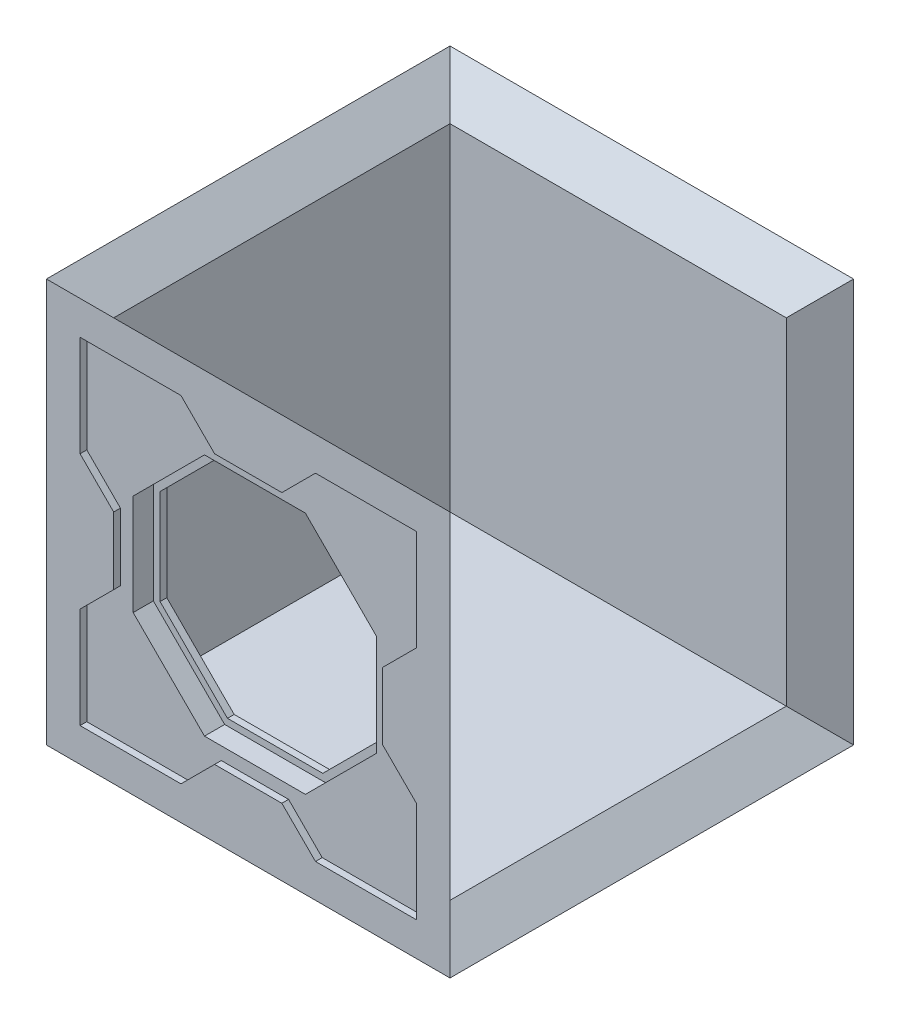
ISO-10303-21;
HEADER;
FILE_DESCRIPTION(('STEP AP214'),'2;1');
FILE_NAME('part.step','',(''),(''),'','','');
FILE_SCHEMA(('AUTOMOTIVE_DESIGN { 1 0 10303 214 1 1 1 1 }'));
ENDSEC;
DATA;
#1=APPLICATION_CONTEXT('core data for automotive mechanical design processes');
#2=APPLICATION_PROTOCOL_DEFINITION('international standard','automotive_design',2000,#1);
#3=PRODUCT_CONTEXT('',#1,'mechanical');
#4=PRODUCT('Part','Part','',(#3));
#5=PRODUCT_RELATED_PRODUCT_CATEGORY('part','',(#4));
#6=PRODUCT_DEFINITION_FORMATION('','',#4);
#7=PRODUCT_DEFINITION_CONTEXT('part definition',#1,'design');
#8=PRODUCT_DEFINITION('design','',#6,#7);
#9=PRODUCT_DEFINITION_SHAPE('','',#8);
#10=(LENGTH_UNIT() NAMED_UNIT(*) SI_UNIT(.MILLI.,.METRE.));
#11=(NAMED_UNIT(*) PLANE_ANGLE_UNIT() SI_UNIT($,.RADIAN.));
#12=(NAMED_UNIT(*) SI_UNIT($,.STERADIAN.) SOLID_ANGLE_UNIT());
#13=UNCERTAINTY_MEASURE_WITH_UNIT(LENGTH_MEASURE(1.E-05),#10,'distance_accuracy_value','');
#14=(GEOMETRIC_REPRESENTATION_CONTEXT(3) GLOBAL_UNCERTAINTY_ASSIGNED_CONTEXT((#13)) GLOBAL_UNIT_ASSIGNED_CONTEXT((#10,
#11,#12)) REPRESENTATION_CONTEXT('',''));
#15=CARTESIAN_POINT('',(0.,0.,0.));
#16=DIRECTION('',(0.,0.,1.));
#17=DIRECTION('',(1.,0.,0.));
#18=AXIS2_PLACEMENT_3D('',#15,#16,#17);
#19=CARTESIAN_POINT('',(10.,120.,-9.99999999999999));
#20=DIRECTION('',(0.,0.,1.));
#21=DIRECTION('',(1.,0.,0.));
#22=AXIS2_PLACEMENT_3D('',#19,#20,#21);
#23=PLANE('',#22);
#24=DIRECTION('',(0.,1.,0.));
#25=VECTOR('',#24,1.);
#26=CARTESIAN_POINT('',(25.7867965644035,45.8284271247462,-9.99999999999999));
#27=LINE('',#26,#25);
#28=CARTESIAN_POINT('',(25.7867965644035,45.8284271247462,-9.99999999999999));
#29=VERTEX_POINT('',#28);
#30=CARTESIAN_POINT('',(25.7867965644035,74.1715728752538,-9.99999999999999));
#31=VERTEX_POINT('',#30);
#32=EDGE_CURVE('E676',#29,#31,#27,.T.);
#33=ORIENTED_EDGE('',*,*,#32,.F.);
#34=DIRECTION('',(-0.707106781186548,0.707106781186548,0.));
#35=VECTOR('',#34,1.);
#36=CARTESIAN_POINT('',(45.8284271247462,25.7867965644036,-9.99999999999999));
#37=LINE('',#36,#35);
#38=CARTESIAN_POINT('',(45.8284271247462,25.7867965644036,-9.99999999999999));
#39=VERTEX_POINT('',#38);
#40=EDGE_CURVE('E679',#39,#29,#37,.T.);
#41=ORIENTED_EDGE('',*,*,#40,.F.);
#42=DIRECTION('',(-1.,0.,0.));
#43=VECTOR('',#42,1.);
#44=CARTESIAN_POINT('',(74.1715728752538,25.7867965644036,-9.99999999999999));
#45=LINE('',#44,#43);
#46=CARTESIAN_POINT('',(74.1715728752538,25.7867965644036,-9.99999999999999));
#47=VERTEX_POINT('',#46);
#48=EDGE_CURVE('E706',#47,#39,#45,.T.);
#49=ORIENTED_EDGE('',*,*,#48,.F.);
#50=DIRECTION('',(-0.707106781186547,-0.707106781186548,0.));
#51=VECTOR('',#50,1.);
#52=CARTESIAN_POINT('',(94.2132034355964,45.8284271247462,-9.99999999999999));
#53=LINE('',#52,#51);
#54=CARTESIAN_POINT('',(94.2132034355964,45.8284271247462,-9.99999999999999));
#55=VERTEX_POINT('',#54);
#56=EDGE_CURVE('E704',#55,#47,#53,.T.);
#57=ORIENTED_EDGE('',*,*,#56,.F.);
#58=DIRECTION('',(0.,-1.,0.));
#59=VECTOR('',#58,1.);
#60=CARTESIAN_POINT('',(94.2132034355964,74.1715728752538,-9.99999999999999));
#61=LINE('',#60,#59);
#62=CARTESIAN_POINT('',(94.2132034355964,74.1715728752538,-9.99999999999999));
#63=VERTEX_POINT('',#62);
#64=EDGE_CURVE('E701',#63,#55,#61,.T.);
#65=ORIENTED_EDGE('',*,*,#64,.F.);
#66=DIRECTION('',(0.707106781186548,-0.707106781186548,0.));
#67=VECTOR('',#66,1.);
#68=CARTESIAN_POINT('',(74.1715728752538,94.2132034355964,-9.99999999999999));
#69=LINE('',#68,#67);
#70=CARTESIAN_POINT('',(74.1715728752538,94.2132034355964,-9.99999999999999));
#71=VERTEX_POINT('',#70);
#72=EDGE_CURVE('E698',#71,#63,#69,.T.);
#73=ORIENTED_EDGE('',*,*,#72,.F.);
#74=DIRECTION('',(1.,0.,0.));
#75=VECTOR('',#74,1.);
#76=CARTESIAN_POINT('',(45.8284271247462,94.2132034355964,-9.99999999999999));
#77=LINE('',#76,#75);
#78=CARTESIAN_POINT('',(45.8284271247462,94.2132034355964,-9.99999999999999));
#79=VERTEX_POINT('',#78);
#80=EDGE_CURVE('E696',#79,#71,#77,.T.);
#81=ORIENTED_EDGE('',*,*,#80,.F.);
#82=DIRECTION('',(0.707106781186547,0.707106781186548,0.));
#83=VECTOR('',#82,1.);
#84=CARTESIAN_POINT('',(25.7867965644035,74.1715728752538,-9.99999999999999));
#85=LINE('',#84,#83);
#86=EDGE_CURVE('E658',#31,#79,#85,.T.);
#87=ORIENTED_EDGE('',*,*,#86,.F.);
#88=EDGE_LOOP('',(#33,#41,#49,#57,#65,#73,#81,#87));
#89=FACE_BOUND('',#88,.T.);
#90=DIRECTION('',(-1.,0.,0.));
#91=VECTOR('',#90,1.);
#92=CARTESIAN_POINT('',(10.,10.,-9.99999999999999));
#93=LINE('',#92,#91);
#94=CARTESIAN_POINT('',(110.,10.,-9.99999999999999));
#95=VERTEX_POINT('',#94);
#96=CARTESIAN_POINT('',(10.,10.,-9.99999999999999));
#97=VERTEX_POINT('',#96);
#98=EDGE_CURVE('E1406',#95,#97,#93,.T.);
#99=ORIENTED_EDGE('',*,*,#98,.T.);
#100=DIRECTION('',(0.,-1.,0.));
#101=VECTOR('',#100,1.);
#102=CARTESIAN_POINT('',(10.,120.,-9.99999999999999));
#103=LINE('',#102,#101);
#104=CARTESIAN_POINT('',(10.,110.,-9.99999999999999));
#105=VERTEX_POINT('',#104);
#106=EDGE_CURVE('E1414',#105,#97,#103,.T.);
#107=ORIENTED_EDGE('',*,*,#106,.F.);
#108=DIRECTION('',(1.,0.,0.));
#109=VECTOR('',#108,1.);
#110=CARTESIAN_POINT('',(10.,110.,-9.99999999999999));
#111=LINE('',#110,#109);
#112=CARTESIAN_POINT('',(110.,110.,-9.99999999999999));
#113=VERTEX_POINT('',#112);
#114=EDGE_CURVE('E1437',#105,#113,#111,.T.);
#115=ORIENTED_EDGE('',*,*,#114,.T.);
#116=DIRECTION('',(0.,-1.,0.));
#117=VECTOR('',#116,1.);
#118=CARTESIAN_POINT('',(110.,120.,-9.99999999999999));
#119=LINE('',#118,#117);
#120=EDGE_CURVE('E1439',#113,#95,#119,.T.);
#121=ORIENTED_EDGE('',*,*,#120,.T.);
#122=EDGE_LOOP('',(#99,#107,#115,#121));
#123=FACE_BOUND('',#122,.T.);
#124=ADVANCED_FACE('F33',(#89,#123),#23,.F.);
#125=CARTESIAN_POINT('',(120.,120.,-110.));
#126=DIRECTION('',(0.,0.,-1.));
#127=DIRECTION('',(-1.,0.,0.));
#128=AXIS2_PLACEMENT_3D('',#125,#126,#127);
#129=PLANE('',#128);
#130=DIRECTION('',(0.,1.,0.));
#131=VECTOR('',#130,1.);
#132=CARTESIAN_POINT('',(110.,120.,-110.));
#133=LINE('',#132,#131);
#134=CARTESIAN_POINT('',(110.,10.,-110.));
#135=VERTEX_POINT('',#134);
#136=CARTESIAN_POINT('',(110.,110.,-110.));
#137=VERTEX_POINT('',#136);
#138=EDGE_CURVE('E42',#135,#137,#133,.T.);
#139=ORIENTED_EDGE('',*,*,#138,.T.);
#140=DIRECTION('',(-1.,0.,0.));
#141=VECTOR('',#140,1.);
#142=CARTESIAN_POINT('',(120.,110.,-110.));
#143=LINE('',#142,#141);
#144=CARTESIAN_POINT('',(9.99999999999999,110.,-110.));
#145=VERTEX_POINT('',#144);
#146=EDGE_CURVE('E1444',#137,#145,#143,.T.);
#147=ORIENTED_EDGE('',*,*,#146,.T.);
#148=DIRECTION('',(0.,-1.,0.));
#149=VECTOR('',#148,1.);
#150=CARTESIAN_POINT('',(9.99999999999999,120.,-110.));
#151=LINE('',#150,#149);
#152=CARTESIAN_POINT('',(9.99999999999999,10.,-110.));
#153=VERTEX_POINT('',#152);
#154=EDGE_CURVE('E1405',#145,#153,#151,.T.);
#155=ORIENTED_EDGE('',*,*,#154,.T.);
#156=DIRECTION('',(1.,0.,0.));
#157=VECTOR('',#156,1.);
#158=CARTESIAN_POINT('',(120.,10.,-110.));
#159=LINE('',#158,#157);
#160=EDGE_CURVE('E1399',#153,#135,#159,.T.);
#161=ORIENTED_EDGE('',*,*,#160,.T.);
#162=EDGE_LOOP('',(#139,#147,#155,#161));
#163=FACE_BOUND('',#162,.T.);
#164=ADVANCED_FACE('F1495',(#163),#129,.F.);
#165=CARTESIAN_POINT('',(0.,10.,0.));
#166=DIRECTION('',(0.,-1.,0.));
#167=DIRECTION('',(0.,0.,-1.));
#168=AXIS2_PLACEMENT_3D('',#165,#166,#167);
#169=PLANE('',#168);
#170=DIRECTION('',(0.,0.,-1.));
#171=VECTOR('',#170,1.);
#172=CARTESIAN_POINT('',(9.99999999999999,10.,-110.));
#173=LINE('',#172,#171);
#174=EDGE_CURVE('E1409',#97,#153,#173,.T.);
#175=ORIENTED_EDGE('',*,*,#174,.F.);
#176=ORIENTED_EDGE('',*,*,#98,.F.);
#177=DIRECTION('',(0.,0.,-1.));
#178=VECTOR('',#177,1.);
#179=CARTESIAN_POINT('',(110.,10.,0.));
#180=LINE('',#179,#178);
#181=EDGE_CURVE('E1441',#95,#135,#180,.T.);
#182=ORIENTED_EDGE('',*,*,#181,.T.);
#183=ORIENTED_EDGE('',*,*,#160,.F.);
#184=EDGE_LOOP('',(#175,#176,#182,#183));
#185=FACE_BOUND('',#184,.T.);
#186=ADVANCED_FACE('F1497',(#185),#169,.F.);
#187=CARTESIAN_POINT('',(0.,10.,0.));
#188=DIRECTION('',(1.,0.,0.));
#189=DIRECTION('',(0.,0.,-1.));
#190=AXIS2_PLACEMENT_3D('',#187,#188,#189);
#191=PLANE('',#190);
#192=DIRECTION('',(0.,-0.707106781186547,0.707106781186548));
#193=VECTOR('',#192,1.);
#194=CARTESIAN_POINT('',(0.,80.,-110.));
#195=LINE('',#194,#193);
#196=CARTESIAN_POINT('',(0.,80.,-110.));
#197=VERTEX_POINT('',#196);
#198=CARTESIAN_POINT('',(0.,69.9999999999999,-99.9999999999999));
#199=VERTEX_POINT('',#198);
#200=EDGE_CURVE('E1114',#197,#199,#195,.T.);
#201=ORIENTED_EDGE('',*,*,#200,.F.);
#202=DIRECTION('',(0.,-1.,0.));
#203=VECTOR('',#202,1.);
#204=CARTESIAN_POINT('',(0.,110.,-110.));
#205=LINE('',#204,#203);
#206=CARTESIAN_POINT('',(0.,110.,-110.));
#207=VERTEX_POINT('',#206);
#208=EDGE_CURVE('E1036',#207,#197,#205,.T.);
#209=ORIENTED_EDGE('',*,*,#208,.F.);
#210=DIRECTION('',(0.,0.,-1.));
#211=VECTOR('',#210,1.);
#212=CARTESIAN_POINT('',(0.,110.,-110.));
#213=LINE('',#212,#211);
#214=CARTESIAN_POINT('',(0.,110.,-80.));
#215=VERTEX_POINT('',#214);
#216=EDGE_CURVE('E1055',#215,#207,#213,.T.);
#217=ORIENTED_EDGE('',*,*,#216,.F.);
#218=DIRECTION('',(0.,0.707106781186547,-0.707106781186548));
#219=VECTOR('',#218,1.);
#220=CARTESIAN_POINT('',(0.,110.,-80.));
#221=LINE('',#220,#219);
#222=CARTESIAN_POINT('',(0.,100.,-70.));
#223=VERTEX_POINT('',#222);
#224=EDGE_CURVE('E1165',#223,#215,#221,.T.);
#225=ORIENTED_EDGE('',*,*,#224,.F.);
#226=DIRECTION('',(0.,0.,-1.));
#227=VECTOR('',#226,1.);
#228=CARTESIAN_POINT('',(0.,100.,-70.));
#229=LINE('',#228,#227);
#230=CARTESIAN_POINT('',(0.,99.9999999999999,-50.));
#231=VERTEX_POINT('',#230);
#232=EDGE_CURVE('E1162',#231,#223,#229,.T.);
#233=ORIENTED_EDGE('',*,*,#232,.F.);
#234=DIRECTION('',(0.,-0.707106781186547,-0.707106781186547));
#235=VECTOR('',#234,1.);
#236=CARTESIAN_POINT('',(0.,99.9999999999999,-50.));
#237=LINE('',#236,#235);
#238=CARTESIAN_POINT('',(0.,110.,-40.));
#239=VERTEX_POINT('',#238);
#240=EDGE_CURVE('E1159',#239,#231,#237,.T.);
#241=ORIENTED_EDGE('',*,*,#240,.F.);
#242=DIRECTION('',(0.,0.,-1.));
#243=VECTOR('',#242,1.);
#244=CARTESIAN_POINT('',(0.,110.,-40.));
#245=LINE('',#244,#243);
#246=CARTESIAN_POINT('',(0.,110.,-9.99999999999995));
#247=VERTEX_POINT('',#246);
#248=EDGE_CURVE('E1156',#247,#239,#245,.T.);
#249=ORIENTED_EDGE('',*,*,#248,.F.);
#250=DIRECTION('',(0.,1.,0.));
#251=VECTOR('',#250,1.);
#252=CARTESIAN_POINT('',(0.,79.9999999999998,-9.99999999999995));
#253=LINE('',#252,#251);
#254=CARTESIAN_POINT('',(0.,79.9999999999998,-9.99999999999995));
#255=VERTEX_POINT('',#254);
#256=EDGE_CURVE('E1153',#255,#247,#253,.T.);
#257=ORIENTED_EDGE('',*,*,#256,.F.);
#258=DIRECTION('',(0.,0.707106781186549,0.707106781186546));
#259=VECTOR('',#258,1.);
#260=CARTESIAN_POINT('',(0.,69.9999999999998,-19.9999999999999));
#261=LINE('',#260,#259);
#262=CARTESIAN_POINT('',(0.,69.9999999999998,-19.9999999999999));
#263=VERTEX_POINT('',#262);
#264=EDGE_CURVE('E1150',#263,#255,#261,.T.);
#265=ORIENTED_EDGE('',*,*,#264,.F.);
#266=DIRECTION('',(0.,1.,0.));
#267=VECTOR('',#266,1.);
#268=CARTESIAN_POINT('',(0.,49.9999999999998,-19.9999999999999));
#269=LINE('',#268,#267);
#270=CARTESIAN_POINT('',(0.,49.9999999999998,-19.9999999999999));
#271=VERTEX_POINT('',#270);
#272=EDGE_CURVE('E1147',#271,#263,#269,.T.);
#273=ORIENTED_EDGE('',*,*,#272,.F.);
#274=DIRECTION('',(0.,0.707106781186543,-0.707106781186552));
#275=VECTOR('',#274,1.);
#276=CARTESIAN_POINT('',(0.,40.,-9.99999999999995));
#277=LINE('',#276,#275);
#278=CARTESIAN_POINT('',(0.,40.,-9.99999999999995));
#279=VERTEX_POINT('',#278);
#280=EDGE_CURVE('E1144',#279,#271,#277,.T.);
#281=ORIENTED_EDGE('',*,*,#280,.F.);
#282=DIRECTION('',(0.,1.,0.));
#283=VECTOR('',#282,1.);
#284=CARTESIAN_POINT('',(0.,9.99999999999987,-9.9999999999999));
#285=LINE('',#284,#283);
#286=CARTESIAN_POINT('',(0.,9.99999999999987,-9.9999999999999));
#287=VERTEX_POINT('',#286);
#288=EDGE_CURVE('E1141',#287,#279,#285,.T.);
#289=ORIENTED_EDGE('',*,*,#288,.F.);
#290=DIRECTION('',(0.,0.,1.));
#291=VECTOR('',#290,1.);
#292=CARTESIAN_POINT('',(0.,9.99999999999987,-39.9999999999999));
#293=LINE('',#292,#291);
#294=CARTESIAN_POINT('',(0.,9.99999999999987,-39.9999999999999));
#295=VERTEX_POINT('',#294);
#296=EDGE_CURVE('E1138',#295,#287,#293,.T.);
#297=ORIENTED_EDGE('',*,*,#296,.F.);
#298=DIRECTION('',(0.,-0.707106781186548,0.707106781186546));
#299=VECTOR('',#298,1.);
#300=CARTESIAN_POINT('',(0.,19.9999999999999,-50.));
#301=LINE('',#300,#299);
#302=CARTESIAN_POINT('',(0.,19.9999999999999,-50.));
#303=VERTEX_POINT('',#302);
#304=EDGE_CURVE('E1135',#303,#295,#301,.T.);
#305=ORIENTED_EDGE('',*,*,#304,.F.);
#306=DIRECTION('',(0.,0.,1.));
#307=VECTOR('',#306,1.);
#308=CARTESIAN_POINT('',(0.,19.9999999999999,-70.));
#309=LINE('',#308,#307);
#310=CARTESIAN_POINT('',(0.,19.9999999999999,-70.));
#311=VERTEX_POINT('',#310);
#312=EDGE_CURVE('E1132',#311,#303,#309,.T.);
#313=ORIENTED_EDGE('',*,*,#312,.F.);
#314=DIRECTION('',(0.,0.707106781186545,0.70710678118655));
#315=VECTOR('',#314,1.);
#316=CARTESIAN_POINT('',(0.,10.,-80.));
#317=LINE('',#316,#315);
#318=CARTESIAN_POINT('',(0.,10.,-80.));
#319=VERTEX_POINT('',#318);
#320=EDGE_CURVE('E1129',#319,#311,#317,.T.);
#321=ORIENTED_EDGE('',*,*,#320,.F.);
#322=DIRECTION('',(0.,0.,1.));
#323=VECTOR('',#322,1.);
#324=CARTESIAN_POINT('',(0.,10.,-110.));
#325=LINE('',#324,#323);
#326=CARTESIAN_POINT('',(0.,10.,-110.));
#327=VERTEX_POINT('',#326);
#328=EDGE_CURVE('E1126',#327,#319,#325,.T.);
#329=ORIENTED_EDGE('',*,*,#328,.F.);
#330=DIRECTION('',(0.,-1.,0.));
#331=VECTOR('',#330,1.);
#332=CARTESIAN_POINT('',(0.,40.,-110.));
#333=LINE('',#332,#331);
#334=CARTESIAN_POINT('',(0.,40.,-110.));
#335=VERTEX_POINT('',#334);
#336=EDGE_CURVE('E1123',#335,#327,#333,.T.);
#337=ORIENTED_EDGE('',*,*,#336,.F.);
#338=DIRECTION('',(0.,-0.707106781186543,-0.707106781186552));
#339=VECTOR('',#338,1.);
#340=CARTESIAN_POINT('',(0.,50.,-99.9999999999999));
#341=LINE('',#340,#339);
#342=CARTESIAN_POINT('',(0.,50.,-99.9999999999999));
#343=VERTEX_POINT('',#342);
#344=EDGE_CURVE('E1120',#343,#335,#341,.T.);
#345=ORIENTED_EDGE('',*,*,#344,.F.);
#346=DIRECTION('',(0.,-1.,0.));
#347=VECTOR('',#346,1.);
#348=CARTESIAN_POINT('',(0.,69.9999999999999,-99.9999999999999));
#349=LINE('',#348,#347);
#350=EDGE_CURVE('E1117',#199,#343,#349,.T.);
#351=ORIENTED_EDGE('',*,*,#350,.F.);
#352=EDGE_LOOP('',(#201,#209,#217,#225,#233,#241,#249,#257,#265,#273,#281,#289,#297,#305,#313,
#321,#329,#337,#345,#351));
#353=FACE_BOUND('',#352,.T.);
#354=DIRECTION('',(0.,0.,1.));
#355=VECTOR('',#354,1.);
#356=CARTESIAN_POINT('',(0.,0.,0.));
#357=LINE('',#356,#355);
#358=CARTESIAN_POINT('',(0.,0.,-120.));
#359=VERTEX_POINT('',#358);
#360=CARTESIAN_POINT('',(0.,0.,0.));
#361=VERTEX_POINT('',#360);
#362=EDGE_CURVE('E1416',#359,#361,#357,.T.);
#363=ORIENTED_EDGE('',*,*,#362,.T.);
#364=DIRECTION('',(0.,-1.,0.));
#365=VECTOR('',#364,1.);
#366=CARTESIAN_POINT('',(0.,10.,0.));
#367=LINE('',#366,#365);
#368=CARTESIAN_POINT('',(0.,120.,0.));
#369=VERTEX_POINT('',#368);
#370=EDGE_CURVE('E1434',#369,#361,#367,.T.);
#371=ORIENTED_EDGE('',*,*,#370,.F.);
#372=DIRECTION('',(0.,0.,1.));
#373=VECTOR('',#372,1.);
#374=CARTESIAN_POINT('',(0.,120.,0.));
#375=LINE('',#374,#373);
#376=CARTESIAN_POINT('',(0.,120.,-120.));
#377=VERTEX_POINT('',#376);
#378=EDGE_CURVE('E1395',#377,#369,#375,.T.);
#379=ORIENTED_EDGE('',*,*,#378,.F.);
#380=DIRECTION('',(0.,-1.,0.));
#381=VECTOR('',#380,1.);
#382=CARTESIAN_POINT('',(0.,10.,-120.));
#383=LINE('',#382,#381);
#384=EDGE_CURVE('E1426',#377,#359,#383,.T.);
#385=ORIENTED_EDGE('',*,*,#384,.T.);
#386=EDGE_LOOP('',(#363,#371,#379,#385));
#387=FACE_BOUND('',#386,.T.);
#388=ADVANCED_FACE('F1476',(#353,#387),#191,.F.);
#389=CARTESIAN_POINT('',(0.,10.,0.));
#390=DIRECTION('',(0.,0.,-1.));
#391=DIRECTION('',(-1.,0.,0.));
#392=AXIS2_PLACEMENT_3D('',#389,#390,#391);
#393=PLANE('',#392);
#394=DIRECTION('',(0.707106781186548,-0.707106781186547,0.));
#395=VECTOR('',#394,1.);
#396=CARTESIAN_POINT('',(10.,80.,0.));
#397=LINE('',#396,#395);
#398=CARTESIAN_POINT('',(10.,80.,0.));
#399=VERTEX_POINT('',#398);
#400=CARTESIAN_POINT('',(20.,70.,0.));
#401=VERTEX_POINT('',#400);
#402=EDGE_CURVE('E1298',#399,#401,#397,.T.);
#403=ORIENTED_EDGE('',*,*,#402,.F.);
#404=DIRECTION('',(0.,-1.,0.));
#405=VECTOR('',#404,1.);
#406=CARTESIAN_POINT('',(10.,110.,0.));
#407=LINE('',#406,#405);
#408=CARTESIAN_POINT('',(10.,110.,0.));
#409=VERTEX_POINT('',#408);
#410=EDGE_CURVE('E1234',#409,#399,#407,.T.);
#411=ORIENTED_EDGE('',*,*,#410,.F.);
#412=DIRECTION('',(-1.,0.,0.));
#413=VECTOR('',#412,1.);
#414=CARTESIAN_POINT('',(10.,110.,0.));
#415=LINE('',#414,#413);
#416=CARTESIAN_POINT('',(40.,110.,0.));
#417=VERTEX_POINT('',#416);
#418=EDGE_CURVE('E1239',#417,#409,#415,.T.);
#419=ORIENTED_EDGE('',*,*,#418,.F.);
#420=DIRECTION('',(-0.707106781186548,0.707106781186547,0.));
#421=VECTOR('',#420,1.);
#422=CARTESIAN_POINT('',(40.,110.,0.));
#423=LINE('',#422,#421);
#424=CARTESIAN_POINT('',(50.,100.,0.));
#425=VERTEX_POINT('',#424);
#426=EDGE_CURVE('E1349',#425,#417,#423,.T.);
#427=ORIENTED_EDGE('',*,*,#426,.F.);
#428=DIRECTION('',(-1.,0.,0.));
#429=VECTOR('',#428,1.);
#430=CARTESIAN_POINT('',(50.,100.,0.));
#431=LINE('',#430,#429);
#432=CARTESIAN_POINT('',(70.,100.,0.));
#433=VERTEX_POINT('',#432);
#434=EDGE_CURVE('E1346',#433,#425,#431,.T.);
#435=ORIENTED_EDGE('',*,*,#434,.F.);
#436=DIRECTION('',(-0.707106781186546,-0.707106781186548,0.));
#437=VECTOR('',#436,1.);
#438=CARTESIAN_POINT('',(70.,100.,0.));
#439=LINE('',#438,#437);
#440=CARTESIAN_POINT('',(80.,110.,0.));
#441=VERTEX_POINT('',#440);
#442=EDGE_CURVE('E1343',#441,#433,#439,.T.);
#443=ORIENTED_EDGE('',*,*,#442,.F.);
#444=DIRECTION('',(-1.,0.,0.));
#445=VECTOR('',#444,1.);
#446=CARTESIAN_POINT('',(80.,110.,0.));
#447=LINE('',#446,#445);
#448=CARTESIAN_POINT('',(110.,110.,0.));
#449=VERTEX_POINT('',#448);
#450=EDGE_CURVE('E1340',#449,#441,#447,.T.);
#451=ORIENTED_EDGE('',*,*,#450,.F.);
#452=DIRECTION('',(0.,1.,0.));
#453=VECTOR('',#452,1.);
#454=CARTESIAN_POINT('',(110.,79.9999999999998,0.));
#455=LINE('',#454,#453);
#456=CARTESIAN_POINT('',(110.,79.9999999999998,0.));
#457=VERTEX_POINT('',#456);
#458=EDGE_CURVE('E1337',#457,#449,#455,.T.);
#459=ORIENTED_EDGE('',*,*,#458,.F.);
#460=DIRECTION('',(0.707106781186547,0.707106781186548,0.));
#461=VECTOR('',#460,1.);
#462=CARTESIAN_POINT('',(100.,69.9999999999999,0.));
#463=LINE('',#462,#461);
#464=CARTESIAN_POINT('',(100.,69.9999999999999,0.));
#465=VERTEX_POINT('',#464);
#466=EDGE_CURVE('E1334',#465,#457,#463,.T.);
#467=ORIENTED_EDGE('',*,*,#466,.F.);
#468=DIRECTION('',(0.,1.,0.));
#469=VECTOR('',#468,1.);
#470=CARTESIAN_POINT('',(100.,49.9999999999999,0.));
#471=LINE('',#470,#469);
#472=CARTESIAN_POINT('',(100.,49.9999999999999,0.));
#473=VERTEX_POINT('',#472);
#474=EDGE_CURVE('E1331',#473,#465,#471,.T.);
#475=ORIENTED_EDGE('',*,*,#474,.F.);
#476=DIRECTION('',(-0.707106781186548,0.707106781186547,0.));
#477=VECTOR('',#476,1.);
#478=CARTESIAN_POINT('',(110.,39.9999999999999,0.));
#479=LINE('',#478,#477);
#480=CARTESIAN_POINT('',(110.,39.9999999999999,0.));
#481=VERTEX_POINT('',#480);
#482=EDGE_CURVE('E1328',#481,#473,#479,.T.);
#483=ORIENTED_EDGE('',*,*,#482,.F.);
#484=DIRECTION('',(0.,1.,0.));
#485=VECTOR('',#484,1.);
#486=CARTESIAN_POINT('',(110.,9.99999999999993,0.));
#487=LINE('',#486,#485);
#488=CARTESIAN_POINT('',(110.,9.99999999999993,0.));
#489=VERTEX_POINT('',#488);
#490=EDGE_CURVE('E1325',#489,#481,#487,.T.);
#491=ORIENTED_EDGE('',*,*,#490,.F.);
#492=DIRECTION('',(1.,0.,0.));
#493=VECTOR('',#492,1.);
#494=CARTESIAN_POINT('',(80.,9.99999999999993,0.));
#495=LINE('',#494,#493);
#496=CARTESIAN_POINT('',(80.,9.99999999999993,0.));
#497=VERTEX_POINT('',#496);
#498=EDGE_CURVE('E1322',#497,#489,#495,.T.);
#499=ORIENTED_EDGE('',*,*,#498,.F.);
#500=DIRECTION('',(0.707106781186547,-0.707106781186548,0.));
#501=VECTOR('',#500,1.);
#502=CARTESIAN_POINT('',(70.,20.,0.));
#503=LINE('',#502,#501);
#504=CARTESIAN_POINT('',(70.,20.,0.));
#505=VERTEX_POINT('',#504);
#506=EDGE_CURVE('E1319',#505,#497,#503,.T.);
#507=ORIENTED_EDGE('',*,*,#506,.F.);
#508=DIRECTION('',(1.,0.,0.));
#509=VECTOR('',#508,1.);
#510=CARTESIAN_POINT('',(50.,20.,0.));
#511=LINE('',#510,#509);
#512=CARTESIAN_POINT('',(50.,20.,0.));
#513=VERTEX_POINT('',#512);
#514=EDGE_CURVE('E1316',#513,#505,#511,.T.);
#515=ORIENTED_EDGE('',*,*,#514,.F.);
#516=DIRECTION('',(0.707106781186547,0.707106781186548,0.));
#517=VECTOR('',#516,1.);
#518=CARTESIAN_POINT('',(40.,10.,0.));
#519=LINE('',#518,#517);
#520=CARTESIAN_POINT('',(40.,10.,0.));
#521=VERTEX_POINT('',#520);
#522=EDGE_CURVE('E1313',#521,#513,#519,.T.);
#523=ORIENTED_EDGE('',*,*,#522,.F.);
#524=DIRECTION('',(1.,0.,0.));
#525=VECTOR('',#524,1.);
#526=CARTESIAN_POINT('',(10.,10.,0.));
#527=LINE('',#526,#525);
#528=CARTESIAN_POINT('',(10.,10.,0.));
#529=VERTEX_POINT('',#528);
#530=EDGE_CURVE('E1310',#529,#521,#527,.T.);
#531=ORIENTED_EDGE('',*,*,#530,.F.);
#532=DIRECTION('',(0.,-1.,0.));
#533=VECTOR('',#532,1.);
#534=CARTESIAN_POINT('',(10.,40.,0.));
#535=LINE('',#534,#533);
#536=CARTESIAN_POINT('',(10.,40.,0.));
#537=VERTEX_POINT('',#536);
#538=EDGE_CURVE('E1307',#537,#529,#535,.T.);
#539=ORIENTED_EDGE('',*,*,#538,.F.);
#540=DIRECTION('',(-0.707106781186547,-0.707106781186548,0.));
#541=VECTOR('',#540,1.);
#542=CARTESIAN_POINT('',(20.,50.,0.));
#543=LINE('',#542,#541);
#544=CARTESIAN_POINT('',(20.,50.,0.));
#545=VERTEX_POINT('',#544);
#546=EDGE_CURVE('E1304',#545,#537,#543,.T.);
#547=ORIENTED_EDGE('',*,*,#546,.F.);
#548=DIRECTION('',(0.,-1.,0.));
#549=VECTOR('',#548,1.);
#550=CARTESIAN_POINT('',(20.,70.,0.));
#551=LINE('',#550,#549);
#552=EDGE_CURVE('E1301',#401,#545,#551,.T.);
#553=ORIENTED_EDGE('',*,*,#552,.F.);
#554=EDGE_LOOP('',(#403,#411,#419,#427,#435,#443,#451,#459,#467,#475,#483,#491,#499,#507,#515,
#523,#531,#539,#547,#553));
#555=FACE_BOUND('',#554,.T.);
#556=DIRECTION('',(1.,0.,0.));
#557=VECTOR('',#556,1.);
#558=CARTESIAN_POINT('',(0.,0.,0.));
#559=LINE('',#558,#557);
#560=CARTESIAN_POINT('',(120.,0.,0.));
#561=VERTEX_POINT('',#560);
#562=EDGE_CURVE('E1419',#361,#561,#559,.T.);
#563=ORIENTED_EDGE('',*,*,#562,.T.);
#564=DIRECTION('',(0.,-1.,0.));
#565=VECTOR('',#564,1.);
#566=CARTESIAN_POINT('',(120.,10.,0.));
#567=LINE('',#566,#565);
#568=CARTESIAN_POINT('',(120.,120.,0.));
#569=VERTEX_POINT('',#568);
#570=EDGE_CURVE('E1431',#569,#561,#567,.T.);
#571=ORIENTED_EDGE('',*,*,#570,.F.);
#572=DIRECTION('',(1.,0.,0.));
#573=VECTOR('',#572,1.);
#574=CARTESIAN_POINT('',(120.,120.,0.));
#575=LINE('',#574,#573);
#576=EDGE_CURVE('E1398',#369,#569,#575,.T.);
#577=ORIENTED_EDGE('',*,*,#576,.F.);
#578=ORIENTED_EDGE('',*,*,#370,.T.);
#579=EDGE_LOOP('',(#563,#571,#577,#578));
#580=FACE_BOUND('',#579,.T.);
#581=ADVANCED_FACE('F1480',(#555,#580),#393,.F.);
#582=CARTESIAN_POINT('',(0.,10.,-120.));
#583=DIRECTION('',(0.,0.,1.));
#584=DIRECTION('',(1.,0.,0.));
#585=AXIS2_PLACEMENT_3D('',#582,#583,#584);
#586=PLANE('',#585);
#587=DIRECTION('',(-0.707106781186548,-0.707106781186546,0.));
#588=VECTOR('',#587,1.);
#589=CARTESIAN_POINT('',(110.,80.,-120.));
#590=LINE('',#589,#588);
#591=CARTESIAN_POINT('',(110.,79.9999999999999,-120.));
#592=VERTEX_POINT('',#591);
#593=CARTESIAN_POINT('',(100.,70.,-120.));
#594=VERTEX_POINT('',#593);
#595=EDGE_CURVE('E890',#592,#594,#590,.T.);
#596=ORIENTED_EDGE('',*,*,#595,.F.);
#597=DIRECTION('',(0.,-1.,0.));
#598=VECTOR('',#597,1.);
#599=CARTESIAN_POINT('',(110.,110.,-120.));
#600=LINE('',#599,#598);
#601=CARTESIAN_POINT('',(110.,110.,-120.));
#602=VERTEX_POINT('',#601);
#603=EDGE_CURVE('E58',#602,#592,#600,.T.);
#604=ORIENTED_EDGE('',*,*,#603,.F.);
#605=DIRECTION('',(1.,0.,0.));
#606=VECTOR('',#605,1.);
#607=CARTESIAN_POINT('',(110.,110.,-120.));
#608=LINE('',#607,#606);
#609=CARTESIAN_POINT('',(80.,110.,-120.));
#610=VERTEX_POINT('',#609);
#611=EDGE_CURVE('E831',#610,#602,#608,.T.);
#612=ORIENTED_EDGE('',*,*,#611,.F.);
#613=DIRECTION('',(0.707106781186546,0.707106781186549,0.));
#614=VECTOR('',#613,1.);
#615=CARTESIAN_POINT('',(80.,110.,-120.));
#616=LINE('',#615,#614);
#617=CARTESIAN_POINT('',(70.0000000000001,100.,-120.));
#618=VERTEX_POINT('',#617);
#619=EDGE_CURVE('E941',#618,#610,#616,.T.);
#620=ORIENTED_EDGE('',*,*,#619,.F.);
#621=DIRECTION('',(1.,0.,0.));
#622=VECTOR('',#621,1.);
#623=CARTESIAN_POINT('',(70.0000000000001,100.,-120.));
#624=LINE('',#623,#622);
#625=CARTESIAN_POINT('',(50.,100.,-120.));
#626=VERTEX_POINT('',#625);
#627=EDGE_CURVE('E938',#626,#618,#624,.T.);
#628=ORIENTED_EDGE('',*,*,#627,.F.);
#629=DIRECTION('',(0.707106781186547,-0.707106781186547,0.));
#630=VECTOR('',#629,1.);
#631=CARTESIAN_POINT('',(50.,100.,-120.));
#632=LINE('',#631,#630);
#633=CARTESIAN_POINT('',(40.,110.,-120.));
#634=VERTEX_POINT('',#633);
#635=EDGE_CURVE('E935',#634,#626,#632,.T.);
#636=ORIENTED_EDGE('',*,*,#635,.F.);
#637=DIRECTION('',(1.,0.,0.));
#638=VECTOR('',#637,1.);
#639=CARTESIAN_POINT('',(40.,110.,-120.));
#640=LINE('',#639,#638);
#641=CARTESIAN_POINT('',(10.,110.,-120.));
#642=VERTEX_POINT('',#641);
#643=EDGE_CURVE('E932',#642,#634,#640,.T.);
#644=ORIENTED_EDGE('',*,*,#643,.F.);
#645=DIRECTION('',(0.,1.,0.));
#646=VECTOR('',#645,1.);
#647=CARTESIAN_POINT('',(10.,79.9999999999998,-120.));
#648=LINE('',#647,#646);
#649=CARTESIAN_POINT('',(10.,79.9999999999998,-120.));
#650=VERTEX_POINT('',#649);
#651=EDGE_CURVE('E929',#650,#642,#648,.T.);
#652=ORIENTED_EDGE('',*,*,#651,.F.);
#653=DIRECTION('',(-0.707106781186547,0.707106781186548,0.));
#654=VECTOR('',#653,1.);
#655=CARTESIAN_POINT('',(20.,69.9999999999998,-120.));
#656=LINE('',#655,#654);
#657=CARTESIAN_POINT('',(20.,69.9999999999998,-120.));
#658=VERTEX_POINT('',#657);
#659=EDGE_CURVE('E926',#658,#650,#656,.T.);
#660=ORIENTED_EDGE('',*,*,#659,.F.);
#661=DIRECTION('',(0.,1.,0.));
#662=VECTOR('',#661,1.);
#663=CARTESIAN_POINT('',(20.,49.9999999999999,-120.));
#664=LINE('',#663,#662);
#665=CARTESIAN_POINT('',(20.,49.9999999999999,-120.));
#666=VERTEX_POINT('',#665);
#667=EDGE_CURVE('E923',#666,#658,#664,.T.);
#668=ORIENTED_EDGE('',*,*,#667,.F.);
#669=DIRECTION('',(0.707106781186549,0.707106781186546,0.));
#670=VECTOR('',#669,1.);
#671=CARTESIAN_POINT('',(9.99999999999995,39.9999999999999,-120.));
#672=LINE('',#671,#670);
#673=CARTESIAN_POINT('',(9.99999999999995,39.9999999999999,-120.));
#674=VERTEX_POINT('',#673);
#675=EDGE_CURVE('E920',#674,#666,#672,.T.);
#676=ORIENTED_EDGE('',*,*,#675,.F.);
#677=DIRECTION('',(0.,1.,0.));
#678=VECTOR('',#677,1.);
#679=CARTESIAN_POINT('',(9.99999999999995,9.9999999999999,-120.));
#680=LINE('',#679,#678);
#681=CARTESIAN_POINT('',(9.99999999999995,9.9999999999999,-120.));
#682=VERTEX_POINT('',#681);
#683=EDGE_CURVE('E917',#682,#674,#680,.T.);
#684=ORIENTED_EDGE('',*,*,#683,.F.);
#685=DIRECTION('',(-1.,0.,0.));
#686=VECTOR('',#685,1.);
#687=CARTESIAN_POINT('',(40.,9.9999999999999,-120.));
#688=LINE('',#687,#686);
#689=CARTESIAN_POINT('',(40.,9.9999999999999,-120.));
#690=VERTEX_POINT('',#689);
#691=EDGE_CURVE('E914',#690,#682,#688,.T.);
#692=ORIENTED_EDGE('',*,*,#691,.F.);
#693=DIRECTION('',(-0.707106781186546,-0.707106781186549,0.));
#694=VECTOR('',#693,1.);
#695=CARTESIAN_POINT('',(50.,20.,-120.));
#696=LINE('',#695,#694);
#697=CARTESIAN_POINT('',(50.,20.,-120.));
#698=VERTEX_POINT('',#697);
#699=EDGE_CURVE('E911',#698,#690,#696,.T.);
#700=ORIENTED_EDGE('',*,*,#699,.F.);
#701=DIRECTION('',(-1.,0.,0.));
#702=VECTOR('',#701,1.);
#703=CARTESIAN_POINT('',(70.,20.,-120.));
#704=LINE('',#703,#702);
#705=CARTESIAN_POINT('',(70.,20.,-120.));
#706=VERTEX_POINT('',#705);
#707=EDGE_CURVE('E908',#706,#698,#704,.T.);
#708=ORIENTED_EDGE('',*,*,#707,.F.);
#709=DIRECTION('',(-0.707106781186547,0.707106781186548,0.));
#710=VECTOR('',#709,1.);
#711=CARTESIAN_POINT('',(80.,9.99999999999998,-120.));
#712=LINE('',#711,#710);
#713=CARTESIAN_POINT('',(80.,9.99999999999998,-120.));
#714=VERTEX_POINT('',#713);
#715=EDGE_CURVE('E905',#714,#706,#712,.T.);
#716=ORIENTED_EDGE('',*,*,#715,.F.);
#717=DIRECTION('',(-1.,0.,0.));
#718=VECTOR('',#717,1.);
#719=CARTESIAN_POINT('',(110.,10.,-120.));
#720=LINE('',#719,#718);
#721=CARTESIAN_POINT('',(110.,10.,-120.));
#722=VERTEX_POINT('',#721);
#723=EDGE_CURVE('E902',#722,#714,#720,.T.);
#724=ORIENTED_EDGE('',*,*,#723,.F.);
#725=DIRECTION('',(0.,-1.,0.));
#726=VECTOR('',#725,1.);
#727=CARTESIAN_POINT('',(110.,40.,-120.));
#728=LINE('',#727,#726);
#729=CARTESIAN_POINT('',(110.,40.,-120.));
#730=VERTEX_POINT('',#729);
#731=EDGE_CURVE('E899',#730,#722,#728,.T.);
#732=ORIENTED_EDGE('',*,*,#731,.F.);
#733=DIRECTION('',(0.707106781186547,-0.707106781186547,0.));
#734=VECTOR('',#733,1.);
#735=CARTESIAN_POINT('',(100.,50.,-120.));
#736=LINE('',#735,#734);
#737=CARTESIAN_POINT('',(100.,50.,-120.));
#738=VERTEX_POINT('',#737);
#739=EDGE_CURVE('E896',#738,#730,#736,.T.);
#740=ORIENTED_EDGE('',*,*,#739,.F.);
#741=DIRECTION('',(0.,-1.,0.));
#742=VECTOR('',#741,1.);
#743=CARTESIAN_POINT('',(100.,70.,-120.));
#744=LINE('',#743,#742);
#745=EDGE_CURVE('E893',#594,#738,#744,.T.);
#746=ORIENTED_EDGE('',*,*,#745,.F.);
#747=EDGE_LOOP('',(#596,#604,#612,#620,#628,#636,#644,#652,#660,#668,#676,#684,#692,#700,#708,
#716,#724,#732,#740,#746));
#748=FACE_BOUND('',#747,.T.);
#749=DIRECTION('',(-1.,0.,0.));
#750=VECTOR('',#749,1.);
#751=CARTESIAN_POINT('',(0.,0.,-120.));
#752=LINE('',#751,#750);
#753=CARTESIAN_POINT('',(120.,0.,-120.));
#754=VERTEX_POINT('',#753);
#755=EDGE_CURVE('E1424',#754,#359,#752,.T.);
#756=ORIENTED_EDGE('',*,*,#755,.T.);
#757=ORIENTED_EDGE('',*,*,#384,.F.);
#758=DIRECTION('',(-1.,0.,0.));
#759=VECTOR('',#758,1.);
#760=CARTESIAN_POINT('',(0.,120.,-120.));
#761=LINE('',#760,#759);
#762=CARTESIAN_POINT('',(120.,120.,-120.));
#763=VERTEX_POINT('',#762);
#764=EDGE_CURVE('E1402',#763,#377,#761,.T.);
#765=ORIENTED_EDGE('',*,*,#764,.F.);
#766=DIRECTION('',(0.,-1.,0.));
#767=VECTOR('',#766,1.);
#768=CARTESIAN_POINT('',(120.,10.,-120.));
#769=LINE('',#768,#767);
#770=EDGE_CURVE('E1429',#763,#754,#769,.T.);
#771=ORIENTED_EDGE('',*,*,#770,.T.);
#772=EDGE_LOOP('',(#756,#757,#765,#771));
#773=FACE_BOUND('',#772,.T.);
#774=ADVANCED_FACE('F1472',(#748,#773),#586,.F.);
#775=CARTESIAN_POINT('',(0.,0.,0.));
#776=DIRECTION('',(0.,-1.,0.));
#777=DIRECTION('',(0.,0.,-1.));
#778=AXIS2_PLACEMENT_3D('',#775,#776,#777);
#779=PLANE('',#778);
#780=ORIENTED_EDGE('',*,*,#362,.F.);
#781=ORIENTED_EDGE('',*,*,#755,.F.);
#782=DIRECTION('',(0.,0.,-1.));
#783=VECTOR('',#782,1.);
#784=CARTESIAN_POINT('',(120.,0.,0.));
#785=LINE('',#784,#783);
#786=EDGE_CURVE('E1421',#561,#754,#785,.T.);
#787=ORIENTED_EDGE('',*,*,#786,.F.);
#788=ORIENTED_EDGE('',*,*,#562,.F.);
#789=EDGE_LOOP('',(#780,#781,#787,#788));
#790=FACE_BOUND('',#789,.T.);
#791=ADVANCED_FACE('F1506',(#790),#779,.T.);
#792=CARTESIAN_POINT('',(9.99999999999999,120.,-110.));
#793=DIRECTION('',(-1.,0.,0.));
#794=DIRECTION('',(0.,0.,1.));
#795=AXIS2_PLACEMENT_3D('',#792,#793,#794);
#796=PLANE('',#795);
#797=ORIENTED_EDGE('',*,*,#174,.T.);
#798=ORIENTED_EDGE('',*,*,#154,.F.);
#799=DIRECTION('',(0.,0.,1.));
#800=VECTOR('',#799,1.);
#801=CARTESIAN_POINT('',(9.99999999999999,110.,-110.));
#802=LINE('',#801,#800);
#803=EDGE_CURVE('E11',#145,#105,#802,.T.);
#804=ORIENTED_EDGE('',*,*,#803,.T.);
#805=ORIENTED_EDGE('',*,*,#106,.T.);
#806=EDGE_LOOP('',(#797,#798,#804,#805));
#807=FACE_BOUND('',#806,.T.);
#808=ADVANCED_FACE('F1491',(#807),#796,.F.);
#809=CARTESIAN_POINT('',(0.,120.,-120.));
#810=DIRECTION('',(0.,-0.707106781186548,-0.707106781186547));
#811=DIRECTION('',(1.,0.,0.));
#812=AXIS2_PLACEMENT_3D('',#809,#810,#811);
#813=PLANE('',#812);
#814=DIRECTION('',(0.577350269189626,0.577350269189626,-0.577350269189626));
#815=VECTOR('',#814,1.);
#816=CARTESIAN_POINT('',(80.,80.,-80.));
#817=LINE('',#816,#815);
#818=EDGE_CURVE('E1456',#763,#137,#817,.F.);
#819=ORIENTED_EDGE('',*,*,#818,.F.);
#820=ORIENTED_EDGE('',*,*,#764,.T.);
#821=DIRECTION('',(-0.577350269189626,0.577350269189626,-0.577350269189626));
#822=VECTOR('',#821,1.);
#823=CARTESIAN_POINT('',(0.,120.,-120.));
#824=LINE('',#823,#822);
#825=EDGE_CURVE('E37',#145,#377,#824,.T.);
#826=ORIENTED_EDGE('',*,*,#825,.F.);
#827=ORIENTED_EDGE('',*,*,#146,.F.);
#828=EDGE_LOOP('',(#819,#820,#826,#827));
#829=FACE_BOUND('',#828,.T.);
#830=ADVANCED_FACE('F35',(#829),#813,.F.);
#831=CARTESIAN_POINT('',(0.,120.,0.));
#832=DIRECTION('',(-0.707106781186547,-0.707106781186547,0.));
#833=DIRECTION('',(0.,0.,-1.));
#834=AXIS2_PLACEMENT_3D('',#831,#832,#833);
#835=PLANE('',#834);
#836=ORIENTED_EDGE('',*,*,#825,.T.);
#837=ORIENTED_EDGE('',*,*,#378,.T.);
#838=DIRECTION('',(0.577350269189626,-0.577350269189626,-0.577350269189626));
#839=VECTOR('',#838,1.);
#840=CARTESIAN_POINT('',(0.,120.,0.));
#841=LINE('',#840,#839);
#842=EDGE_CURVE('E1454',#105,#369,#841,.F.);
#843=ORIENTED_EDGE('',*,*,#842,.F.);
#844=ORIENTED_EDGE('',*,*,#803,.F.);
#845=EDGE_LOOP('',(#836,#837,#843,#844));
#846=FACE_BOUND('',#845,.T.);
#847=ADVANCED_FACE('F1466',(#846),#835,.F.);
#848=CARTESIAN_POINT('',(120.,10.,-120.));
#849=DIRECTION('',(-0.707106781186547,0.,-0.707106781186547));
#850=DIRECTION('',(0.,-1.,0.));
#851=AXIS2_PLACEMENT_3D('',#848,#849,#850);
#852=PLANE('',#851);
#853=ORIENTED_EDGE('',*,*,#818,.T.);
#854=ORIENTED_EDGE('',*,*,#138,.F.);
#855=DIRECTION('',(0.577350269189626,-0.577350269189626,-0.577350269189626));
#856=VECTOR('',#855,1.);
#857=CARTESIAN_POINT('',(73.3333333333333,46.6666666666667,-73.3333333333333));
#858=LINE('',#857,#856);
#859=EDGE_CURVE('E1451',#754,#135,#858,.F.);
#860=ORIENTED_EDGE('',*,*,#859,.F.);
#861=ORIENTED_EDGE('',*,*,#770,.F.);
#862=EDGE_LOOP('',(#853,#854,#860,#861));
#863=FACE_BOUND('',#862,.T.);
#864=ADVANCED_FACE('F1502',(#863),#852,.F.);
#865=CARTESIAN_POINT('',(0.,120.,0.));
#866=DIRECTION('',(0.,-0.707106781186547,0.707106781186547));
#867=DIRECTION('',(-1.,0.,0.));
#868=AXIS2_PLACEMENT_3D('',#865,#866,#867);
#869=PLANE('',#868);
#870=ORIENTED_EDGE('',*,*,#842,.T.);
#871=ORIENTED_EDGE('',*,*,#576,.T.);
#872=DIRECTION('',(-0.577350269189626,-0.577350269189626,-0.577350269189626));
#873=VECTOR('',#872,1.);
#874=CARTESIAN_POINT('',(80.,80.,-40.));
#875=LINE('',#874,#873);
#876=EDGE_CURVE('E1449',#113,#569,#875,.F.);
#877=ORIENTED_EDGE('',*,*,#876,.F.);
#878=ORIENTED_EDGE('',*,*,#114,.F.);
#879=EDGE_LOOP('',(#870,#871,#877,#878));
#880=FACE_BOUND('',#879,.T.);
#881=ADVANCED_FACE('F1483',(#880),#869,.F.);
#882=CARTESIAN_POINT('',(110.,10.,0.));
#883=DIRECTION('',(-0.707106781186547,-0.707106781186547,0.));
#884=DIRECTION('',(0.,0.,-1.));
#885=AXIS2_PLACEMENT_3D('',#882,#883,#884);
#886=PLANE('',#885);
#887=ORIENTED_EDGE('',*,*,#859,.T.);
#888=ORIENTED_EDGE('',*,*,#181,.F.);
#889=DIRECTION('',(0.577350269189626,-0.577350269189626,0.577350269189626));
#890=VECTOR('',#889,1.);
#891=CARTESIAN_POINT('',(73.3333333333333,46.6666666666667,-46.6666666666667));
#892=LINE('',#891,#890);
#893=EDGE_CURVE('E1356',#561,#95,#892,.F.);
#894=ORIENTED_EDGE('',*,*,#893,.F.);
#895=ORIENTED_EDGE('',*,*,#786,.T.);
#896=EDGE_LOOP('',(#887,#888,#894,#895));
#897=FACE_BOUND('',#896,.T.);
#898=ADVANCED_FACE('F1503',(#897),#886,.F.);
#899=CARTESIAN_POINT('',(110.,120.,-9.99999999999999));
#900=DIRECTION('',(-0.707106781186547,0.,0.707106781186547));
#901=DIRECTION('',(0.,-1.,0.));
#902=AXIS2_PLACEMENT_3D('',#899,#900,#901);
#903=PLANE('',#902);
#904=ORIENTED_EDGE('',*,*,#876,.T.);
#905=ORIENTED_EDGE('',*,*,#570,.T.);
#906=ORIENTED_EDGE('',*,*,#893,.T.);
#907=ORIENTED_EDGE('',*,*,#120,.F.);
#908=EDGE_LOOP('',(#904,#905,#906,#907));
#909=FACE_BOUND('',#908,.T.);
#910=ADVANCED_FACE('F1508',(#909),#903,.F.);
#911=CARTESIAN_POINT('',(10.,110.,-2.));
#912=DIRECTION('',(-1.,0.,0.));
#913=DIRECTION('',(0.,-1.,0.));
#914=AXIS2_PLACEMENT_3D('',#911,#912,#913);
#915=PLANE('',#914);
#916=ORIENTED_EDGE('',*,*,#410,.T.);
#917=DIRECTION('',(0.,0.,1.));
#918=VECTOR('',#917,1.);
#919=CARTESIAN_POINT('',(10.,80.,-2.));
#920=LINE('',#919,#918);
#921=CARTESIAN_POINT('',(10.,80.,-2.));
#922=VERTEX_POINT('',#921);
#923=EDGE_CURVE('E1296',#922,#399,#920,.T.);
#924=ORIENTED_EDGE('',*,*,#923,.F.);
#925=DIRECTION('',(0.,-1.,0.));
#926=VECTOR('',#925,1.);
#927=CARTESIAN_POINT('',(10.,110.,-2.));
#928=LINE('',#927,#926);
#929=CARTESIAN_POINT('',(10.,110.,-2.));
#930=VERTEX_POINT('',#929);
#931=EDGE_CURVE('E1235',#930,#922,#928,.T.);
#932=ORIENTED_EDGE('',*,*,#931,.F.);
#933=DIRECTION('',(0.,0.,1.));
#934=VECTOR('',#933,1.);
#935=CARTESIAN_POINT('',(10.,110.,-2.));
#936=LINE('',#935,#934);
#937=EDGE_CURVE('E1354',#930,#409,#936,.T.);
#938=ORIENTED_EDGE('',*,*,#937,.T.);
#939=EDGE_LOOP('',(#916,#924,#932,#938));
#940=FACE_BOUND('',#939,.T.);
#941=ADVANCED_FACE('F1510',(#940),#915,.F.);
#942=CARTESIAN_POINT('',(10.,110.,-2.));
#943=DIRECTION('',(0.,1.,0.));
#944=DIRECTION('',(0.,0.,1.));
#945=AXIS2_PLACEMENT_3D('',#942,#943,#944);
#946=PLANE('',#945);
#947=ORIENTED_EDGE('',*,*,#418,.T.);
#948=ORIENTED_EDGE('',*,*,#937,.F.);
#949=DIRECTION('',(-1.,0.,0.));
#950=VECTOR('',#949,1.);
#951=CARTESIAN_POINT('',(10.,110.,-2.));
#952=LINE('',#951,#950);
#953=CARTESIAN_POINT('',(40.,110.,-2.));
#954=VERTEX_POINT('',#953);
#955=EDGE_CURVE('E1293',#954,#930,#952,.T.);
#956=ORIENTED_EDGE('',*,*,#955,.F.);
#957=DIRECTION('',(0.,0.,1.));
#958=VECTOR('',#957,1.);
#959=CARTESIAN_POINT('',(40.,110.,-2.));
#960=LINE('',#959,#958);
#961=EDGE_CURVE('E1357',#954,#417,#960,.T.);
#962=ORIENTED_EDGE('',*,*,#961,.T.);
#963=EDGE_LOOP('',(#947,#948,#956,#962));
#964=FACE_BOUND('',#963,.T.);
#965=ADVANCED_FACE('F1517',(#964),#946,.F.);
#966=CARTESIAN_POINT('',(40.,110.,-2.));
#967=DIRECTION('',(0.707106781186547,0.707106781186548,0.));
#968=DIRECTION('',(-0.707106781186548,0.707106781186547,0.));
#969=AXIS2_PLACEMENT_3D('',#966,#967,#968);
#970=PLANE('',#969);
#971=ORIENTED_EDGE('',*,*,#426,.T.);
#972=ORIENTED_EDGE('',*,*,#961,.F.);
#973=DIRECTION('',(-0.707106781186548,0.707106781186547,0.));
#974=VECTOR('',#973,1.);
#975=CARTESIAN_POINT('',(40.,110.,-2.));
#976=LINE('',#975,#974);
#977=CARTESIAN_POINT('',(50.,100.,-2.));
#978=VERTEX_POINT('',#977);
#979=EDGE_CURVE('E1290',#978,#954,#976,.T.);
#980=ORIENTED_EDGE('',*,*,#979,.F.);
#981=DIRECTION('',(0.,0.,1.));
#982=VECTOR('',#981,1.);
#983=CARTESIAN_POINT('',(50.,100.,-2.));
#984=LINE('',#983,#982);
#985=EDGE_CURVE('E1359',#978,#425,#984,.T.);
#986=ORIENTED_EDGE('',*,*,#985,.T.);
#987=EDGE_LOOP('',(#971,#972,#980,#986));
#988=FACE_BOUND('',#987,.T.);
#989=ADVANCED_FACE('F1725',(#988),#970,.F.);
#990=CARTESIAN_POINT('',(50.,100.,-2.));
#991=DIRECTION('',(0.,1.,0.));
#992=DIRECTION('',(-1.,0.,0.));
#993=AXIS2_PLACEMENT_3D('',#990,#991,#992);
#994=PLANE('',#993);
#995=ORIENTED_EDGE('',*,*,#434,.T.);
#996=ORIENTED_EDGE('',*,*,#985,.F.);
#997=DIRECTION('',(-1.,0.,0.));
#998=VECTOR('',#997,1.);
#999=CARTESIAN_POINT('',(50.,100.,-2.));
#1000=LINE('',#999,#998);
#1001=CARTESIAN_POINT('',(70.,100.,-2.));
#1002=VERTEX_POINT('',#1001);
#1003=EDGE_CURVE('E1287',#1002,#978,#1000,.T.);
#1004=ORIENTED_EDGE('',*,*,#1003,.F.);
#1005=DIRECTION('',(0.,0.,1.));
#1006=VECTOR('',#1005,1.);
#1007=CARTESIAN_POINT('',(70.,100.,-2.));
#1008=LINE('',#1007,#1006);
#1009=EDGE_CURVE('E1361',#1002,#433,#1008,.T.);
#1010=ORIENTED_EDGE('',*,*,#1009,.T.);
#1011=EDGE_LOOP('',(#995,#996,#1004,#1010));
#1012=FACE_BOUND('',#1011,.T.);
#1013=ADVANCED_FACE('F1729',(#1012),#994,.F.);
#1014=CARTESIAN_POINT('',(70.,100.,-2.));
#1015=DIRECTION('',(-0.707106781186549,0.707106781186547,0.));
#1016=DIRECTION('',(-0.707106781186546,-0.707106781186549,0.));
#1017=AXIS2_PLACEMENT_3D('',#1014,#1015,#1016);
#1018=PLANE('',#1017);
#1019=ORIENTED_EDGE('',*,*,#442,.T.);
#1020=ORIENTED_EDGE('',*,*,#1009,.F.);
#1021=DIRECTION('',(-0.707106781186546,-0.707106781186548,0.));
#1022=VECTOR('',#1021,1.);
#1023=CARTESIAN_POINT('',(70.,100.,-2.));
#1024=LINE('',#1023,#1022);
#1025=CARTESIAN_POINT('',(80.,110.,-2.));
#1026=VERTEX_POINT('',#1025);
#1027=EDGE_CURVE('E1284',#1026,#1002,#1024,.T.);
#1028=ORIENTED_EDGE('',*,*,#1027,.F.);
#1029=DIRECTION('',(0.,0.,1.));
#1030=VECTOR('',#1029,1.);
#1031=CARTESIAN_POINT('',(80.,110.,-2.));
#1032=LINE('',#1031,#1030);
#1033=EDGE_CURVE('E1363',#1026,#441,#1032,.T.);
#1034=ORIENTED_EDGE('',*,*,#1033,.T.);
#1035=EDGE_LOOP('',(#1019,#1020,#1028,#1034));
#1036=FACE_BOUND('',#1035,.T.);
#1037=ADVANCED_FACE('F1733',(#1036),#1018,.F.);
#1038=CARTESIAN_POINT('',(80.,110.,-2.));
#1039=DIRECTION('',(0.,1.,0.));
#1040=DIRECTION('',(-1.,0.,0.));
#1041=AXIS2_PLACEMENT_3D('',#1038,#1039,#1040);
#1042=PLANE('',#1041);
#1043=ORIENTED_EDGE('',*,*,#450,.T.);
#1044=ORIENTED_EDGE('',*,*,#1033,.F.);
#1045=DIRECTION('',(-1.,0.,0.));
#1046=VECTOR('',#1045,1.);
#1047=CARTESIAN_POINT('',(80.,110.,-2.));
#1048=LINE('',#1047,#1046);
#1049=CARTESIAN_POINT('',(110.,110.,-2.));
#1050=VERTEX_POINT('',#1049);
#1051=EDGE_CURVE('E1281',#1050,#1026,#1048,.T.);
#1052=ORIENTED_EDGE('',*,*,#1051,.F.);
#1053=DIRECTION('',(0.,0.,1.));
#1054=VECTOR('',#1053,1.);
#1055=CARTESIAN_POINT('',(110.,110.,-2.));
#1056=LINE('',#1055,#1054);
#1057=EDGE_CURVE('E1365',#1050,#449,#1056,.T.);
#1058=ORIENTED_EDGE('',*,*,#1057,.T.);
#1059=EDGE_LOOP('',(#1043,#1044,#1052,#1058));
#1060=FACE_BOUND('',#1059,.T.);
#1061=ADVANCED_FACE('F1737',(#1060),#1042,.F.);
#1062=CARTESIAN_POINT('',(110.,79.9999999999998,-2.));
#1063=DIRECTION('',(1.,0.,0.));
#1064=DIRECTION('',(0.,0.,-1.));
#1065=AXIS2_PLACEMENT_3D('',#1062,#1063,#1064);
#1066=PLANE('',#1065);
#1067=ORIENTED_EDGE('',*,*,#458,.T.);
#1068=ORIENTED_EDGE('',*,*,#1057,.F.);
#1069=DIRECTION('',(0.,1.,0.));
#1070=VECTOR('',#1069,1.);
#1071=CARTESIAN_POINT('',(110.,79.9999999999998,-2.));
#1072=LINE('',#1071,#1070);
#1073=CARTESIAN_POINT('',(110.,79.9999999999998,-2.));
#1074=VERTEX_POINT('',#1073);
#1075=EDGE_CURVE('E1278',#1074,#1050,#1072,.T.);
#1076=ORIENTED_EDGE('',*,*,#1075,.F.);
#1077=DIRECTION('',(0.,0.,1.));
#1078=VECTOR('',#1077,1.);
#1079=CARTESIAN_POINT('',(110.,79.9999999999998,-2.));
#1080=LINE('',#1079,#1078);
#1081=EDGE_CURVE('E1367',#1074,#457,#1080,.T.);
#1082=ORIENTED_EDGE('',*,*,#1081,.T.);
#1083=EDGE_LOOP('',(#1067,#1068,#1076,#1082));
#1084=FACE_BOUND('',#1083,.T.);
#1085=ADVANCED_FACE('F1741',(#1084),#1066,.F.);
#1086=CARTESIAN_POINT('',(100.,69.9999999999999,-2.));
#1087=DIRECTION('',(0.707106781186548,-0.707106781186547,0.));
#1088=DIRECTION('',(0.707106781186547,0.707106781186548,0.));
#1089=AXIS2_PLACEMENT_3D('',#1086,#1087,#1088);
#1090=PLANE('',#1089);
#1091=ORIENTED_EDGE('',*,*,#466,.T.);
#1092=ORIENTED_EDGE('',*,*,#1081,.F.);
#1093=DIRECTION('',(0.707106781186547,0.707106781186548,0.));
#1094=VECTOR('',#1093,1.);
#1095=CARTESIAN_POINT('',(100.,69.9999999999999,-2.));
#1096=LINE('',#1095,#1094);
#1097=CARTESIAN_POINT('',(100.,69.9999999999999,-2.));
#1098=VERTEX_POINT('',#1097);
#1099=EDGE_CURVE('E1275',#1098,#1074,#1096,.T.);
#1100=ORIENTED_EDGE('',*,*,#1099,.F.);
#1101=DIRECTION('',(0.,0.,1.));
#1102=VECTOR('',#1101,1.);
#1103=CARTESIAN_POINT('',(100.,69.9999999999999,-2.));
#1104=LINE('',#1103,#1102);
#1105=EDGE_CURVE('E1369',#1098,#465,#1104,.T.);
#1106=ORIENTED_EDGE('',*,*,#1105,.T.);
#1107=EDGE_LOOP('',(#1091,#1092,#1100,#1106));
#1108=FACE_BOUND('',#1107,.T.);
#1109=ADVANCED_FACE('F1745',(#1108),#1090,.F.);
#1110=CARTESIAN_POINT('',(100.,49.9999999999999,-2.));
#1111=DIRECTION('',(1.,0.,0.));
#1112=DIRECTION('',(0.,0.,-1.));
#1113=AXIS2_PLACEMENT_3D('',#1110,#1111,#1112);
#1114=PLANE('',#1113);
#1115=ORIENTED_EDGE('',*,*,#474,.T.);
#1116=ORIENTED_EDGE('',*,*,#1105,.F.);
#1117=DIRECTION('',(0.,1.,0.));
#1118=VECTOR('',#1117,1.);
#1119=CARTESIAN_POINT('',(100.,49.9999999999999,-2.));
#1120=LINE('',#1119,#1118);
#1121=CARTESIAN_POINT('',(100.,49.9999999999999,-2.));
#1122=VERTEX_POINT('',#1121);
#1123=EDGE_CURVE('E1272',#1122,#1098,#1120,.T.);
#1124=ORIENTED_EDGE('',*,*,#1123,.F.);
#1125=DIRECTION('',(0.,0.,1.));
#1126=VECTOR('',#1125,1.);
#1127=CARTESIAN_POINT('',(100.,49.9999999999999,-2.));
#1128=LINE('',#1127,#1126);
#1129=EDGE_CURVE('E1371',#1122,#473,#1128,.T.);
#1130=ORIENTED_EDGE('',*,*,#1129,.T.);
#1131=EDGE_LOOP('',(#1115,#1116,#1124,#1130));
#1132=FACE_BOUND('',#1131,.T.);
#1133=ADVANCED_FACE('F1749',(#1132),#1114,.F.);
#1134=CARTESIAN_POINT('',(110.,39.9999999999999,-2.));
#1135=DIRECTION('',(0.707106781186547,0.707106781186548,0.));
#1136=DIRECTION('',(-0.707106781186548,0.707106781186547,0.));
#1137=AXIS2_PLACEMENT_3D('',#1134,#1135,#1136);
#1138=PLANE('',#1137);
#1139=ORIENTED_EDGE('',*,*,#482,.T.);
#1140=ORIENTED_EDGE('',*,*,#1129,.F.);
#1141=DIRECTION('',(-0.707106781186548,0.707106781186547,0.));
#1142=VECTOR('',#1141,1.);
#1143=CARTESIAN_POINT('',(110.,39.9999999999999,-2.));
#1144=LINE('',#1143,#1142);
#1145=CARTESIAN_POINT('',(110.,39.9999999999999,-2.));
#1146=VERTEX_POINT('',#1145);
#1147=EDGE_CURVE('E1269',#1146,#1122,#1144,.T.);
#1148=ORIENTED_EDGE('',*,*,#1147,.F.);
#1149=DIRECTION('',(0.,0.,1.));
#1150=VECTOR('',#1149,1.);
#1151=CARTESIAN_POINT('',(110.,39.9999999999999,-2.));
#1152=LINE('',#1151,#1150);
#1153=EDGE_CURVE('E1373',#1146,#481,#1152,.T.);
#1154=ORIENTED_EDGE('',*,*,#1153,.T.);
#1155=EDGE_LOOP('',(#1139,#1140,#1148,#1154));
#1156=FACE_BOUND('',#1155,.T.);
#1157=ADVANCED_FACE('F1753',(#1156),#1138,.F.);
#1158=CARTESIAN_POINT('',(110.,9.99999999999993,-2.));
#1159=DIRECTION('',(1.,0.,0.));
#1160=DIRECTION('',(0.,0.,-1.));
#1161=AXIS2_PLACEMENT_3D('',#1158,#1159,#1160);
#1162=PLANE('',#1161);
#1163=ORIENTED_EDGE('',*,*,#490,.T.);
#1164=ORIENTED_EDGE('',*,*,#1153,.F.);
#1165=DIRECTION('',(0.,1.,0.));
#1166=VECTOR('',#1165,1.);
#1167=CARTESIAN_POINT('',(110.,9.99999999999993,-2.));
#1168=LINE('',#1167,#1166);
#1169=CARTESIAN_POINT('',(110.,9.99999999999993,-2.));
#1170=VERTEX_POINT('',#1169);
#1171=EDGE_CURVE('E1266',#1170,#1146,#1168,.T.);
#1172=ORIENTED_EDGE('',*,*,#1171,.F.);
#1173=DIRECTION('',(0.,0.,1.));
#1174=VECTOR('',#1173,1.);
#1175=CARTESIAN_POINT('',(110.,9.99999999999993,-2.));
#1176=LINE('',#1175,#1174);
#1177=EDGE_CURVE('E1375',#1170,#489,#1176,.T.);
#1178=ORIENTED_EDGE('',*,*,#1177,.T.);
#1179=EDGE_LOOP('',(#1163,#1164,#1172,#1178));
#1180=FACE_BOUND('',#1179,.T.);
#1181=ADVANCED_FACE('F1757',(#1180),#1162,.F.);
#1182=CARTESIAN_POINT('',(80.,9.99999999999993,-2.));
#1183=DIRECTION('',(0.,-1.,0.));
#1184=DIRECTION('',(0.,0.,-1.));
#1185=AXIS2_PLACEMENT_3D('',#1182,#1183,#1184);
#1186=PLANE('',#1185);
#1187=ORIENTED_EDGE('',*,*,#498,.T.);
#1188=ORIENTED_EDGE('',*,*,#1177,.F.);
#1189=DIRECTION('',(1.,0.,0.));
#1190=VECTOR('',#1189,1.);
#1191=CARTESIAN_POINT('',(80.,9.99999999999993,-2.));
#1192=LINE('',#1191,#1190);
#1193=CARTESIAN_POINT('',(80.,9.99999999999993,-2.));
#1194=VERTEX_POINT('',#1193);
#1195=EDGE_CURVE('E1263',#1194,#1170,#1192,.T.);
#1196=ORIENTED_EDGE('',*,*,#1195,.F.);
#1197=DIRECTION('',(0.,0.,1.));
#1198=VECTOR('',#1197,1.);
#1199=CARTESIAN_POINT('',(80.,9.99999999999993,-2.));
#1200=LINE('',#1199,#1198);
#1201=EDGE_CURVE('E1377',#1194,#497,#1200,.T.);
#1202=ORIENTED_EDGE('',*,*,#1201,.T.);
#1203=EDGE_LOOP('',(#1187,#1188,#1196,#1202));
#1204=FACE_BOUND('',#1203,.T.);
#1205=ADVANCED_FACE('F1761',(#1204),#1186,.F.);
#1206=CARTESIAN_POINT('',(70.,20.,-2.));
#1207=DIRECTION('',(-0.707106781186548,-0.707106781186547,0.));
#1208=DIRECTION('',(0.707106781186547,-0.707106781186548,0.));
#1209=AXIS2_PLACEMENT_3D('',#1206,#1207,#1208);
#1210=PLANE('',#1209);
#1211=ORIENTED_EDGE('',*,*,#506,.T.);
#1212=ORIENTED_EDGE('',*,*,#1201,.F.);
#1213=DIRECTION('',(0.707106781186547,-0.707106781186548,0.));
#1214=VECTOR('',#1213,1.);
#1215=CARTESIAN_POINT('',(70.,20.,-2.));
#1216=LINE('',#1215,#1214);
#1217=CARTESIAN_POINT('',(70.,20.,-2.));
#1218=VERTEX_POINT('',#1217);
#1219=EDGE_CURVE('E1260',#1218,#1194,#1216,.T.);
#1220=ORIENTED_EDGE('',*,*,#1219,.F.);
#1221=DIRECTION('',(0.,0.,1.));
#1222=VECTOR('',#1221,1.);
#1223=CARTESIAN_POINT('',(70.,20.,-2.));
#1224=LINE('',#1223,#1222);
#1225=EDGE_CURVE('E1379',#1218,#505,#1224,.T.);
#1226=ORIENTED_EDGE('',*,*,#1225,.T.);
#1227=EDGE_LOOP('',(#1211,#1212,#1220,#1226));
#1228=FACE_BOUND('',#1227,.T.);
#1229=ADVANCED_FACE('F1765',(#1228),#1210,.F.);
#1230=CARTESIAN_POINT('',(50.,20.,-2.));
#1231=DIRECTION('',(0.,-1.,0.));
#1232=DIRECTION('',(0.,0.,-1.));
#1233=AXIS2_PLACEMENT_3D('',#1230,#1231,#1232);
#1234=PLANE('',#1233);
#1235=ORIENTED_EDGE('',*,*,#514,.T.);
#1236=ORIENTED_EDGE('',*,*,#1225,.F.);
#1237=DIRECTION('',(1.,0.,0.));
#1238=VECTOR('',#1237,1.);
#1239=CARTESIAN_POINT('',(50.,20.,-2.));
#1240=LINE('',#1239,#1238);
#1241=CARTESIAN_POINT('',(50.,20.,-2.));
#1242=VERTEX_POINT('',#1241);
#1243=EDGE_CURVE('E1257',#1242,#1218,#1240,.T.);
#1244=ORIENTED_EDGE('',*,*,#1243,.F.);
#1245=DIRECTION('',(0.,0.,1.));
#1246=VECTOR('',#1245,1.);
#1247=CARTESIAN_POINT('',(50.,20.,-2.));
#1248=LINE('',#1247,#1246);
#1249=EDGE_CURVE('E1381',#1242,#513,#1248,.T.);
#1250=ORIENTED_EDGE('',*,*,#1249,.T.);
#1251=EDGE_LOOP('',(#1235,#1236,#1244,#1250));
#1252=FACE_BOUND('',#1251,.T.);
#1253=ADVANCED_FACE('F1769',(#1252),#1234,.F.);
#1254=CARTESIAN_POINT('',(40.,10.,-2.));
#1255=DIRECTION('',(0.707106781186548,-0.707106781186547,0.));
#1256=DIRECTION('',(0.707106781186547,0.707106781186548,0.));
#1257=AXIS2_PLACEMENT_3D('',#1254,#1255,#1256);
#1258=PLANE('',#1257);
#1259=ORIENTED_EDGE('',*,*,#522,.T.);
#1260=ORIENTED_EDGE('',*,*,#1249,.F.);
#1261=DIRECTION('',(0.707106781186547,0.707106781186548,0.));
#1262=VECTOR('',#1261,1.);
#1263=CARTESIAN_POINT('',(40.,10.,-2.));
#1264=LINE('',#1263,#1262);
#1265=CARTESIAN_POINT('',(40.,10.,-2.));
#1266=VERTEX_POINT('',#1265);
#1267=EDGE_CURVE('E1254',#1266,#1242,#1264,.T.);
#1268=ORIENTED_EDGE('',*,*,#1267,.F.);
#1269=DIRECTION('',(0.,0.,1.));
#1270=VECTOR('',#1269,1.);
#1271=CARTESIAN_POINT('',(40.,10.,-2.));
#1272=LINE('',#1271,#1270);
#1273=EDGE_CURVE('E1383',#1266,#521,#1272,.T.);
#1274=ORIENTED_EDGE('',*,*,#1273,.T.);
#1275=EDGE_LOOP('',(#1259,#1260,#1268,#1274));
#1276=FACE_BOUND('',#1275,.T.);
#1277=ADVANCED_FACE('F1773',(#1276),#1258,.F.);
#1278=CARTESIAN_POINT('',(10.,10.,-2.));
#1279=DIRECTION('',(0.,-1.,0.));
#1280=DIRECTION('',(0.,0.,-1.));
#1281=AXIS2_PLACEMENT_3D('',#1278,#1279,#1280);
#1282=PLANE('',#1281);
#1283=ORIENTED_EDGE('',*,*,#530,.T.);
#1284=ORIENTED_EDGE('',*,*,#1273,.F.);
#1285=DIRECTION('',(1.,0.,0.));
#1286=VECTOR('',#1285,1.);
#1287=CARTESIAN_POINT('',(10.,10.,-2.));
#1288=LINE('',#1287,#1286);
#1289=CARTESIAN_POINT('',(10.,10.,-2.));
#1290=VERTEX_POINT('',#1289);
#1291=EDGE_CURVE('E1251',#1290,#1266,#1288,.T.);
#1292=ORIENTED_EDGE('',*,*,#1291,.F.);
#1293=DIRECTION('',(0.,0.,1.));
#1294=VECTOR('',#1293,1.);
#1295=CARTESIAN_POINT('',(10.,10.,-2.));
#1296=LINE('',#1295,#1294);
#1297=EDGE_CURVE('E1385',#1290,#529,#1296,.T.);
#1298=ORIENTED_EDGE('',*,*,#1297,.T.);
#1299=EDGE_LOOP('',(#1283,#1284,#1292,#1298));
#1300=FACE_BOUND('',#1299,.T.);
#1301=ADVANCED_FACE('F1777',(#1300),#1282,.F.);
#1302=CARTESIAN_POINT('',(10.,40.,-2.));
#1303=DIRECTION('',(-1.,0.,0.));
#1304=DIRECTION('',(0.,-1.,0.));
#1305=AXIS2_PLACEMENT_3D('',#1302,#1303,#1304);
#1306=PLANE('',#1305);
#1307=ORIENTED_EDGE('',*,*,#538,.T.);
#1308=ORIENTED_EDGE('',*,*,#1297,.F.);
#1309=DIRECTION('',(0.,-1.,0.));
#1310=VECTOR('',#1309,1.);
#1311=CARTESIAN_POINT('',(10.,40.,-2.));
#1312=LINE('',#1311,#1310);
#1313=CARTESIAN_POINT('',(10.,40.,-2.));
#1314=VERTEX_POINT('',#1313);
#1315=EDGE_CURVE('E1248',#1314,#1290,#1312,.T.);
#1316=ORIENTED_EDGE('',*,*,#1315,.F.);
#1317=DIRECTION('',(0.,0.,1.));
#1318=VECTOR('',#1317,1.);
#1319=CARTESIAN_POINT('',(10.,40.,-2.));
#1320=LINE('',#1319,#1318);
#1321=EDGE_CURVE('E1387',#1314,#537,#1320,.T.);
#1322=ORIENTED_EDGE('',*,*,#1321,.T.);
#1323=EDGE_LOOP('',(#1307,#1308,#1316,#1322));
#1324=FACE_BOUND('',#1323,.T.);
#1325=ADVANCED_FACE('F1781',(#1324),#1306,.F.);
#1326=CARTESIAN_POINT('',(20.,50.,-2.));
#1327=DIRECTION('',(-0.707106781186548,0.707106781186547,0.));
#1328=DIRECTION('',(-0.707106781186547,-0.707106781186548,0.));
#1329=AXIS2_PLACEMENT_3D('',#1326,#1327,#1328);
#1330=PLANE('',#1329);
#1331=ORIENTED_EDGE('',*,*,#546,.T.);
#1332=ORIENTED_EDGE('',*,*,#1321,.F.);
#1333=DIRECTION('',(-0.707106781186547,-0.707106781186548,0.));
#1334=VECTOR('',#1333,1.);
#1335=CARTESIAN_POINT('',(20.,50.,-2.));
#1336=LINE('',#1335,#1334);
#1337=CARTESIAN_POINT('',(20.,50.,-2.));
#1338=VERTEX_POINT('',#1337);
#1339=EDGE_CURVE('E1245',#1338,#1314,#1336,.T.);
#1340=ORIENTED_EDGE('',*,*,#1339,.F.);
#1341=DIRECTION('',(0.,0.,1.));
#1342=VECTOR('',#1341,1.);
#1343=CARTESIAN_POINT('',(20.,50.,-2.));
#1344=LINE('',#1343,#1342);
#1345=EDGE_CURVE('E1389',#1338,#545,#1344,.T.);
#1346=ORIENTED_EDGE('',*,*,#1345,.T.);
#1347=EDGE_LOOP('',(#1331,#1332,#1340,#1346));
#1348=FACE_BOUND('',#1347,.T.);
#1349=ADVANCED_FACE('F1785',(#1348),#1330,.F.);
#1350=CARTESIAN_POINT('',(20.,70.,-2.));
#1351=DIRECTION('',(-1.,0.,0.));
#1352=DIRECTION('',(0.,0.,1.));
#1353=AXIS2_PLACEMENT_3D('',#1350,#1351,#1352);
#1354=PLANE('',#1353);
#1355=ORIENTED_EDGE('',*,*,#552,.T.);
#1356=ORIENTED_EDGE('',*,*,#1345,.F.);
#1357=DIRECTION('',(0.,-1.,0.));
#1358=VECTOR('',#1357,1.);
#1359=CARTESIAN_POINT('',(20.,70.,-2.));
#1360=LINE('',#1359,#1358);
#1361=CARTESIAN_POINT('',(20.,70.,-2.));
#1362=VERTEX_POINT('',#1361);
#1363=EDGE_CURVE('E1242',#1362,#1338,#1360,.T.);
#1364=ORIENTED_EDGE('',*,*,#1363,.F.);
#1365=DIRECTION('',(0.,0.,1.));
#1366=VECTOR('',#1365,1.);
#1367=CARTESIAN_POINT('',(20.,70.,-2.));
#1368=LINE('',#1367,#1366);
#1369=EDGE_CURVE('E1391',#1362,#401,#1368,.T.);
#1370=ORIENTED_EDGE('',*,*,#1369,.T.);
#1371=EDGE_LOOP('',(#1355,#1356,#1364,#1370));
#1372=FACE_BOUND('',#1371,.T.);
#1373=ADVANCED_FACE('F1789',(#1372),#1354,.F.);
#1374=CARTESIAN_POINT('',(10.,80.,-2.));
#1375=DIRECTION('',(-0.707106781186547,-0.707106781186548,0.));
#1376=DIRECTION('',(0.707106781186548,-0.707106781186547,0.));
#1377=AXIS2_PLACEMENT_3D('',#1374,#1375,#1376);
#1378=PLANE('',#1377);
#1379=ORIENTED_EDGE('',*,*,#402,.T.);
#1380=ORIENTED_EDGE('',*,*,#1369,.F.);
#1381=DIRECTION('',(0.707106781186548,-0.707106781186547,0.));
#1382=VECTOR('',#1381,1.);
#1383=CARTESIAN_POINT('',(10.,80.,-2.));
#1384=LINE('',#1383,#1382);
#1385=EDGE_CURVE('E1238',#922,#1362,#1384,.T.);
#1386=ORIENTED_EDGE('',*,*,#1385,.F.);
#1387=ORIENTED_EDGE('',*,*,#923,.T.);
#1388=EDGE_LOOP('',(#1379,#1380,#1386,#1387));
#1389=FACE_BOUND('',#1388,.T.);
#1390=ADVANCED_FACE('F1721',(#1389),#1378,.F.);
#1391=CARTESIAN_POINT('',(0.,0.,-2.));
#1392=DIRECTION('',(0.,0.,1.));
#1393=DIRECTION('',(1.,0.,0.));
#1394=AXIS2_PLACEMENT_3D('',#1391,#1392,#1393);
#1395=PLANE('',#1394);
#1396=DIRECTION('',(0.,1.,0.));
#1397=VECTOR('',#1396,1.);
#1398=CARTESIAN_POINT('',(96.2132034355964,45.,-2.));
#1399=LINE('',#1398,#1397);
#1400=CARTESIAN_POINT('',(96.2132034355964,45.,-2.));
#1401=VERTEX_POINT('',#1400);
#1402=CARTESIAN_POINT('',(96.2132034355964,75.,-2.));
#1403=VERTEX_POINT('',#1402);
#1404=EDGE_CURVE('E1231',#1401,#1403,#1399,.T.);
#1405=ORIENTED_EDGE('',*,*,#1404,.F.);
#1406=DIRECTION('',(0.707106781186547,0.707106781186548,0.));
#1407=VECTOR('',#1406,1.);
#1408=CARTESIAN_POINT('',(75.,23.7867965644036,-2.));
#1409=LINE('',#1408,#1407);
#1410=CARTESIAN_POINT('',(75.,23.7867965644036,-2.));
#1411=VERTEX_POINT('',#1410);
#1412=EDGE_CURVE('E1228',#1411,#1401,#1409,.T.);
#1413=ORIENTED_EDGE('',*,*,#1412,.F.);
#1414=DIRECTION('',(1.,0.,0.));
#1415=VECTOR('',#1414,1.);
#1416=CARTESIAN_POINT('',(45.,23.7867965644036,-2.));
#1417=LINE('',#1416,#1415);
#1418=CARTESIAN_POINT('',(45.,23.7867965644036,-2.));
#1419=VERTEX_POINT('',#1418);
#1420=EDGE_CURVE('E1225',#1419,#1411,#1417,.T.);
#1421=ORIENTED_EDGE('',*,*,#1420,.F.);
#1422=DIRECTION('',(0.707106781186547,-0.707106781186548,0.));
#1423=VECTOR('',#1422,1.);
#1424=CARTESIAN_POINT('',(23.7867965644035,45.,-2.));
#1425=LINE('',#1424,#1423);
#1426=CARTESIAN_POINT('',(23.7867965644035,45.,-2.));
#1427=VERTEX_POINT('',#1426);
#1428=EDGE_CURVE('E1222',#1427,#1419,#1425,.T.);
#1429=ORIENTED_EDGE('',*,*,#1428,.F.);
#1430=DIRECTION('',(0.,-1.,0.));
#1431=VECTOR('',#1430,1.);
#1432=CARTESIAN_POINT('',(23.7867965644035,75.,-2.));
#1433=LINE('',#1432,#1431);
#1434=CARTESIAN_POINT('',(23.7867965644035,75.,-2.));
#1435=VERTEX_POINT('',#1434);
#1436=EDGE_CURVE('E1219',#1435,#1427,#1433,.T.);
#1437=ORIENTED_EDGE('',*,*,#1436,.F.);
#1438=DIRECTION('',(-0.707106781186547,-0.707106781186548,0.));
#1439=VECTOR('',#1438,1.);
#1440=CARTESIAN_POINT('',(45.,96.2132034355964,-2.));
#1441=LINE('',#1440,#1439);
#1442=CARTESIAN_POINT('',(45.,96.2132034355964,-2.));
#1443=VERTEX_POINT('',#1442);
#1444=EDGE_CURVE('E1216',#1443,#1435,#1441,.T.);
#1445=ORIENTED_EDGE('',*,*,#1444,.F.);
#1446=DIRECTION('',(-1.,0.,0.));
#1447=VECTOR('',#1446,1.);
#1448=CARTESIAN_POINT('',(75.,96.2132034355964,-2.));
#1449=LINE('',#1448,#1447);
#1450=CARTESIAN_POINT('',(75.,96.2132034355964,-2.));
#1451=VERTEX_POINT('',#1450);
#1452=EDGE_CURVE('E1213',#1451,#1443,#1449,.T.);
#1453=ORIENTED_EDGE('',*,*,#1452,.F.);
#1454=DIRECTION('',(-0.707106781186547,0.707106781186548,0.));
#1455=VECTOR('',#1454,1.);
#1456=CARTESIAN_POINT('',(96.2132034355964,75.,-2.));
#1457=LINE('',#1456,#1455);
#1458=EDGE_CURVE('E1172',#1403,#1451,#1457,.T.);
#1459=ORIENTED_EDGE('',*,*,#1458,.F.);
#1460=EDGE_LOOP('',(#1405,#1413,#1421,#1429,#1437,#1445,#1453,#1459));
#1461=FACE_BOUND('',#1460,.T.);
#1462=ORIENTED_EDGE('',*,*,#931,.T.);
#1463=ORIENTED_EDGE('',*,*,#1385,.T.);
#1464=ORIENTED_EDGE('',*,*,#1363,.T.);
#1465=ORIENTED_EDGE('',*,*,#1339,.T.);
#1466=ORIENTED_EDGE('',*,*,#1315,.T.);
#1467=ORIENTED_EDGE('',*,*,#1291,.T.);
#1468=ORIENTED_EDGE('',*,*,#1267,.T.);
#1469=ORIENTED_EDGE('',*,*,#1243,.T.);
#1470=ORIENTED_EDGE('',*,*,#1219,.T.);
#1471=ORIENTED_EDGE('',*,*,#1195,.T.);
#1472=ORIENTED_EDGE('',*,*,#1171,.T.);
#1473=ORIENTED_EDGE('',*,*,#1147,.T.);
#1474=ORIENTED_EDGE('',*,*,#1123,.T.);
#1475=ORIENTED_EDGE('',*,*,#1099,.T.);
#1476=ORIENTED_EDGE('',*,*,#1075,.T.);
#1477=ORIENTED_EDGE('',*,*,#1051,.T.);
#1478=ORIENTED_EDGE('',*,*,#1027,.T.);
#1479=ORIENTED_EDGE('',*,*,#1003,.T.);
#1480=ORIENTED_EDGE('',*,*,#979,.T.);
#1481=ORIENTED_EDGE('',*,*,#955,.T.);
#1482=EDGE_LOOP('',(#1462,#1463,#1464,#1465,#1466,#1467,#1468,#1469,#1470,#1471,#1472,#1473,
#1474,#1475,#1476,#1477,#1478,#1479,#1480,#1481));
#1483=FACE_BOUND('',#1482,.T.);
#1484=ADVANCED_FACE('F1718',(#1461,#1483),#1395,.T.);
#1485=CARTESIAN_POINT('',(2.,110.,-110.));
#1486=DIRECTION('',(0.,0.,-1.));
#1487=DIRECTION('',(-1.,0.,0.));
#1488=AXIS2_PLACEMENT_3D('',#1485,#1486,#1487);
#1489=PLANE('',#1488);
#1490=ORIENTED_EDGE('',*,*,#208,.T.);
#1491=DIRECTION('',(-1.,0.,0.));
#1492=VECTOR('',#1491,1.);
#1493=CARTESIAN_POINT('',(2.,80.,-110.));
#1494=LINE('',#1493,#1492);
#1495=CARTESIAN_POINT('',(2.,80.,-110.));
#1496=VERTEX_POINT('',#1495);
#1497=EDGE_CURVE('E1112',#1496,#197,#1494,.T.);
#1498=ORIENTED_EDGE('',*,*,#1497,.F.);
#1499=DIRECTION('',(0.,-1.,0.));
#1500=VECTOR('',#1499,1.);
#1501=CARTESIAN_POINT('',(2.,110.,-110.));
#1502=LINE('',#1501,#1500);
#1503=CARTESIAN_POINT('',(2.,110.,-110.));
#1504=VERTEX_POINT('',#1503);
#1505=EDGE_CURVE('E1051',#1504,#1496,#1502,.T.);
#1506=ORIENTED_EDGE('',*,*,#1505,.F.);
#1507=DIRECTION('',(-1.,0.,0.));
#1508=VECTOR('',#1507,1.);
#1509=CARTESIAN_POINT('',(2.,110.,-110.));
#1510=LINE('',#1509,#1508);
#1511=EDGE_CURVE('E1170',#1504,#207,#1510,.T.);
#1512=ORIENTED_EDGE('',*,*,#1511,.T.);
#1513=EDGE_LOOP('',(#1490,#1498,#1506,#1512));
#1514=FACE_BOUND('',#1513,.T.);
#1515=ADVANCED_FACE('F1601',(#1514),#1489,.F.);
#1516=CARTESIAN_POINT('',(2.,110.,-110.));
#1517=DIRECTION('',(0.,1.,0.));
#1518=DIRECTION('',(0.,0.,1.));
#1519=AXIS2_PLACEMENT_3D('',#1516,#1517,#1518);
#1520=PLANE('',#1519);
#1521=ORIENTED_EDGE('',*,*,#216,.T.);
#1522=ORIENTED_EDGE('',*,*,#1511,.F.);
#1523=DIRECTION('',(0.,0.,-1.));
#1524=VECTOR('',#1523,1.);
#1525=CARTESIAN_POINT('',(2.,110.,-110.));
#1526=LINE('',#1525,#1524);
#1527=CARTESIAN_POINT('',(2.,110.,-80.));
#1528=VERTEX_POINT('',#1527);
#1529=EDGE_CURVE('E1109',#1528,#1504,#1526,.T.);
#1530=ORIENTED_EDGE('',*,*,#1529,.F.);
#1531=DIRECTION('',(-1.,0.,0.));
#1532=VECTOR('',#1531,1.);
#1533=CARTESIAN_POINT('',(2.,110.,-80.));
#1534=LINE('',#1533,#1532);
#1535=EDGE_CURVE('E1173',#1528,#215,#1534,.T.);
#1536=ORIENTED_EDGE('',*,*,#1535,.T.);
#1537=EDGE_LOOP('',(#1521,#1522,#1530,#1536));
#1538=FACE_BOUND('',#1537,.T.);
#1539=ADVANCED_FACE('F1671',(#1538),#1520,.F.);
#1540=CARTESIAN_POINT('',(2.,110.,-80.));
#1541=DIRECTION('',(0.,0.707106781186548,0.707106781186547));
#1542=DIRECTION('',(0.,-0.707106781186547,0.707106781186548));
#1543=AXIS2_PLACEMENT_3D('',#1540,#1541,#1542);
#1544=PLANE('',#1543);
#1545=ORIENTED_EDGE('',*,*,#224,.T.);
#1546=ORIENTED_EDGE('',*,*,#1535,.F.);
#1547=DIRECTION('',(0.,0.707106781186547,-0.707106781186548));
#1548=VECTOR('',#1547,1.);
#1549=CARTESIAN_POINT('',(2.,110.,-80.));
#1550=LINE('',#1549,#1548);
#1551=CARTESIAN_POINT('',(2.,100.,-70.));
#1552=VERTEX_POINT('',#1551);
#1553=EDGE_CURVE('E1106',#1552,#1528,#1550,.T.);
#1554=ORIENTED_EDGE('',*,*,#1553,.F.);
#1555=DIRECTION('',(-1.,0.,0.));
#1556=VECTOR('',#1555,1.);
#1557=CARTESIAN_POINT('',(2.,100.,-70.));
#1558=LINE('',#1557,#1556);
#1559=EDGE_CURVE('E1175',#1552,#223,#1558,.T.);
#1560=ORIENTED_EDGE('',*,*,#1559,.T.);
#1561=EDGE_LOOP('',(#1545,#1546,#1554,#1560));
#1562=FACE_BOUND('',#1561,.T.);
#1563=ADVANCED_FACE('F1674',(#1562),#1544,.F.);
#1564=CARTESIAN_POINT('',(2.,100.,-70.));
#1565=DIRECTION('',(0.,1.,0.));
#1566=DIRECTION('',(0.,0.,1.));
#1567=AXIS2_PLACEMENT_3D('',#1564,#1565,#1566);
#1568=PLANE('',#1567);
#1569=ORIENTED_EDGE('',*,*,#232,.T.);
#1570=ORIENTED_EDGE('',*,*,#1559,.F.);
#1571=DIRECTION('',(0.,0.,-1.));
#1572=VECTOR('',#1571,1.);
#1573=CARTESIAN_POINT('',(2.,100.,-70.));
#1574=LINE('',#1573,#1572);
#1575=CARTESIAN_POINT('',(2.,99.9999999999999,-50.));
#1576=VERTEX_POINT('',#1575);
#1577=EDGE_CURVE('E1103',#1576,#1552,#1574,.T.);
#1578=ORIENTED_EDGE('',*,*,#1577,.F.);
#1579=DIRECTION('',(-1.,0.,0.));
#1580=VECTOR('',#1579,1.);
#1581=CARTESIAN_POINT('',(2.,99.9999999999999,-50.));
#1582=LINE('',#1581,#1580);
#1583=EDGE_CURVE('E1177',#1576,#231,#1582,.T.);
#1584=ORIENTED_EDGE('',*,*,#1583,.T.);
#1585=EDGE_LOOP('',(#1569,#1570,#1578,#1584));
#1586=FACE_BOUND('',#1585,.T.);
#1587=ADVANCED_FACE('F1667',(#1586),#1568,.F.);
#1588=CARTESIAN_POINT('',(2.,99.9999999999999,-50.));
#1589=DIRECTION('',(0.,0.707106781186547,-0.707106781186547));
#1590=DIRECTION('',(0.,0.707106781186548,0.707106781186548));
#1591=AXIS2_PLACEMENT_3D('',#1588,#1589,#1590);
#1592=PLANE('',#1591);
#1593=ORIENTED_EDGE('',*,*,#240,.T.);
#1594=ORIENTED_EDGE('',*,*,#1583,.F.);
#1595=DIRECTION('',(0.,-0.707106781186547,-0.707106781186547));
#1596=VECTOR('',#1595,1.);
#1597=CARTESIAN_POINT('',(2.,99.9999999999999,-50.));
#1598=LINE('',#1597,#1596);
#1599=CARTESIAN_POINT('',(2.,110.,-40.));
#1600=VERTEX_POINT('',#1599);
#1601=EDGE_CURVE('E1100',#1600,#1576,#1598,.T.);
#1602=ORIENTED_EDGE('',*,*,#1601,.F.);
#1603=DIRECTION('',(-1.,0.,0.));
#1604=VECTOR('',#1603,1.);
#1605=CARTESIAN_POINT('',(2.,110.,-40.));
#1606=LINE('',#1605,#1604);
#1607=EDGE_CURVE('E1179',#1600,#239,#1606,.T.);
#1608=ORIENTED_EDGE('',*,*,#1607,.T.);
#1609=EDGE_LOOP('',(#1593,#1594,#1602,#1608));
#1610=FACE_BOUND('',#1609,.T.);
#1611=ADVANCED_FACE('F1663',(#1610),#1592,.F.);
#1612=CARTESIAN_POINT('',(2.,110.,-40.));
#1613=DIRECTION('',(0.,1.,0.));
#1614=DIRECTION('',(0.,0.,1.));
#1615=AXIS2_PLACEMENT_3D('',#1612,#1613,#1614);
#1616=PLANE('',#1615);
#1617=ORIENTED_EDGE('',*,*,#248,.T.);
#1618=ORIENTED_EDGE('',*,*,#1607,.F.);
#1619=DIRECTION('',(0.,0.,-1.));
#1620=VECTOR('',#1619,1.);
#1621=CARTESIAN_POINT('',(2.,110.,-40.));
#1622=LINE('',#1621,#1620);
#1623=CARTESIAN_POINT('',(2.,110.,-9.99999999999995));
#1624=VERTEX_POINT('',#1623);
#1625=EDGE_CURVE('E1097',#1624,#1600,#1622,.T.);
#1626=ORIENTED_EDGE('',*,*,#1625,.F.);
#1627=DIRECTION('',(-1.,0.,0.));
#1628=VECTOR('',#1627,1.);
#1629=CARTESIAN_POINT('',(2.,110.,-9.99999999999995));
#1630=LINE('',#1629,#1628);
#1631=EDGE_CURVE('E1181',#1624,#247,#1630,.T.);
#1632=ORIENTED_EDGE('',*,*,#1631,.T.);
#1633=EDGE_LOOP('',(#1617,#1618,#1626,#1632));
#1634=FACE_BOUND('',#1633,.T.);
#1635=ADVANCED_FACE('F1659',(#1634),#1616,.F.);
#1636=CARTESIAN_POINT('',(2.,79.9999999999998,-9.99999999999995));
#1637=DIRECTION('',(0.,0.,1.));
#1638=DIRECTION('',(1.,0.,0.));
#1639=AXIS2_PLACEMENT_3D('',#1636,#1637,#1638);
#1640=PLANE('',#1639);
#1641=ORIENTED_EDGE('',*,*,#256,.T.);
#1642=ORIENTED_EDGE('',*,*,#1631,.F.);
#1643=DIRECTION('',(0.,1.,0.));
#1644=VECTOR('',#1643,1.);
#1645=CARTESIAN_POINT('',(2.,79.9999999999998,-9.99999999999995));
#1646=LINE('',#1645,#1644);
#1647=CARTESIAN_POINT('',(2.,79.9999999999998,-9.99999999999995));
#1648=VERTEX_POINT('',#1647);
#1649=EDGE_CURVE('E1094',#1648,#1624,#1646,.T.);
#1650=ORIENTED_EDGE('',*,*,#1649,.F.);
#1651=DIRECTION('',(-1.,0.,0.));
#1652=VECTOR('',#1651,1.);
#1653=CARTESIAN_POINT('',(2.,79.9999999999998,-9.99999999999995));
#1654=LINE('',#1653,#1652);
#1655=EDGE_CURVE('E1183',#1648,#255,#1654,.T.);
#1656=ORIENTED_EDGE('',*,*,#1655,.T.);
#1657=EDGE_LOOP('',(#1641,#1642,#1650,#1656));
#1658=FACE_BOUND('',#1657,.T.);
#1659=ADVANCED_FACE('F1655',(#1658),#1640,.F.);
#1660=CARTESIAN_POINT('',(2.,69.9999999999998,-19.9999999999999));
#1661=DIRECTION('',(0.,-0.707106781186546,0.707106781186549));
#1662=DIRECTION('',(0.,-0.707106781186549,-0.707106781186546));
#1663=AXIS2_PLACEMENT_3D('',#1660,#1661,#1662);
#1664=PLANE('',#1663);
#1665=ORIENTED_EDGE('',*,*,#264,.T.);
#1666=ORIENTED_EDGE('',*,*,#1655,.F.);
#1667=DIRECTION('',(0.,0.707106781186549,0.707106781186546));
#1668=VECTOR('',#1667,1.);
#1669=CARTESIAN_POINT('',(2.,69.9999999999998,-19.9999999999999));
#1670=LINE('',#1669,#1668);
#1671=CARTESIAN_POINT('',(2.,69.9999999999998,-19.9999999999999));
#1672=VERTEX_POINT('',#1671);
#1673=EDGE_CURVE('E1091',#1672,#1648,#1670,.T.);
#1674=ORIENTED_EDGE('',*,*,#1673,.F.);
#1675=DIRECTION('',(-1.,0.,0.));
#1676=VECTOR('',#1675,1.);
#1677=CARTESIAN_POINT('',(2.,69.9999999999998,-19.9999999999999));
#1678=LINE('',#1677,#1676);
#1679=EDGE_CURVE('E1185',#1672,#263,#1678,.T.);
#1680=ORIENTED_EDGE('',*,*,#1679,.T.);
#1681=EDGE_LOOP('',(#1665,#1666,#1674,#1680));
#1682=FACE_BOUND('',#1681,.T.);
#1683=ADVANCED_FACE('F1651',(#1682),#1664,.F.);
#1684=CARTESIAN_POINT('',(2.,49.9999999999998,-19.9999999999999));
#1685=DIRECTION('',(0.,0.,1.));
#1686=DIRECTION('',(0.,-1.,0.));
#1687=AXIS2_PLACEMENT_3D('',#1684,#1685,#1686);
#1688=PLANE('',#1687);
#1689=ORIENTED_EDGE('',*,*,#272,.T.);
#1690=ORIENTED_EDGE('',*,*,#1679,.F.);
#1691=DIRECTION('',(0.,1.,0.));
#1692=VECTOR('',#1691,1.);
#1693=CARTESIAN_POINT('',(2.,49.9999999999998,-19.9999999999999));
#1694=LINE('',#1693,#1692);
#1695=CARTESIAN_POINT('',(2.,49.9999999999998,-19.9999999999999));
#1696=VERTEX_POINT('',#1695);
#1697=EDGE_CURVE('E1088',#1696,#1672,#1694,.T.);
#1698=ORIENTED_EDGE('',*,*,#1697,.F.);
#1699=DIRECTION('',(-1.,0.,0.));
#1700=VECTOR('',#1699,1.);
#1701=CARTESIAN_POINT('',(2.,49.9999999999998,-19.9999999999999));
#1702=LINE('',#1701,#1700);
#1703=EDGE_CURVE('E1187',#1696,#271,#1702,.T.);
#1704=ORIENTED_EDGE('',*,*,#1703,.T.);
#1705=EDGE_LOOP('',(#1689,#1690,#1698,#1704));
#1706=FACE_BOUND('',#1705,.T.);
#1707=ADVANCED_FACE('F1647',(#1706),#1688,.F.);
#1708=CARTESIAN_POINT('',(2.,40.,-9.99999999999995));
#1709=DIRECTION('',(0.,0.707106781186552,0.707106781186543));
#1710=DIRECTION('',(0.,-0.707106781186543,0.707106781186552));
#1711=AXIS2_PLACEMENT_3D('',#1708,#1709,#1710);
#1712=PLANE('',#1711);
#1713=ORIENTED_EDGE('',*,*,#280,.T.);
#1714=ORIENTED_EDGE('',*,*,#1703,.F.);
#1715=DIRECTION('',(0.,0.707106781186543,-0.707106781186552));
#1716=VECTOR('',#1715,1.);
#1717=CARTESIAN_POINT('',(2.,40.,-9.99999999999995));
#1718=LINE('',#1717,#1716);
#1719=CARTESIAN_POINT('',(2.,40.,-9.99999999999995));
#1720=VERTEX_POINT('',#1719);
#1721=EDGE_CURVE('E1085',#1720,#1696,#1718,.T.);
#1722=ORIENTED_EDGE('',*,*,#1721,.F.);
#1723=DIRECTION('',(-1.,0.,0.));
#1724=VECTOR('',#1723,1.);
#1725=CARTESIAN_POINT('',(2.,40.,-9.99999999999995));
#1726=LINE('',#1725,#1724);
#1727=EDGE_CURVE('E1189',#1720,#279,#1726,.T.);
#1728=ORIENTED_EDGE('',*,*,#1727,.T.);
#1729=EDGE_LOOP('',(#1713,#1714,#1722,#1728));
#1730=FACE_BOUND('',#1729,.T.);
#1731=ADVANCED_FACE('F1643',(#1730),#1712,.F.);
#1732=CARTESIAN_POINT('',(2.,9.99999999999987,-9.9999999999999));
#1733=DIRECTION('',(0.,0.,1.));
#1734=DIRECTION('',(0.,-1.,0.));
#1735=AXIS2_PLACEMENT_3D('',#1732,#1733,#1734);
#1736=PLANE('',#1735);
#1737=ORIENTED_EDGE('',*,*,#288,.T.);
#1738=ORIENTED_EDGE('',*,*,#1727,.F.);
#1739=DIRECTION('',(0.,1.,0.));
#1740=VECTOR('',#1739,1.);
#1741=CARTESIAN_POINT('',(2.,9.99999999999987,-9.9999999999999));
#1742=LINE('',#1741,#1740);
#1743=CARTESIAN_POINT('',(2.,9.99999999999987,-9.9999999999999));
#1744=VERTEX_POINT('',#1743);
#1745=EDGE_CURVE('E1082',#1744,#1720,#1742,.T.);
#1746=ORIENTED_EDGE('',*,*,#1745,.F.);
#1747=DIRECTION('',(-1.,0.,0.));
#1748=VECTOR('',#1747,1.);
#1749=CARTESIAN_POINT('',(2.,9.99999999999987,-9.9999999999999));
#1750=LINE('',#1749,#1748);
#1751=EDGE_CURVE('E1191',#1744,#287,#1750,.T.);
#1752=ORIENTED_EDGE('',*,*,#1751,.T.);
#1753=EDGE_LOOP('',(#1737,#1738,#1746,#1752));
#1754=FACE_BOUND('',#1753,.T.);
#1755=ADVANCED_FACE('F1639',(#1754),#1736,.F.);
#1756=CARTESIAN_POINT('',(2.,9.99999999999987,-39.9999999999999));
#1757=DIRECTION('',(0.,-1.,0.));
#1758=DIRECTION('',(0.,0.,-1.));
#1759=AXIS2_PLACEMENT_3D('',#1756,#1757,#1758);
#1760=PLANE('',#1759);
#1761=ORIENTED_EDGE('',*,*,#296,.T.);
#1762=ORIENTED_EDGE('',*,*,#1751,.F.);
#1763=DIRECTION('',(0.,0.,1.));
#1764=VECTOR('',#1763,1.);
#1765=CARTESIAN_POINT('',(2.,9.99999999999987,-39.9999999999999));
#1766=LINE('',#1765,#1764);
#1767=CARTESIAN_POINT('',(2.,9.99999999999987,-39.9999999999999));
#1768=VERTEX_POINT('',#1767);
#1769=EDGE_CURVE('E1079',#1768,#1744,#1766,.T.);
#1770=ORIENTED_EDGE('',*,*,#1769,.F.);
#1771=DIRECTION('',(-1.,0.,0.));
#1772=VECTOR('',#1771,1.);
#1773=CARTESIAN_POINT('',(2.,9.99999999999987,-39.9999999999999));
#1774=LINE('',#1773,#1772);
#1775=EDGE_CURVE('E1193',#1768,#295,#1774,.T.);
#1776=ORIENTED_EDGE('',*,*,#1775,.T.);
#1777=EDGE_LOOP('',(#1761,#1762,#1770,#1776));
#1778=FACE_BOUND('',#1777,.T.);
#1779=ADVANCED_FACE('F1635',(#1778),#1760,.F.);
#1780=CARTESIAN_POINT('',(2.,19.9999999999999,-50.));
#1781=DIRECTION('',(0.,-0.707106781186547,-0.707106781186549));
#1782=DIRECTION('',(0.,0.707106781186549,-0.707106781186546));
#1783=AXIS2_PLACEMENT_3D('',#1780,#1781,#1782);
#1784=PLANE('',#1783);
#1785=ORIENTED_EDGE('',*,*,#304,.T.);
#1786=ORIENTED_EDGE('',*,*,#1775,.F.);
#1787=DIRECTION('',(0.,-0.707106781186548,0.707106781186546));
#1788=VECTOR('',#1787,1.);
#1789=CARTESIAN_POINT('',(2.,19.9999999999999,-50.));
#1790=LINE('',#1789,#1788);
#1791=CARTESIAN_POINT('',(2.,19.9999999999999,-50.));
#1792=VERTEX_POINT('',#1791);
#1793=EDGE_CURVE('E1076',#1792,#1768,#1790,.T.);
#1794=ORIENTED_EDGE('',*,*,#1793,.F.);
#1795=DIRECTION('',(-1.,0.,0.));
#1796=VECTOR('',#1795,1.);
#1797=CARTESIAN_POINT('',(2.,19.9999999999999,-50.));
#1798=LINE('',#1797,#1796);
#1799=EDGE_CURVE('E1195',#1792,#303,#1798,.T.);
#1800=ORIENTED_EDGE('',*,*,#1799,.T.);
#1801=EDGE_LOOP('',(#1785,#1786,#1794,#1800));
#1802=FACE_BOUND('',#1801,.T.);
#1803=ADVANCED_FACE('F1631',(#1802),#1784,.F.);
#1804=CARTESIAN_POINT('',(2.,19.9999999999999,-70.));
#1805=DIRECTION('',(0.,-1.,0.));
#1806=DIRECTION('',(0.,0.,-1.));
#1807=AXIS2_PLACEMENT_3D('',#1804,#1805,#1806);
#1808=PLANE('',#1807);
#1809=ORIENTED_EDGE('',*,*,#312,.T.);
#1810=ORIENTED_EDGE('',*,*,#1799,.F.);
#1811=DIRECTION('',(0.,0.,1.));
#1812=VECTOR('',#1811,1.);
#1813=CARTESIAN_POINT('',(2.,19.9999999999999,-70.));
#1814=LINE('',#1813,#1812);
#1815=CARTESIAN_POINT('',(2.,19.9999999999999,-70.));
#1816=VERTEX_POINT('',#1815);
#1817=EDGE_CURVE('E1073',#1816,#1792,#1814,.T.);
#1818=ORIENTED_EDGE('',*,*,#1817,.F.);
#1819=DIRECTION('',(-1.,0.,0.));
#1820=VECTOR('',#1819,1.);
#1821=CARTESIAN_POINT('',(2.,19.9999999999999,-70.));
#1822=LINE('',#1821,#1820);
#1823=EDGE_CURVE('E1197',#1816,#311,#1822,.T.);
#1824=ORIENTED_EDGE('',*,*,#1823,.T.);
#1825=EDGE_LOOP('',(#1809,#1810,#1818,#1824));
#1826=FACE_BOUND('',#1825,.T.);
#1827=ADVANCED_FACE('F1627',(#1826),#1808,.F.);
#1828=CARTESIAN_POINT('',(2.,10.,-80.));
#1829=DIRECTION('',(0.,-0.70710678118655,0.707106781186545));
#1830=DIRECTION('',(0.,-0.707106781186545,-0.70710678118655));
#1831=AXIS2_PLACEMENT_3D('',#1828,#1829,#1830);
#1832=PLANE('',#1831);
#1833=ORIENTED_EDGE('',*,*,#320,.T.);
#1834=ORIENTED_EDGE('',*,*,#1823,.F.);
#1835=DIRECTION('',(0.,0.707106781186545,0.70710678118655));
#1836=VECTOR('',#1835,1.);
#1837=CARTESIAN_POINT('',(2.,10.,-80.));
#1838=LINE('',#1837,#1836);
#1839=CARTESIAN_POINT('',(2.,10.,-80.));
#1840=VERTEX_POINT('',#1839);
#1841=EDGE_CURVE('E1070',#1840,#1816,#1838,.T.);
#1842=ORIENTED_EDGE('',*,*,#1841,.F.);
#1843=DIRECTION('',(-1.,0.,0.));
#1844=VECTOR('',#1843,1.);
#1845=CARTESIAN_POINT('',(2.,10.,-80.));
#1846=LINE('',#1845,#1844);
#1847=EDGE_CURVE('E1199',#1840,#319,#1846,.T.);
#1848=ORIENTED_EDGE('',*,*,#1847,.T.);
#1849=EDGE_LOOP('',(#1833,#1834,#1842,#1848));
#1850=FACE_BOUND('',#1849,.T.);
#1851=ADVANCED_FACE('F1623',(#1850),#1832,.F.);
#1852=CARTESIAN_POINT('',(2.,10.,-110.));
#1853=DIRECTION('',(0.,-1.,0.));
#1854=DIRECTION('',(0.,0.,-1.));
#1855=AXIS2_PLACEMENT_3D('',#1852,#1853,#1854);
#1856=PLANE('',#1855);
#1857=ORIENTED_EDGE('',*,*,#328,.T.);
#1858=ORIENTED_EDGE('',*,*,#1847,.F.);
#1859=DIRECTION('',(0.,0.,1.));
#1860=VECTOR('',#1859,1.);
#1861=CARTESIAN_POINT('',(2.,10.,-110.));
#1862=LINE('',#1861,#1860);
#1863=CARTESIAN_POINT('',(2.,10.,-110.));
#1864=VERTEX_POINT('',#1863);
#1865=EDGE_CURVE('E1067',#1864,#1840,#1862,.T.);
#1866=ORIENTED_EDGE('',*,*,#1865,.F.);
#1867=DIRECTION('',(-1.,0.,0.));
#1868=VECTOR('',#1867,1.);
#1869=CARTESIAN_POINT('',(2.,10.,-110.));
#1870=LINE('',#1869,#1868);
#1871=EDGE_CURVE('E1201',#1864,#327,#1870,.T.);
#1872=ORIENTED_EDGE('',*,*,#1871,.T.);
#1873=EDGE_LOOP('',(#1857,#1858,#1866,#1872));
#1874=FACE_BOUND('',#1873,.T.);
#1875=ADVANCED_FACE('F1619',(#1874),#1856,.F.);
#1876=CARTESIAN_POINT('',(2.,40.,-110.));
#1877=DIRECTION('',(0.,0.,-1.));
#1878=DIRECTION('',(0.,1.,0.));
#1879=AXIS2_PLACEMENT_3D('',#1876,#1877,#1878);
#1880=PLANE('',#1879);
#1881=ORIENTED_EDGE('',*,*,#336,.T.);
#1882=ORIENTED_EDGE('',*,*,#1871,.F.);
#1883=DIRECTION('',(0.,-1.,0.));
#1884=VECTOR('',#1883,1.);
#1885=CARTESIAN_POINT('',(2.,40.,-110.));
#1886=LINE('',#1885,#1884);
#1887=CARTESIAN_POINT('',(2.,40.,-110.));
#1888=VERTEX_POINT('',#1887);
#1889=EDGE_CURVE('E1064',#1888,#1864,#1886,.T.);
#1890=ORIENTED_EDGE('',*,*,#1889,.F.);
#1891=DIRECTION('',(-1.,0.,0.));
#1892=VECTOR('',#1891,1.);
#1893=CARTESIAN_POINT('',(2.,40.,-110.));
#1894=LINE('',#1893,#1892);
#1895=EDGE_CURVE('E1203',#1888,#335,#1894,.T.);
#1896=ORIENTED_EDGE('',*,*,#1895,.T.);
#1897=EDGE_LOOP('',(#1881,#1882,#1890,#1896));
#1898=FACE_BOUND('',#1897,.T.);
#1899=ADVANCED_FACE('F1615',(#1898),#1880,.F.);
#1900=CARTESIAN_POINT('',(2.,50.,-99.9999999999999));
#1901=DIRECTION('',(0.,0.707106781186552,-0.707106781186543));
#1902=DIRECTION('',(0.,0.707106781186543,0.707106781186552));
#1903=AXIS2_PLACEMENT_3D('',#1900,#1901,#1902);
#1904=PLANE('',#1903);
#1905=ORIENTED_EDGE('',*,*,#344,.T.);
#1906=ORIENTED_EDGE('',*,*,#1895,.F.);
#1907=DIRECTION('',(0.,-0.707106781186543,-0.707106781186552));
#1908=VECTOR('',#1907,1.);
#1909=CARTESIAN_POINT('',(2.,50.,-99.9999999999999));
#1910=LINE('',#1909,#1908);
#1911=CARTESIAN_POINT('',(2.,50.,-99.9999999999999));
#1912=VERTEX_POINT('',#1911);
#1913=EDGE_CURVE('E1061',#1912,#1888,#1910,.T.);
#1914=ORIENTED_EDGE('',*,*,#1913,.F.);
#1915=DIRECTION('',(-1.,0.,0.));
#1916=VECTOR('',#1915,1.);
#1917=CARTESIAN_POINT('',(2.,50.,-99.9999999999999));
#1918=LINE('',#1917,#1916);
#1919=EDGE_CURVE('E1205',#1912,#343,#1918,.T.);
#1920=ORIENTED_EDGE('',*,*,#1919,.T.);
#1921=EDGE_LOOP('',(#1905,#1906,#1914,#1920));
#1922=FACE_BOUND('',#1921,.T.);
#1923=ADVANCED_FACE('F1611',(#1922),#1904,.F.);
#1924=CARTESIAN_POINT('',(2.,69.9999999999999,-99.9999999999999));
#1925=DIRECTION('',(0.,0.,-1.));
#1926=DIRECTION('',(0.,1.,0.));
#1927=AXIS2_PLACEMENT_3D('',#1924,#1925,#1926);
#1928=PLANE('',#1927);
#1929=ORIENTED_EDGE('',*,*,#350,.T.);
#1930=ORIENTED_EDGE('',*,*,#1919,.F.);
#1931=DIRECTION('',(0.,-1.,0.));
#1932=VECTOR('',#1931,1.);
#1933=CARTESIAN_POINT('',(2.,69.9999999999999,-99.9999999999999));
#1934=LINE('',#1933,#1932);
#1935=CARTESIAN_POINT('',(2.,69.9999999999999,-99.9999999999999));
#1936=VERTEX_POINT('',#1935);
#1937=EDGE_CURVE('E1058',#1936,#1912,#1934,.T.);
#1938=ORIENTED_EDGE('',*,*,#1937,.F.);
#1939=DIRECTION('',(-1.,0.,0.));
#1940=VECTOR('',#1939,1.);
#1941=CARTESIAN_POINT('',(2.,69.9999999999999,-99.9999999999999));
#1942=LINE('',#1941,#1940);
#1943=EDGE_CURVE('E1207',#1936,#199,#1942,.T.);
#1944=ORIENTED_EDGE('',*,*,#1943,.T.);
#1945=EDGE_LOOP('',(#1929,#1930,#1938,#1944));
#1946=FACE_BOUND('',#1945,.T.);
#1947=ADVANCED_FACE('F1607',(#1946),#1928,.F.);
#1948=CARTESIAN_POINT('',(2.,80.,-110.));
#1949=DIRECTION('',(0.,-0.707106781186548,-0.707106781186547));
#1950=DIRECTION('',(0.,0.707106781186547,-0.707106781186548));
#1951=AXIS2_PLACEMENT_3D('',#1948,#1949,#1950);
#1952=PLANE('',#1951);
#1953=ORIENTED_EDGE('',*,*,#200,.T.);
#1954=ORIENTED_EDGE('',*,*,#1943,.F.);
#1955=DIRECTION('',(0.,-0.707106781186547,0.707106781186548));
#1956=VECTOR('',#1955,1.);
#1957=CARTESIAN_POINT('',(2.,80.,-110.));
#1958=LINE('',#1957,#1956);
#1959=EDGE_CURVE('E1054',#1496,#1936,#1958,.T.);
#1960=ORIENTED_EDGE('',*,*,#1959,.F.);
#1961=ORIENTED_EDGE('',*,*,#1497,.T.);
#1962=EDGE_LOOP('',(#1953,#1954,#1960,#1961));
#1963=FACE_BOUND('',#1962,.T.);
#1964=ADVANCED_FACE('F1595',(#1963),#1952,.F.);
#1965=CARTESIAN_POINT('',(2.,0.,0.));
#1966=DIRECTION('',(-1.,0.,0.));
#1967=DIRECTION('',(0.,0.,1.));
#1968=AXIS2_PLACEMENT_3D('',#1965,#1966,#1967);
#1969=PLANE('',#1968);
#1970=DIRECTION('',(0.,1.,0.));
#1971=VECTOR('',#1970,1.);
#1972=CARTESIAN_POINT('',(2.,45.,-23.7867965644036));
#1973=LINE('',#1972,#1971);
#1974=CARTESIAN_POINT('',(2.,45.,-23.7867965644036));
#1975=VERTEX_POINT('',#1974);
#1976=CARTESIAN_POINT('',(2.,75.,-23.7867965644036));
#1977=VERTEX_POINT('',#1976);
#1978=EDGE_CURVE('E1008',#1975,#1977,#1973,.T.);
#1979=ORIENTED_EDGE('',*,*,#1978,.F.);
#1980=DIRECTION('',(0.,0.707106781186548,0.707106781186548));
#1981=VECTOR('',#1980,1.);
#1982=CARTESIAN_POINT('',(2.,23.7867965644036,-45.0000000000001));
#1983=LINE('',#1982,#1981);
#1984=CARTESIAN_POINT('',(2.,23.7867965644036,-45.0000000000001));
#1985=VERTEX_POINT('',#1984);
#1986=EDGE_CURVE('E1005',#1985,#1975,#1983,.T.);
#1987=ORIENTED_EDGE('',*,*,#1986,.F.);
#1988=DIRECTION('',(0.,0.,1.));
#1989=VECTOR('',#1988,1.);
#1990=CARTESIAN_POINT('',(2.,23.7867965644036,-75.));
#1991=LINE('',#1990,#1989);
#1992=CARTESIAN_POINT('',(2.,23.7867965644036,-75.));
#1993=VERTEX_POINT('',#1992);
#1994=EDGE_CURVE('E1002',#1993,#1985,#1991,.T.);
#1995=ORIENTED_EDGE('',*,*,#1994,.F.);
#1996=DIRECTION('',(0.,-0.707106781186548,0.707106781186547));
#1997=VECTOR('',#1996,1.);
#1998=CARTESIAN_POINT('',(2.,45.,-96.2132034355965));
#1999=LINE('',#1998,#1997);
#2000=CARTESIAN_POINT('',(2.,45.,-96.2132034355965));
#2001=VERTEX_POINT('',#2000);
#2002=EDGE_CURVE('E999',#2001,#1993,#1999,.T.);
#2003=ORIENTED_EDGE('',*,*,#2002,.F.);
#2004=DIRECTION('',(0.,-1.,0.));
#2005=VECTOR('',#2004,1.);
#2006=CARTESIAN_POINT('',(2.,75.,-96.2132034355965));
#2007=LINE('',#2006,#2005);
#2008=CARTESIAN_POINT('',(2.,75.,-96.2132034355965));
#2009=VERTEX_POINT('',#2008);
#2010=EDGE_CURVE('E996',#2009,#2001,#2007,.T.);
#2011=ORIENTED_EDGE('',*,*,#2010,.F.);
#2012=DIRECTION('',(0.,-0.707106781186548,-0.707106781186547));
#2013=VECTOR('',#2012,1.);
#2014=CARTESIAN_POINT('',(2.,96.2132034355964,-75.0000000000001));
#2015=LINE('',#2014,#2013);
#2016=CARTESIAN_POINT('',(2.,96.2132034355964,-75.0000000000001));
#2017=VERTEX_POINT('',#2016);
#2018=EDGE_CURVE('E993',#2017,#2009,#2015,.T.);
#2019=ORIENTED_EDGE('',*,*,#2018,.F.);
#2020=DIRECTION('',(0.,0.,-1.));
#2021=VECTOR('',#2020,1.);
#2022=CARTESIAN_POINT('',(2.,96.2132034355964,-45.));
#2023=LINE('',#2022,#2021);
#2024=CARTESIAN_POINT('',(2.,96.2132034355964,-45.));
#2025=VERTEX_POINT('',#2024);
#2026=EDGE_CURVE('E989',#2025,#2017,#2023,.T.);
#2027=ORIENTED_EDGE('',*,*,#2026,.F.);
#2028=DIRECTION('',(0.,0.707106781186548,-0.707106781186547));
#2029=VECTOR('',#2028,1.);
#2030=CARTESIAN_POINT('',(2.,75.,-23.7867965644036));
#2031=LINE('',#2030,#2029);
#2032=EDGE_CURVE('E986',#1977,#2025,#2031,.T.);
#2033=ORIENTED_EDGE('',*,*,#2032,.F.);
#2034=EDGE_LOOP('',(#1979,#1987,#1995,#2003,#2011,#2019,#2027,#2033));
#2035=FACE_BOUND('',#2034,.T.);
#2036=ORIENTED_EDGE('',*,*,#1505,.T.);
#2037=ORIENTED_EDGE('',*,*,#1959,.T.);
#2038=ORIENTED_EDGE('',*,*,#1937,.T.);
#2039=ORIENTED_EDGE('',*,*,#1913,.T.);
#2040=ORIENTED_EDGE('',*,*,#1889,.T.);
#2041=ORIENTED_EDGE('',*,*,#1865,.T.);
#2042=ORIENTED_EDGE('',*,*,#1841,.T.);
#2043=ORIENTED_EDGE('',*,*,#1817,.T.);
#2044=ORIENTED_EDGE('',*,*,#1793,.T.);
#2045=ORIENTED_EDGE('',*,*,#1769,.T.);
#2046=ORIENTED_EDGE('',*,*,#1745,.T.);
#2047=ORIENTED_EDGE('',*,*,#1721,.T.);
#2048=ORIENTED_EDGE('',*,*,#1697,.T.);
#2049=ORIENTED_EDGE('',*,*,#1673,.T.);
#2050=ORIENTED_EDGE('',*,*,#1649,.T.);
#2051=ORIENTED_EDGE('',*,*,#1625,.T.);
#2052=ORIENTED_EDGE('',*,*,#1601,.T.);
#2053=ORIENTED_EDGE('',*,*,#1577,.T.);
#2054=ORIENTED_EDGE('',*,*,#1553,.T.);
#2055=ORIENTED_EDGE('',*,*,#1529,.T.);
#2056=EDGE_LOOP('',(#2036,#2037,#2038,#2039,#2040,#2041,#2042,#2043,#2044,#2045,#2046,#2047,
#2048,#2049,#2050,#2051,#2052,#2053,#2054,#2055));
#2057=FACE_BOUND('',#2056,.T.);
#2058=ADVANCED_FACE('F1592',(#2035,#2057),#1969,.T.);
#2059=CARTESIAN_POINT('',(2.,75.,-23.7867965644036));
#2060=DIRECTION('',(0.,0.707106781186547,0.707106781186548));
#2061=DIRECTION('',(0.,-0.707106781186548,0.707106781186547));
#2062=AXIS2_PLACEMENT_3D('',#2059,#2060,#2061);
#2063=PLANE('',#2062);
#2064=DIRECTION('',(0.,0.707106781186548,-0.707106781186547));
#2065=VECTOR('',#2064,1.);
#2066=CARTESIAN_POINT('',(0.,75.,-23.7867965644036));
#2067=LINE('',#2066,#2065);
#2068=CARTESIAN_POINT('',(0.,75.,-23.7867965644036));
#2069=VERTEX_POINT('',#2068);
#2070=CARTESIAN_POINT('',(0.,96.2132034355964,-45.));
#2071=VERTEX_POINT('',#2070);
#2072=EDGE_CURVE('E948',#2069,#2071,#2067,.T.);
#2073=ORIENTED_EDGE('',*,*,#2072,.F.);
#2074=DIRECTION('',(-1.,0.,0.));
#2075=VECTOR('',#2074,1.);
#2076=CARTESIAN_POINT('',(2.,75.,-23.7867965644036));
#2077=LINE('',#2076,#2075);
#2078=EDGE_CURVE('E1034',#1977,#2069,#2077,.T.);
#2079=ORIENTED_EDGE('',*,*,#2078,.F.);
#2080=ORIENTED_EDGE('',*,*,#2032,.T.);
#2081=DIRECTION('',(-1.,0.,0.));
#2082=VECTOR('',#2081,1.);
#2083=CARTESIAN_POINT('',(2.,96.2132034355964,-45.));
#2084=LINE('',#2083,#2082);
#2085=EDGE_CURVE('E1011',#2025,#2071,#2084,.T.);
#2086=ORIENTED_EDGE('',*,*,#2085,.T.);
#2087=EDGE_LOOP('',(#2073,#2079,#2080,#2086));
#2088=FACE_BOUND('',#2087,.T.);
#2089=ADVANCED_FACE('F1567',(#2088),#2063,.T.);
#2090=CARTESIAN_POINT('',(2.,45.,-23.7867965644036));
#2091=DIRECTION('',(0.,0.,1.));
#2092=DIRECTION('',(1.,0.,0.));
#2093=AXIS2_PLACEMENT_3D('',#2090,#2091,#2092);
#2094=PLANE('',#2093);
#2095=DIRECTION('',(0.,1.,0.));
#2096=VECTOR('',#2095,1.);
#2097=CARTESIAN_POINT('',(0.,45.,-23.7867965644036));
#2098=LINE('',#2097,#2096);
#2099=CARTESIAN_POINT('',(0.,45.,-23.7867965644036));
#2100=VERTEX_POINT('',#2099);
#2101=EDGE_CURVE('E990',#2100,#2069,#2098,.T.);
#2102=ORIENTED_EDGE('',*,*,#2101,.F.);
#2103=DIRECTION('',(-1.,0.,0.));
#2104=VECTOR('',#2103,1.);
#2105=CARTESIAN_POINT('',(2.,45.,-23.7867965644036));
#2106=LINE('',#2105,#2104);
#2107=EDGE_CURVE('E1037',#1975,#2100,#2106,.T.);
#2108=ORIENTED_EDGE('',*,*,#2107,.F.);
#2109=ORIENTED_EDGE('',*,*,#1978,.T.);
#2110=ORIENTED_EDGE('',*,*,#2078,.T.);
#2111=EDGE_LOOP('',(#2102,#2108,#2109,#2110));
#2112=FACE_BOUND('',#2111,.T.);
#2113=ADVANCED_FACE('F1590',(#2112),#2094,.T.);
#2114=CARTESIAN_POINT('',(2.,23.7867965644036,-45.0000000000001));
#2115=DIRECTION('',(0.,-0.707106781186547,0.707106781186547));
#2116=DIRECTION('',(0.,-0.707106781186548,-0.707106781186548));
#2117=AXIS2_PLACEMENT_3D('',#2114,#2115,#2116);
#2118=PLANE('',#2117);
#2119=DIRECTION('',(0.,0.707106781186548,0.707106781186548));
#2120=VECTOR('',#2119,1.);
#2121=CARTESIAN_POINT('',(0.,23.7867965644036,-45.0000000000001));
#2122=LINE('',#2121,#2120);
#2123=CARTESIAN_POINT('',(0.,23.7867965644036,-45.0000000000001));
#2124=VERTEX_POINT('',#2123);
#2125=EDGE_CURVE('E1029',#2124,#2100,#2122,.T.);
#2126=ORIENTED_EDGE('',*,*,#2125,.F.);
#2127=DIRECTION('',(-1.,0.,0.));
#2128=VECTOR('',#2127,1.);
#2129=CARTESIAN_POINT('',(2.,23.7867965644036,-45.0000000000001));
#2130=LINE('',#2129,#2128);
#2131=EDGE_CURVE('E1039',#1985,#2124,#2130,.T.);
#2132=ORIENTED_EDGE('',*,*,#2131,.F.);
#2133=ORIENTED_EDGE('',*,*,#1986,.T.);
#2134=ORIENTED_EDGE('',*,*,#2107,.T.);
#2135=EDGE_LOOP('',(#2126,#2132,#2133,#2134));
#2136=FACE_BOUND('',#2135,.T.);
#2137=ADVANCED_FACE('F1586',(#2136),#2118,.T.);
#2138=CARTESIAN_POINT('',(2.,23.7867965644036,-75.));
#2139=DIRECTION('',(0.,-1.,0.));
#2140=DIRECTION('',(0.,0.,-1.));
#2141=AXIS2_PLACEMENT_3D('',#2138,#2139,#2140);
#2142=PLANE('',#2141);
#2143=DIRECTION('',(0.,0.,1.));
#2144=VECTOR('',#2143,1.);
#2145=CARTESIAN_POINT('',(0.,23.7867965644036,-75.));
#2146=LINE('',#2145,#2144);
#2147=CARTESIAN_POINT('',(0.,23.7867965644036,-75.));
#2148=VERTEX_POINT('',#2147);
#2149=EDGE_CURVE('E1026',#2148,#2124,#2146,.T.);
#2150=ORIENTED_EDGE('',*,*,#2149,.F.);
#2151=DIRECTION('',(-1.,0.,0.));
#2152=VECTOR('',#2151,1.);
#2153=CARTESIAN_POINT('',(2.,23.7867965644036,-75.));
#2154=LINE('',#2153,#2152);
#2155=EDGE_CURVE('E1041',#1993,#2148,#2154,.T.);
#2156=ORIENTED_EDGE('',*,*,#2155,.F.);
#2157=ORIENTED_EDGE('',*,*,#1994,.T.);
#2158=ORIENTED_EDGE('',*,*,#2131,.T.);
#2159=EDGE_LOOP('',(#2150,#2156,#2157,#2158));
#2160=FACE_BOUND('',#2159,.T.);
#2161=ADVANCED_FACE('F1583',(#2160),#2142,.T.);
#2162=CARTESIAN_POINT('',(2.,45.,-96.2132034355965));
#2163=DIRECTION('',(0.,-0.707106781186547,-0.707106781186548));
#2164=DIRECTION('',(0.,0.707106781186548,-0.707106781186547));
#2165=AXIS2_PLACEMENT_3D('',#2162,#2163,#2164);
#2166=PLANE('',#2165);
#2167=DIRECTION('',(0.,-0.707106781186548,0.707106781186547));
#2168=VECTOR('',#2167,1.);
#2169=CARTESIAN_POINT('',(0.,45.,-96.2132034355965));
#2170=LINE('',#2169,#2168);
#2171=CARTESIAN_POINT('',(0.,45.,-96.2132034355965));
#2172=VERTEX_POINT('',#2171);
#2173=EDGE_CURVE('E1023',#2172,#2148,#2170,.T.);
#2174=ORIENTED_EDGE('',*,*,#2173,.F.);
#2175=DIRECTION('',(-1.,0.,0.));
#2176=VECTOR('',#2175,1.);
#2177=CARTESIAN_POINT('',(2.,45.,-96.2132034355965));
#2178=LINE('',#2177,#2176);
#2179=EDGE_CURVE('E1043',#2001,#2172,#2178,.T.);
#2180=ORIENTED_EDGE('',*,*,#2179,.F.);
#2181=ORIENTED_EDGE('',*,*,#2002,.T.);
#2182=ORIENTED_EDGE('',*,*,#2155,.T.);
#2183=EDGE_LOOP('',(#2174,#2180,#2181,#2182));
#2184=FACE_BOUND('',#2183,.T.);
#2185=ADVANCED_FACE('F1579',(#2184),#2166,.T.);
#2186=CARTESIAN_POINT('',(2.,75.,-96.2132034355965));
#2187=DIRECTION('',(0.,0.,-1.));
#2188=DIRECTION('',(-1.,0.,0.));
#2189=AXIS2_PLACEMENT_3D('',#2186,#2187,#2188);
#2190=PLANE('',#2189);
#2191=DIRECTION('',(0.,-1.,0.));
#2192=VECTOR('',#2191,1.);
#2193=CARTESIAN_POINT('',(0.,75.,-96.2132034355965));
#2194=LINE('',#2193,#2192);
#2195=CARTESIAN_POINT('',(0.,75.,-96.2132034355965));
#2196=VERTEX_POINT('',#2195);
#2197=EDGE_CURVE('E1020',#2196,#2172,#2194,.T.);
#2198=ORIENTED_EDGE('',*,*,#2197,.F.);
#2199=DIRECTION('',(-1.,0.,0.));
#2200=VECTOR('',#2199,1.);
#2201=CARTESIAN_POINT('',(2.,75.,-96.2132034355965));
#2202=LINE('',#2201,#2200);
#2203=EDGE_CURVE('E1045',#2009,#2196,#2202,.T.);
#2204=ORIENTED_EDGE('',*,*,#2203,.F.);
#2205=ORIENTED_EDGE('',*,*,#2010,.T.);
#2206=ORIENTED_EDGE('',*,*,#2179,.T.);
#2207=EDGE_LOOP('',(#2198,#2204,#2205,#2206));
#2208=FACE_BOUND('',#2207,.T.);
#2209=ADVANCED_FACE('F1575',(#2208),#2190,.T.);
#2210=CARTESIAN_POINT('',(2.,96.2132034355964,-75.0000000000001));
#2211=DIRECTION('',(0.,0.707106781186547,-0.707106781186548));
#2212=DIRECTION('',(0.,0.707106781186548,0.707106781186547));
#2213=AXIS2_PLACEMENT_3D('',#2210,#2211,#2212);
#2214=PLANE('',#2213);
#2215=DIRECTION('',(0.,-0.707106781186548,-0.707106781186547));
#2216=VECTOR('',#2215,1.);
#2217=CARTESIAN_POINT('',(0.,96.2132034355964,-75.0000000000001));
#2218=LINE('',#2217,#2216);
#2219=CARTESIAN_POINT('',(0.,96.2132034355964,-75.0000000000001));
#2220=VERTEX_POINT('',#2219);
#2221=EDGE_CURVE('E1017',#2220,#2196,#2218,.T.);
#2222=ORIENTED_EDGE('',*,*,#2221,.F.);
#2223=DIRECTION('',(-1.,0.,0.));
#2224=VECTOR('',#2223,1.);
#2225=CARTESIAN_POINT('',(2.,96.2132034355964,-75.0000000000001));
#2226=LINE('',#2225,#2224);
#2227=EDGE_CURVE('E1047',#2017,#2220,#2226,.T.);
#2228=ORIENTED_EDGE('',*,*,#2227,.F.);
#2229=ORIENTED_EDGE('',*,*,#2018,.T.);
#2230=ORIENTED_EDGE('',*,*,#2203,.T.);
#2231=EDGE_LOOP('',(#2222,#2228,#2229,#2230));
#2232=FACE_BOUND('',#2231,.T.);
#2233=ADVANCED_FACE('F1560',(#2232),#2214,.T.);
#2234=CARTESIAN_POINT('',(2.,96.2132034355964,-45.));
#2235=DIRECTION('',(0.,1.,0.));
#2236=DIRECTION('',(0.,0.,1.));
#2237=AXIS2_PLACEMENT_3D('',#2234,#2235,#2236);
#2238=PLANE('',#2237);
#2239=DIRECTION('',(0.,0.,-1.));
#2240=VECTOR('',#2239,1.);
#2241=CARTESIAN_POINT('',(0.,96.2132034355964,-45.));
#2242=LINE('',#2241,#2240);
#2243=EDGE_CURVE('E1014',#2071,#2220,#2242,.T.);
#2244=ORIENTED_EDGE('',*,*,#2243,.F.);
#2245=ORIENTED_EDGE('',*,*,#2085,.F.);
#2246=ORIENTED_EDGE('',*,*,#2026,.T.);
#2247=ORIENTED_EDGE('',*,*,#2227,.T.);
#2248=EDGE_LOOP('',(#2244,#2245,#2246,#2247));
#2249=FACE_BOUND('',#2248,.T.);
#2250=ADVANCED_FACE('F1552',(#2249),#2238,.T.);
#2251=ORIENTED_EDGE('',*,*,#2072,.T.);
#2252=ORIENTED_EDGE('',*,*,#2243,.T.);
#2253=ORIENTED_EDGE('',*,*,#2221,.T.);
#2254=ORIENTED_EDGE('',*,*,#2197,.T.);
#2255=ORIENTED_EDGE('',*,*,#2173,.T.);
#2256=ORIENTED_EDGE('',*,*,#2149,.T.);
#2257=ORIENTED_EDGE('',*,*,#2125,.T.);
#2258=ORIENTED_EDGE('',*,*,#2101,.T.);
#2259=EDGE_LOOP('',(#2251,#2252,#2253,#2254,#2255,#2256,#2257,#2258));
#2260=FACE_BOUND('',#2259,.T.);
#2261=ADVANCED_FACE('F1546',(#2260),#191,.F.);
#2262=CARTESIAN_POINT('',(110.,110.,-118.));
#2263=DIRECTION('',(1.,0.,0.));
#2264=DIRECTION('',(0.,0.,-1.));
#2265=AXIS2_PLACEMENT_3D('',#2262,#2263,#2264);
#2266=PLANE('',#2265);
#2267=ORIENTED_EDGE('',*,*,#603,.T.);
#2268=DIRECTION('',(0.,0.,-1.));
#2269=VECTOR('',#2268,1.);
#2270=CARTESIAN_POINT('',(110.,80.,-118.));
#2271=LINE('',#2270,#2269);
#2272=CARTESIAN_POINT('',(110.,80.,-118.));
#2273=VERTEX_POINT('',#2272);
#2274=EDGE_CURVE('E888',#2273,#592,#2271,.T.);
#2275=ORIENTED_EDGE('',*,*,#2274,.F.);
#2276=DIRECTION('',(0.,-1.,0.));
#2277=VECTOR('',#2276,1.);
#2278=CARTESIAN_POINT('',(110.,110.,-118.));
#2279=LINE('',#2278,#2277);
#2280=CARTESIAN_POINT('',(110.,110.,-118.));
#2281=VERTEX_POINT('',#2280);
#2282=EDGE_CURVE('E827',#2281,#2273,#2279,.T.);
#2283=ORIENTED_EDGE('',*,*,#2282,.F.);
#2284=DIRECTION('',(0.,0.,-1.));
#2285=VECTOR('',#2284,1.);
#2286=CARTESIAN_POINT('',(110.,110.,-118.));
#2287=LINE('',#2286,#2285);
#2288=EDGE_CURVE('E946',#2281,#602,#2287,.T.);
#2289=ORIENTED_EDGE('',*,*,#2288,.T.);
#2290=EDGE_LOOP('',(#2267,#2275,#2283,#2289));
#2291=FACE_BOUND('',#2290,.T.);
#2292=ADVANCED_FACE('F1551',(#2291),#2266,.F.);
#2293=CARTESIAN_POINT('',(110.,110.,-118.));
#2294=DIRECTION('',(0.,1.,0.));
#2295=DIRECTION('',(0.,0.,1.));
#2296=AXIS2_PLACEMENT_3D('',#2293,#2294,#2295);
#2297=PLANE('',#2296);
#2298=ORIENTED_EDGE('',*,*,#611,.T.);
#2299=ORIENTED_EDGE('',*,*,#2288,.F.);
#2300=DIRECTION('',(1.,0.,0.));
#2301=VECTOR('',#2300,1.);
#2302=CARTESIAN_POINT('',(110.,110.,-118.));
#2303=LINE('',#2302,#2301);
#2304=CARTESIAN_POINT('',(80.,110.,-118.));
#2305=VERTEX_POINT('',#2304);
#2306=EDGE_CURVE('E885',#2305,#2281,#2303,.T.);
#2307=ORIENTED_EDGE('',*,*,#2306,.F.);
#2308=DIRECTION('',(0.,0.,-1.));
#2309=VECTOR('',#2308,1.);
#2310=CARTESIAN_POINT('',(80.,110.,-118.));
#2311=LINE('',#2310,#2309);
#2312=EDGE_CURVE('E949',#2305,#610,#2311,.T.);
#2313=ORIENTED_EDGE('',*,*,#2312,.T.);
#2314=EDGE_LOOP('',(#2298,#2299,#2307,#2313));
#2315=FACE_BOUND('',#2314,.T.);
#2316=ADVANCED_FACE('F1558',(#2315),#2297,.F.);
#2317=CARTESIAN_POINT('',(80.,110.,-118.));
#2318=DIRECTION('',(-0.707106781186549,0.707106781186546,0.));
#2319=DIRECTION('',(-0.707106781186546,-0.707106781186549,0.));
#2320=AXIS2_PLACEMENT_3D('',#2317,#2318,#2319);
#2321=PLANE('',#2320);
#2322=ORIENTED_EDGE('',*,*,#619,.T.);
#2323=ORIENTED_EDGE('',*,*,#2312,.F.);
#2324=DIRECTION('',(0.707106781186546,0.707106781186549,0.));
#2325=VECTOR('',#2324,1.);
#2326=CARTESIAN_POINT('',(80.,110.,-118.));
#2327=LINE('',#2326,#2325);
#2328=CARTESIAN_POINT('',(70.0000000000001,100.,-118.));
#2329=VERTEX_POINT('',#2328);
#2330=EDGE_CURVE('E882',#2329,#2305,#2327,.T.);
#2331=ORIENTED_EDGE('',*,*,#2330,.F.);
#2332=DIRECTION('',(0.,0.,-1.));
#2333=VECTOR('',#2332,1.);
#2334=CARTESIAN_POINT('',(70.0000000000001,100.,-118.));
#2335=LINE('',#2334,#2333);
#2336=EDGE_CURVE('E951',#2329,#618,#2335,.T.);
#2337=ORIENTED_EDGE('',*,*,#2336,.T.);
#2338=EDGE_LOOP('',(#2322,#2323,#2331,#2337));
#2339=FACE_BOUND('',#2338,.T.);
#2340=ADVANCED_FACE('F2060',(#2339),#2321,.F.);
#2341=CARTESIAN_POINT('',(70.0000000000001,100.,-118.));
#2342=DIRECTION('',(0.,1.,0.));
#2343=DIRECTION('',(0.,0.,1.));
#2344=AXIS2_PLACEMENT_3D('',#2341,#2342,#2343);
#2345=PLANE('',#2344);
#2346=ORIENTED_EDGE('',*,*,#627,.T.);
#2347=ORIENTED_EDGE('',*,*,#2336,.F.);
#2348=DIRECTION('',(1.,0.,0.));
#2349=VECTOR('',#2348,1.);
#2350=CARTESIAN_POINT('',(70.0000000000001,100.,-118.));
#2351=LINE('',#2350,#2349);
#2352=CARTESIAN_POINT('',(50.,100.,-118.));
#2353=VERTEX_POINT('',#2352);
#2354=EDGE_CURVE('E879',#2353,#2329,#2351,.T.);
#2355=ORIENTED_EDGE('',*,*,#2354,.F.);
#2356=DIRECTION('',(0.,0.,-1.));
#2357=VECTOR('',#2356,1.);
#2358=CARTESIAN_POINT('',(50.,100.,-118.));
#2359=LINE('',#2358,#2357);
#2360=EDGE_CURVE('E953',#2353,#626,#2359,.T.);
#2361=ORIENTED_EDGE('',*,*,#2360,.T.);
#2362=EDGE_LOOP('',(#2346,#2347,#2355,#2361));
#2363=FACE_BOUND('',#2362,.T.);
#2364=ADVANCED_FACE('F2070',(#2363),#2345,.F.);
#2365=CARTESIAN_POINT('',(50.,100.,-118.));
#2366=DIRECTION('',(0.707106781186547,0.707106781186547,0.));
#2367=DIRECTION('',(-0.707106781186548,0.707106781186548,0.));
#2368=AXIS2_PLACEMENT_3D('',#2365,#2366,#2367);
#2369=PLANE('',#2368);
#2370=ORIENTED_EDGE('',*,*,#635,.T.);
#2371=ORIENTED_EDGE('',*,*,#2360,.F.);
#2372=DIRECTION('',(0.707106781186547,-0.707106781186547,0.));
#2373=VECTOR('',#2372,1.);
#2374=CARTESIAN_POINT('',(50.,100.,-118.));
#2375=LINE('',#2374,#2373);
#2376=CARTESIAN_POINT('',(40.,110.,-118.));
#2377=VERTEX_POINT('',#2376);
#2378=EDGE_CURVE('E876',#2377,#2353,#2375,.T.);
#2379=ORIENTED_EDGE('',*,*,#2378,.F.);
#2380=DIRECTION('',(0.,0.,-1.));
#2381=VECTOR('',#2380,1.);
#2382=CARTESIAN_POINT('',(40.,110.,-118.));
#2383=LINE('',#2382,#2381);
#2384=EDGE_CURVE('E955',#2377,#634,#2383,.T.);
#2385=ORIENTED_EDGE('',*,*,#2384,.T.);
#2386=EDGE_LOOP('',(#2370,#2371,#2379,#2385));
#2387=FACE_BOUND('',#2386,.T.);
#2388=ADVANCED_FACE('F2080',(#2387),#2369,.F.);
#2389=CARTESIAN_POINT('',(40.,110.,-118.));
#2390=DIRECTION('',(0.,1.,0.));
#2391=DIRECTION('',(-1.,0.,0.));
#2392=AXIS2_PLACEMENT_3D('',#2389,#2390,#2391);
#2393=PLANE('',#2392);
#2394=ORIENTED_EDGE('',*,*,#643,.T.);
#2395=ORIENTED_EDGE('',*,*,#2384,.F.);
#2396=DIRECTION('',(1.,0.,0.));
#2397=VECTOR('',#2396,1.);
#2398=CARTESIAN_POINT('',(40.,110.,-118.));
#2399=LINE('',#2398,#2397);
#2400=CARTESIAN_POINT('',(10.,110.,-118.));
#2401=VERTEX_POINT('',#2400);
#2402=EDGE_CURVE('E873',#2401,#2377,#2399,.T.);
#2403=ORIENTED_EDGE('',*,*,#2402,.F.);
#2404=DIRECTION('',(0.,0.,-1.));
#2405=VECTOR('',#2404,1.);
#2406=CARTESIAN_POINT('',(10.,110.,-118.));
#2407=LINE('',#2406,#2405);
#2408=EDGE_CURVE('E957',#2401,#642,#2407,.T.);
#2409=ORIENTED_EDGE('',*,*,#2408,.T.);
#2410=EDGE_LOOP('',(#2394,#2395,#2403,#2409));
#2411=FACE_BOUND('',#2410,.T.);
#2412=ADVANCED_FACE('F2090',(#2411),#2393,.F.);
#2413=CARTESIAN_POINT('',(10.,79.9999999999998,-118.));
#2414=DIRECTION('',(-1.,0.,0.));
#2415=DIRECTION('',(0.,0.,1.));
#2416=AXIS2_PLACEMENT_3D('',#2413,#2414,#2415);
#2417=PLANE('',#2416);
#2418=ORIENTED_EDGE('',*,*,#651,.T.);
#2419=ORIENTED_EDGE('',*,*,#2408,.F.);
#2420=DIRECTION('',(0.,1.,0.));
#2421=VECTOR('',#2420,1.);
#2422=CARTESIAN_POINT('',(10.,79.9999999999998,-118.));
#2423=LINE('',#2422,#2421);
#2424=CARTESIAN_POINT('',(10.,79.9999999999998,-118.));
#2425=VERTEX_POINT('',#2424);
#2426=EDGE_CURVE('E870',#2425,#2401,#2423,.T.);
#2427=ORIENTED_EDGE('',*,*,#2426,.F.);
#2428=DIRECTION('',(0.,0.,-1.));
#2429=VECTOR('',#2428,1.);
#2430=CARTESIAN_POINT('',(10.,79.9999999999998,-118.));
#2431=LINE('',#2430,#2429);
#2432=EDGE_CURVE('E959',#2425,#650,#2431,.T.);
#2433=ORIENTED_EDGE('',*,*,#2432,.T.);
#2434=EDGE_LOOP('',(#2418,#2419,#2427,#2433));
#2435=FACE_BOUND('',#2434,.T.);
#2436=ADVANCED_FACE('F2100',(#2435),#2417,.F.);
#2437=CARTESIAN_POINT('',(20.,69.9999999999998,-118.));
#2438=DIRECTION('',(-0.707106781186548,-0.707106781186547,0.));
#2439=DIRECTION('',(0.707106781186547,-0.707106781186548,0.));
#2440=AXIS2_PLACEMENT_3D('',#2437,#2438,#2439);
#2441=PLANE('',#2440);
#2442=ORIENTED_EDGE('',*,*,#659,.T.);
#2443=ORIENTED_EDGE('',*,*,#2432,.F.);
#2444=DIRECTION('',(-0.707106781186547,0.707106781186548,0.));
#2445=VECTOR('',#2444,1.);
#2446=CARTESIAN_POINT('',(20.,69.9999999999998,-118.));
#2447=LINE('',#2446,#2445);
#2448=CARTESIAN_POINT('',(20.,69.9999999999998,-118.));
#2449=VERTEX_POINT('',#2448);
#2450=EDGE_CURVE('E867',#2449,#2425,#2447,.T.);
#2451=ORIENTED_EDGE('',*,*,#2450,.F.);
#2452=DIRECTION('',(0.,0.,-1.));
#2453=VECTOR('',#2452,1.);
#2454=CARTESIAN_POINT('',(20.,69.9999999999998,-118.));
#2455=LINE('',#2454,#2453);
#2456=EDGE_CURVE('E961',#2449,#658,#2455,.T.);
#2457=ORIENTED_EDGE('',*,*,#2456,.T.);
#2458=EDGE_LOOP('',(#2442,#2443,#2451,#2457));
#2459=FACE_BOUND('',#2458,.T.);
#2460=ADVANCED_FACE('F2110',(#2459),#2441,.F.);
#2461=CARTESIAN_POINT('',(20.,49.9999999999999,-118.));
#2462=DIRECTION('',(-1.,0.,0.));
#2463=DIRECTION('',(0.,0.,1.));
#2464=AXIS2_PLACEMENT_3D('',#2461,#2462,#2463);
#2465=PLANE('',#2464);
#2466=ORIENTED_EDGE('',*,*,#667,.T.);
#2467=ORIENTED_EDGE('',*,*,#2456,.F.);
#2468=DIRECTION('',(0.,1.,0.));
#2469=VECTOR('',#2468,1.);
#2470=CARTESIAN_POINT('',(20.,49.9999999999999,-118.));
#2471=LINE('',#2470,#2469);
#2472=CARTESIAN_POINT('',(20.,49.9999999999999,-118.));
#2473=VERTEX_POINT('',#2472);
#2474=EDGE_CURVE('E864',#2473,#2449,#2471,.T.);
#2475=ORIENTED_EDGE('',*,*,#2474,.F.);
#2476=DIRECTION('',(0.,0.,-1.));
#2477=VECTOR('',#2476,1.);
#2478=CARTESIAN_POINT('',(20.,49.9999999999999,-118.));
#2479=LINE('',#2478,#2477);
#2480=EDGE_CURVE('E963',#2473,#666,#2479,.T.);
#2481=ORIENTED_EDGE('',*,*,#2480,.T.);
#2482=EDGE_LOOP('',(#2466,#2467,#2475,#2481));
#2483=FACE_BOUND('',#2482,.T.);
#2484=ADVANCED_FACE('F2120',(#2483),#2465,.F.);
#2485=CARTESIAN_POINT('',(9.99999999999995,39.9999999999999,-118.));
#2486=DIRECTION('',(-0.707106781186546,0.707106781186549,0.));
#2487=DIRECTION('',(-0.707106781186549,-0.707106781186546,0.));
#2488=AXIS2_PLACEMENT_3D('',#2485,#2486,#2487);
#2489=PLANE('',#2488);
#2490=ORIENTED_EDGE('',*,*,#675,.T.);
#2491=ORIENTED_EDGE('',*,*,#2480,.F.);
#2492=DIRECTION('',(0.707106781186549,0.707106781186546,0.));
#2493=VECTOR('',#2492,1.);
#2494=CARTESIAN_POINT('',(9.99999999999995,39.9999999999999,-118.));
#2495=LINE('',#2494,#2493);
#2496=CARTESIAN_POINT('',(9.99999999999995,39.9999999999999,-118.));
#2497=VERTEX_POINT('',#2496);
#2498=EDGE_CURVE('E861',#2497,#2473,#2495,.T.);
#2499=ORIENTED_EDGE('',*,*,#2498,.F.);
#2500=DIRECTION('',(0.,0.,-1.));
#2501=VECTOR('',#2500,1.);
#2502=CARTESIAN_POINT('',(9.99999999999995,39.9999999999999,-118.));
#2503=LINE('',#2502,#2501);
#2504=EDGE_CURVE('E965',#2497,#674,#2503,.T.);
#2505=ORIENTED_EDGE('',*,*,#2504,.T.);
#2506=EDGE_LOOP('',(#2490,#2491,#2499,#2505));
#2507=FACE_BOUND('',#2506,.T.);
#2508=ADVANCED_FACE('F2130',(#2507),#2489,.F.);
#2509=CARTESIAN_POINT('',(9.99999999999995,9.9999999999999,-118.));
#2510=DIRECTION('',(-1.,0.,0.));
#2511=DIRECTION('',(0.,0.,1.));
#2512=AXIS2_PLACEMENT_3D('',#2509,#2510,#2511);
#2513=PLANE('',#2512);
#2514=ORIENTED_EDGE('',*,*,#683,.T.);
#2515=ORIENTED_EDGE('',*,*,#2504,.F.);
#2516=DIRECTION('',(0.,1.,0.));
#2517=VECTOR('',#2516,1.);
#2518=CARTESIAN_POINT('',(9.99999999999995,9.9999999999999,-118.));
#2519=LINE('',#2518,#2517);
#2520=CARTESIAN_POINT('',(9.99999999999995,9.9999999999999,-118.));
#2521=VERTEX_POINT('',#2520);
#2522=EDGE_CURVE('E858',#2521,#2497,#2519,.T.);
#2523=ORIENTED_EDGE('',*,*,#2522,.F.);
#2524=DIRECTION('',(0.,0.,-1.));
#2525=VECTOR('',#2524,1.);
#2526=CARTESIAN_POINT('',(9.99999999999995,9.9999999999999,-118.));
#2527=LINE('',#2526,#2525);
#2528=EDGE_CURVE('E967',#2521,#682,#2527,.T.);
#2529=ORIENTED_EDGE('',*,*,#2528,.T.);
#2530=EDGE_LOOP('',(#2514,#2515,#2523,#2529));
#2531=FACE_BOUND('',#2530,.T.);
#2532=ADVANCED_FACE('F2140',(#2531),#2513,.F.);
#2533=CARTESIAN_POINT('',(40.,9.9999999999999,-118.));
#2534=DIRECTION('',(0.,-1.,0.));
#2535=DIRECTION('',(0.,0.,-1.));
#2536=AXIS2_PLACEMENT_3D('',#2533,#2534,#2535);
#2537=PLANE('',#2536);
#2538=ORIENTED_EDGE('',*,*,#691,.T.);
#2539=ORIENTED_EDGE('',*,*,#2528,.F.);
#2540=DIRECTION('',(-1.,0.,0.));
#2541=VECTOR('',#2540,1.);
#2542=CARTESIAN_POINT('',(40.,9.9999999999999,-118.));
#2543=LINE('',#2542,#2541);
#2544=CARTESIAN_POINT('',(40.,9.9999999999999,-118.));
#2545=VERTEX_POINT('',#2544);
#2546=EDGE_CURVE('E855',#2545,#2521,#2543,.T.);
#2547=ORIENTED_EDGE('',*,*,#2546,.F.);
#2548=DIRECTION('',(0.,0.,-1.));
#2549=VECTOR('',#2548,1.);
#2550=CARTESIAN_POINT('',(40.,9.9999999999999,-118.));
#2551=LINE('',#2550,#2549);
#2552=EDGE_CURVE('E969',#2545,#690,#2551,.T.);
#2553=ORIENTED_EDGE('',*,*,#2552,.T.);
#2554=EDGE_LOOP('',(#2538,#2539,#2547,#2553));
#2555=FACE_BOUND('',#2554,.T.);
#2556=ADVANCED_FACE('F2150',(#2555),#2537,.F.);
#2557=CARTESIAN_POINT('',(50.,20.,-118.));
#2558=DIRECTION('',(0.707106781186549,-0.707106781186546,0.));
#2559=DIRECTION('',(0.707106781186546,0.707106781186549,0.));
#2560=AXIS2_PLACEMENT_3D('',#2557,#2558,#2559);
#2561=PLANE('',#2560);
#2562=ORIENTED_EDGE('',*,*,#699,.T.);
#2563=ORIENTED_EDGE('',*,*,#2552,.F.);
#2564=DIRECTION('',(-0.707106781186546,-0.707106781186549,0.));
#2565=VECTOR('',#2564,1.);
#2566=CARTESIAN_POINT('',(50.,20.,-118.));
#2567=LINE('',#2566,#2565);
#2568=CARTESIAN_POINT('',(50.,20.,-118.));
#2569=VERTEX_POINT('',#2568);
#2570=EDGE_CURVE('E852',#2569,#2545,#2567,.T.);
#2571=ORIENTED_EDGE('',*,*,#2570,.F.);
#2572=DIRECTION('',(0.,0.,-1.));
#2573=VECTOR('',#2572,1.);
#2574=CARTESIAN_POINT('',(50.,20.,-118.));
#2575=LINE('',#2574,#2573);
#2576=EDGE_CURVE('E971',#2569,#698,#2575,.T.);
#2577=ORIENTED_EDGE('',*,*,#2576,.T.);
#2578=EDGE_LOOP('',(#2562,#2563,#2571,#2577));
#2579=FACE_BOUND('',#2578,.T.);
#2580=ADVANCED_FACE('F2160',(#2579),#2561,.F.);
#2581=CARTESIAN_POINT('',(70.,20.,-118.));
#2582=DIRECTION('',(0.,-1.,0.));
#2583=DIRECTION('',(0.,0.,-1.));
#2584=AXIS2_PLACEMENT_3D('',#2581,#2582,#2583);
#2585=PLANE('',#2584);
#2586=ORIENTED_EDGE('',*,*,#707,.T.);
#2587=ORIENTED_EDGE('',*,*,#2576,.F.);
#2588=DIRECTION('',(-1.,0.,0.));
#2589=VECTOR('',#2588,1.);
#2590=CARTESIAN_POINT('',(70.,20.,-118.));
#2591=LINE('',#2590,#2589);
#2592=CARTESIAN_POINT('',(70.,20.,-118.));
#2593=VERTEX_POINT('',#2592);
#2594=EDGE_CURVE('E849',#2593,#2569,#2591,.T.);
#2595=ORIENTED_EDGE('',*,*,#2594,.F.);
#2596=DIRECTION('',(0.,0.,-1.));
#2597=VECTOR('',#2596,1.);
#2598=CARTESIAN_POINT('',(70.,20.,-118.));
#2599=LINE('',#2598,#2597);
#2600=EDGE_CURVE('E973',#2593,#706,#2599,.T.);
#2601=ORIENTED_EDGE('',*,*,#2600,.T.);
#2602=EDGE_LOOP('',(#2586,#2587,#2595,#2601));
#2603=FACE_BOUND('',#2602,.T.);
#2604=ADVANCED_FACE('F2170',(#2603),#2585,.F.);
#2605=CARTESIAN_POINT('',(80.,9.99999999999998,-118.));
#2606=DIRECTION('',(-0.707106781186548,-0.707106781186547,0.));
#2607=DIRECTION('',(0.707106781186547,-0.707106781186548,0.));
#2608=AXIS2_PLACEMENT_3D('',#2605,#2606,#2607);
#2609=PLANE('',#2608);
#2610=ORIENTED_EDGE('',*,*,#715,.T.);
#2611=ORIENTED_EDGE('',*,*,#2600,.F.);
#2612=DIRECTION('',(-0.707106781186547,0.707106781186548,0.));
#2613=VECTOR('',#2612,1.);
#2614=CARTESIAN_POINT('',(80.,9.99999999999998,-118.));
#2615=LINE('',#2614,#2613);
#2616=CARTESIAN_POINT('',(80.,9.99999999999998,-118.));
#2617=VERTEX_POINT('',#2616);
#2618=EDGE_CURVE('E846',#2617,#2593,#2615,.T.);
#2619=ORIENTED_EDGE('',*,*,#2618,.F.);
#2620=DIRECTION('',(0.,0.,-1.));
#2621=VECTOR('',#2620,1.);
#2622=CARTESIAN_POINT('',(80.,9.99999999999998,-118.));
#2623=LINE('',#2622,#2621);
#2624=EDGE_CURVE('E975',#2617,#714,#2623,.T.);
#2625=ORIENTED_EDGE('',*,*,#2624,.T.);
#2626=EDGE_LOOP('',(#2610,#2611,#2619,#2625));
#2627=FACE_BOUND('',#2626,.T.);
#2628=ADVANCED_FACE('F2180',(#2627),#2609,.F.);
#2629=CARTESIAN_POINT('',(110.,10.,-118.));
#2630=DIRECTION('',(0.,-1.,0.));
#2631=DIRECTION('',(1.,0.,0.));
#2632=AXIS2_PLACEMENT_3D('',#2629,#2630,#2631);
#2633=PLANE('',#2632);
#2634=ORIENTED_EDGE('',*,*,#723,.T.);
#2635=ORIENTED_EDGE('',*,*,#2624,.F.);
#2636=DIRECTION('',(-1.,0.,0.));
#2637=VECTOR('',#2636,1.);
#2638=CARTESIAN_POINT('',(110.,10.,-118.));
#2639=LINE('',#2638,#2637);
#2640=CARTESIAN_POINT('',(110.,10.,-118.));
#2641=VERTEX_POINT('',#2640);
#2642=EDGE_CURVE('E843',#2641,#2617,#2639,.T.);
#2643=ORIENTED_EDGE('',*,*,#2642,.F.);
#2644=DIRECTION('',(0.,0.,-1.));
#2645=VECTOR('',#2644,1.);
#2646=CARTESIAN_POINT('',(110.,10.,-118.));
#2647=LINE('',#2646,#2645);
#2648=EDGE_CURVE('E977',#2641,#722,#2647,.T.);
#2649=ORIENTED_EDGE('',*,*,#2648,.T.);
#2650=EDGE_LOOP('',(#2634,#2635,#2643,#2649));
#2651=FACE_BOUND('',#2650,.T.);
#2652=ADVANCED_FACE('F2190',(#2651),#2633,.F.);
#2653=CARTESIAN_POINT('',(110.,40.,-118.));
#2654=DIRECTION('',(1.,0.,0.));
#2655=DIRECTION('',(0.,1.,0.));
#2656=AXIS2_PLACEMENT_3D('',#2653,#2654,#2655);
#2657=PLANE('',#2656);
#2658=ORIENTED_EDGE('',*,*,#731,.T.);
#2659=ORIENTED_EDGE('',*,*,#2648,.F.);
#2660=DIRECTION('',(0.,-1.,0.));
#2661=VECTOR('',#2660,1.);
#2662=CARTESIAN_POINT('',(110.,40.,-118.));
#2663=LINE('',#2662,#2661);
#2664=CARTESIAN_POINT('',(110.,40.,-118.));
#2665=VERTEX_POINT('',#2664);
#2666=EDGE_CURVE('E840',#2665,#2641,#2663,.T.);
#2667=ORIENTED_EDGE('',*,*,#2666,.F.);
#2668=DIRECTION('',(0.,0.,-1.));
#2669=VECTOR('',#2668,1.);
#2670=CARTESIAN_POINT('',(110.,40.,-118.));
#2671=LINE('',#2670,#2669);
#2672=EDGE_CURVE('E979',#2665,#730,#2671,.T.);
#2673=ORIENTED_EDGE('',*,*,#2672,.T.);
#2674=EDGE_LOOP('',(#2658,#2659,#2667,#2673));
#2675=FACE_BOUND('',#2674,.T.);
#2676=ADVANCED_FACE('F2200',(#2675),#2657,.F.);
#2677=CARTESIAN_POINT('',(100.,50.,-118.));
#2678=DIRECTION('',(0.707106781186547,0.707106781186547,0.));
#2679=DIRECTION('',(-0.707106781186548,0.707106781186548,0.));
#2680=AXIS2_PLACEMENT_3D('',#2677,#2678,#2679);
#2681=PLANE('',#2680);
#2682=ORIENTED_EDGE('',*,*,#739,.T.);
#2683=ORIENTED_EDGE('',*,*,#2672,.F.);
#2684=DIRECTION('',(0.707106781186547,-0.707106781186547,0.));
#2685=VECTOR('',#2684,1.);
#2686=CARTESIAN_POINT('',(100.,50.,-118.));
#2687=LINE('',#2686,#2685);
#2688=CARTESIAN_POINT('',(100.,50.,-118.));
#2689=VERTEX_POINT('',#2688);
#2690=EDGE_CURVE('E837',#2689,#2665,#2687,.T.);
#2691=ORIENTED_EDGE('',*,*,#2690,.F.);
#2692=DIRECTION('',(0.,0.,-1.));
#2693=VECTOR('',#2692,1.);
#2694=CARTESIAN_POINT('',(100.,50.,-118.));
#2695=LINE('',#2694,#2693);
#2696=EDGE_CURVE('E981',#2689,#738,#2695,.T.);
#2697=ORIENTED_EDGE('',*,*,#2696,.T.);
#2698=EDGE_LOOP('',(#2682,#2683,#2691,#2697));
#2699=FACE_BOUND('',#2698,.T.);
#2700=ADVANCED_FACE('F2210',(#2699),#2681,.F.);
#2701=CARTESIAN_POINT('',(100.,70.,-118.));
#2702=DIRECTION('',(1.,0.,0.));
#2703=DIRECTION('',(0.,0.,-1.));
#2704=AXIS2_PLACEMENT_3D('',#2701,#2702,#2703);
#2705=PLANE('',#2704);
#2706=ORIENTED_EDGE('',*,*,#745,.T.);
#2707=ORIENTED_EDGE('',*,*,#2696,.F.);
#2708=DIRECTION('',(0.,-1.,0.));
#2709=VECTOR('',#2708,1.);
#2710=CARTESIAN_POINT('',(100.,70.,-118.));
#2711=LINE('',#2710,#2709);
#2712=CARTESIAN_POINT('',(100.,70.,-118.));
#2713=VERTEX_POINT('',#2712);
#2714=EDGE_CURVE('E834',#2713,#2689,#2711,.T.);
#2715=ORIENTED_EDGE('',*,*,#2714,.F.);
#2716=DIRECTION('',(0.,0.,-1.));
#2717=VECTOR('',#2716,1.);
#2718=CARTESIAN_POINT('',(100.,70.,-118.));
#2719=LINE('',#2718,#2717);
#2720=EDGE_CURVE('E983',#2713,#594,#2719,.T.);
#2721=ORIENTED_EDGE('',*,*,#2720,.T.);
#2722=EDGE_LOOP('',(#2706,#2707,#2715,#2721));
#2723=FACE_BOUND('',#2722,.T.);
#2724=ADVANCED_FACE('F2220',(#2723),#2705,.F.);
#2725=CARTESIAN_POINT('',(110.,80.,-118.));
#2726=DIRECTION('',(0.707106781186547,-0.707106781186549,0.));
#2727=DIRECTION('',(0.707106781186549,0.707106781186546,0.));
#2728=AXIS2_PLACEMENT_3D('',#2725,#2726,#2727);
#2729=PLANE('',#2728);
#2730=ORIENTED_EDGE('',*,*,#595,.T.);
#2731=ORIENTED_EDGE('',*,*,#2720,.F.);
#2732=DIRECTION('',(-0.707106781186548,-0.707106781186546,0.));
#2733=VECTOR('',#2732,1.);
#2734=CARTESIAN_POINT('',(110.,80.,-118.));
#2735=LINE('',#2734,#2733);
#2736=EDGE_CURVE('E830',#2273,#2713,#2735,.T.);
#2737=ORIENTED_EDGE('',*,*,#2736,.F.);
#2738=ORIENTED_EDGE('',*,*,#2274,.T.);
#2739=EDGE_LOOP('',(#2730,#2731,#2737,#2738));
#2740=FACE_BOUND('',#2739,.T.);
#2741=ADVANCED_FACE('F2230',(#2740),#2729,.F.);
#2742=CARTESIAN_POINT('',(0.,0.,-118.));
#2743=DIRECTION('',(0.,0.,-1.));
#2744=DIRECTION('',(-1.,0.,0.));
#2745=AXIS2_PLACEMENT_3D('',#2742,#2743,#2744);
#2746=PLANE('',#2745);
#2747=DIRECTION('',(0.,1.,0.));
#2748=VECTOR('',#2747,1.);
#2749=CARTESIAN_POINT('',(23.7867965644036,45.,-118.));
#2750=LINE('',#2749,#2748);
#2751=CARTESIAN_POINT('',(23.7867965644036,45.,-118.));
#2752=VERTEX_POINT('',#2751);
#2753=CARTESIAN_POINT('',(23.7867965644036,75.,-118.));
#2754=VERTEX_POINT('',#2753);
#2755=EDGE_CURVE('E785',#2752,#2754,#2750,.T.);
#2756=ORIENTED_EDGE('',*,*,#2755,.F.);
#2757=DIRECTION('',(-0.707106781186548,0.707106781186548,0.));
#2758=VECTOR('',#2757,1.);
#2759=CARTESIAN_POINT('',(45.,23.7867965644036,-118.));
#2760=LINE('',#2759,#2758);
#2761=CARTESIAN_POINT('',(45.,23.7867965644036,-118.));
#2762=VERTEX_POINT('',#2761);
#2763=EDGE_CURVE('E782',#2762,#2752,#2760,.T.);
#2764=ORIENTED_EDGE('',*,*,#2763,.F.);
#2765=DIRECTION('',(-1.,0.,0.));
#2766=VECTOR('',#2765,1.);
#2767=CARTESIAN_POINT('',(75.,23.7867965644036,-118.));
#2768=LINE('',#2767,#2766);
#2769=CARTESIAN_POINT('',(75.,23.7867965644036,-118.));
#2770=VERTEX_POINT('',#2769);
#2771=EDGE_CURVE('E779',#2770,#2762,#2768,.T.);
#2772=ORIENTED_EDGE('',*,*,#2771,.F.);
#2773=DIRECTION('',(-0.707106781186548,-0.707106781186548,0.));
#2774=VECTOR('',#2773,1.);
#2775=CARTESIAN_POINT('',(96.2132034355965,45.,-118.));
#2776=LINE('',#2775,#2774);
#2777=CARTESIAN_POINT('',(96.2132034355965,45.,-118.));
#2778=VERTEX_POINT('',#2777);
#2779=EDGE_CURVE('E776',#2778,#2770,#2776,.T.);
#2780=ORIENTED_EDGE('',*,*,#2779,.F.);
#2781=DIRECTION('',(0.,-1.,0.));
#2782=VECTOR('',#2781,1.);
#2783=CARTESIAN_POINT('',(96.2132034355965,75.,-118.));
#2784=LINE('',#2783,#2782);
#2785=CARTESIAN_POINT('',(96.2132034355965,75.,-118.));
#2786=VERTEX_POINT('',#2785);
#2787=EDGE_CURVE('E773',#2786,#2778,#2784,.T.);
#2788=ORIENTED_EDGE('',*,*,#2787,.F.);
#2789=DIRECTION('',(0.707106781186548,-0.707106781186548,0.));
#2790=VECTOR('',#2789,1.);
#2791=CARTESIAN_POINT('',(75.,96.2132034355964,-118.));
#2792=LINE('',#2791,#2790);
#2793=CARTESIAN_POINT('',(75.,96.2132034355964,-118.));
#2794=VERTEX_POINT('',#2793);
#2795=EDGE_CURVE('E770',#2794,#2786,#2792,.T.);
#2796=ORIENTED_EDGE('',*,*,#2795,.F.);
#2797=DIRECTION('',(1.,0.,0.));
#2798=VECTOR('',#2797,1.);
#2799=CARTESIAN_POINT('',(45.,96.2132034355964,-118.));
#2800=LINE('',#2799,#2798);
#2801=CARTESIAN_POINT('',(45.,96.2132034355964,-118.));
#2802=VERTEX_POINT('',#2801);
#2803=EDGE_CURVE('E766',#2802,#2794,#2800,.T.);
#2804=ORIENTED_EDGE('',*,*,#2803,.F.);
#2805=DIRECTION('',(0.707106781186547,0.707106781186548,0.));
#2806=VECTOR('',#2805,1.);
#2807=CARTESIAN_POINT('',(23.7867965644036,75.,-118.));
#2808=LINE('',#2807,#2806);
#2809=EDGE_CURVE('E763',#2754,#2802,#2808,.T.);
#2810=ORIENTED_EDGE('',*,*,#2809,.F.);
#2811=EDGE_LOOP('',(#2756,#2764,#2772,#2780,#2788,#2796,#2804,#2810));
#2812=FACE_BOUND('',#2811,.T.);
#2813=ORIENTED_EDGE('',*,*,#2282,.T.);
#2814=ORIENTED_EDGE('',*,*,#2736,.T.);
#2815=ORIENTED_EDGE('',*,*,#2714,.T.);
#2816=ORIENTED_EDGE('',*,*,#2690,.T.);
#2817=ORIENTED_EDGE('',*,*,#2666,.T.);
#2818=ORIENTED_EDGE('',*,*,#2642,.T.);
#2819=ORIENTED_EDGE('',*,*,#2618,.T.);
#2820=ORIENTED_EDGE('',*,*,#2594,.T.);
#2821=ORIENTED_EDGE('',*,*,#2570,.T.);
#2822=ORIENTED_EDGE('',*,*,#2546,.T.);
#2823=ORIENTED_EDGE('',*,*,#2522,.T.);
#2824=ORIENTED_EDGE('',*,*,#2498,.T.);
#2825=ORIENTED_EDGE('',*,*,#2474,.T.);
#2826=ORIENTED_EDGE('',*,*,#2450,.T.);
#2827=ORIENTED_EDGE('',*,*,#2426,.T.);
#2828=ORIENTED_EDGE('',*,*,#2402,.T.);
#2829=ORIENTED_EDGE('',*,*,#2378,.T.);
#2830=ORIENTED_EDGE('',*,*,#2354,.T.);
#2831=ORIENTED_EDGE('',*,*,#2330,.T.);
#2832=ORIENTED_EDGE('',*,*,#2306,.T.);
#2833=EDGE_LOOP('',(#2813,#2814,#2815,#2816,#2817,#2818,#2819,#2820,#2821,#2822,#2823,#2824,
#2825,#2826,#2827,#2828,#2829,#2830,#2831,#2832));
#2834=FACE_BOUND('',#2833,.T.);
#2835=ADVANCED_FACE('F2240',(#2812,#2834),#2746,.T.);
#2836=CARTESIAN_POINT('',(23.7867965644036,75.,-118.));
#2837=DIRECTION('',(-0.707106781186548,0.707106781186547,0.));
#2838=DIRECTION('',(-0.707106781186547,-0.707106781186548,0.));
#2839=AXIS2_PLACEMENT_3D('',#2836,#2837,#2838);
#2840=PLANE('',#2839);
#2841=DIRECTION('',(0.707106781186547,0.707106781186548,0.));
#2842=VECTOR('',#2841,1.);
#2843=CARTESIAN_POINT('',(23.7867965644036,75.,-120.));
#2844=LINE('',#2843,#2842);
#2845=CARTESIAN_POINT('',(23.7867965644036,75.,-120.));
#2846=VERTEX_POINT('',#2845);
#2847=CARTESIAN_POINT('',(45.,96.2132034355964,-120.));
#2848=VERTEX_POINT('',#2847);
#2849=EDGE_CURVE('E749',#2846,#2848,#2844,.T.);
#2850=ORIENTED_EDGE('',*,*,#2849,.F.);
#2851=DIRECTION('',(0.,0.,-1.));
#2852=VECTOR('',#2851,1.);
#2853=CARTESIAN_POINT('',(23.7867965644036,75.,-118.));
#2854=LINE('',#2853,#2852);
#2855=EDGE_CURVE('E811',#2754,#2846,#2854,.T.);
#2856=ORIENTED_EDGE('',*,*,#2855,.F.);
#2857=ORIENTED_EDGE('',*,*,#2809,.T.);
#2858=DIRECTION('',(0.,0.,-1.));
#2859=VECTOR('',#2858,1.);
#2860=CARTESIAN_POINT('',(45.,96.2132034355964,-118.));
#2861=LINE('',#2860,#2859);
#2862=EDGE_CURVE('E788',#2802,#2848,#2861,.T.);
#2863=ORIENTED_EDGE('',*,*,#2862,.T.);
#2864=EDGE_LOOP('',(#2850,#2856,#2857,#2863));
#2865=FACE_BOUND('',#2864,.T.);
#2866=ADVANCED_FACE('F2250',(#2865),#2840,.T.);
#2867=CARTESIAN_POINT('',(23.7867965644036,45.,-118.));
#2868=DIRECTION('',(-1.,0.,0.));
#2869=DIRECTION('',(0.,0.,1.));
#2870=AXIS2_PLACEMENT_3D('',#2867,#2868,#2869);
#2871=PLANE('',#2870);
#2872=DIRECTION('',(0.,1.,0.));
#2873=VECTOR('',#2872,1.);
#2874=CARTESIAN_POINT('',(23.7867965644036,45.,-120.));
#2875=LINE('',#2874,#2873);
#2876=CARTESIAN_POINT('',(23.7867965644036,45.,-120.));
#2877=VERTEX_POINT('',#2876);
#2878=EDGE_CURVE('E767',#2877,#2846,#2875,.T.);
#2879=ORIENTED_EDGE('',*,*,#2878,.F.);
#2880=DIRECTION('',(0.,0.,-1.));
#2881=VECTOR('',#2880,1.);
#2882=CARTESIAN_POINT('',(23.7867965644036,45.,-118.));
#2883=LINE('',#2882,#2881);
#2884=EDGE_CURVE('E813',#2752,#2877,#2883,.T.);
#2885=ORIENTED_EDGE('',*,*,#2884,.F.);
#2886=ORIENTED_EDGE('',*,*,#2755,.T.);
#2887=ORIENTED_EDGE('',*,*,#2855,.T.);
#2888=EDGE_LOOP('',(#2879,#2885,#2886,#2887));
#2889=FACE_BOUND('',#2888,.T.);
#2890=ADVANCED_FACE('F2260',(#2889),#2871,.T.);
#2891=CARTESIAN_POINT('',(45.,23.7867965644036,-118.));
#2892=DIRECTION('',(-0.707106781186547,-0.707106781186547,0.));
#2893=DIRECTION('',(0.707106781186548,-0.707106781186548,0.));
#2894=AXIS2_PLACEMENT_3D('',#2891,#2892,#2893);
#2895=PLANE('',#2894);
#2896=DIRECTION('',(-0.707106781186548,0.707106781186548,0.));
#2897=VECTOR('',#2896,1.);
#2898=CARTESIAN_POINT('',(45.,23.7867965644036,-120.));
#2899=LINE('',#2898,#2897);
#2900=CARTESIAN_POINT('',(45.,23.7867965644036,-120.));
#2901=VERTEX_POINT('',#2900);
#2902=EDGE_CURVE('E806',#2901,#2877,#2899,.T.);
#2903=ORIENTED_EDGE('',*,*,#2902,.F.);
#2904=DIRECTION('',(0.,0.,-1.));
#2905=VECTOR('',#2904,1.);
#2906=CARTESIAN_POINT('',(45.,23.7867965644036,-118.));
#2907=LINE('',#2906,#2905);
#2908=EDGE_CURVE('E815',#2762,#2901,#2907,.T.);
#2909=ORIENTED_EDGE('',*,*,#2908,.F.);
#2910=ORIENTED_EDGE('',*,*,#2763,.T.);
#2911=ORIENTED_EDGE('',*,*,#2884,.T.);
#2912=EDGE_LOOP('',(#2903,#2909,#2910,#2911));
#2913=FACE_BOUND('',#2912,.T.);
#2914=ADVANCED_FACE('F2270',(#2913),#2895,.T.);
#2915=CARTESIAN_POINT('',(75.,23.7867965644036,-118.));
#2916=DIRECTION('',(0.,-1.,0.));
#2917=DIRECTION('',(0.,0.,-1.));
#2918=AXIS2_PLACEMENT_3D('',#2915,#2916,#2917);
#2919=PLANE('',#2918);
#2920=DIRECTION('',(-1.,0.,0.));
#2921=VECTOR('',#2920,1.);
#2922=CARTESIAN_POINT('',(75.,23.7867965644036,-120.));
#2923=LINE('',#2922,#2921);
#2924=CARTESIAN_POINT('',(75.,23.7867965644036,-120.));
#2925=VERTEX_POINT('',#2924);
#2926=EDGE_CURVE('E803',#2925,#2901,#2923,.T.);
#2927=ORIENTED_EDGE('',*,*,#2926,.F.);
#2928=DIRECTION('',(0.,0.,-1.));
#2929=VECTOR('',#2928,1.);
#2930=CARTESIAN_POINT('',(75.,23.7867965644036,-118.));
#2931=LINE('',#2930,#2929);
#2932=EDGE_CURVE('E817',#2770,#2925,#2931,.T.);
#2933=ORIENTED_EDGE('',*,*,#2932,.F.);
#2934=ORIENTED_EDGE('',*,*,#2771,.T.);
#2935=ORIENTED_EDGE('',*,*,#2908,.T.);
#2936=EDGE_LOOP('',(#2927,#2933,#2934,#2935));
#2937=FACE_BOUND('',#2936,.T.);
#2938=ADVANCED_FACE('F2280',(#2937),#2919,.T.);
#2939=CARTESIAN_POINT('',(96.2132034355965,45.,-118.));
#2940=DIRECTION('',(0.707106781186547,-0.707106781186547,0.));
#2941=DIRECTION('',(0.707106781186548,0.707106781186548,0.));
#2942=AXIS2_PLACEMENT_3D('',#2939,#2940,#2941);
#2943=PLANE('',#2942);
#2944=DIRECTION('',(-0.707106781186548,-0.707106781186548,0.));
#2945=VECTOR('',#2944,1.);
#2946=CARTESIAN_POINT('',(96.2132034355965,45.,-120.));
#2947=LINE('',#2946,#2945);
#2948=CARTESIAN_POINT('',(96.2132034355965,45.,-120.));
#2949=VERTEX_POINT('',#2948);
#2950=EDGE_CURVE('E800',#2949,#2925,#2947,.T.);
#2951=ORIENTED_EDGE('',*,*,#2950,.F.);
#2952=DIRECTION('',(0.,0.,-1.));
#2953=VECTOR('',#2952,1.);
#2954=CARTESIAN_POINT('',(96.2132034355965,45.,-118.));
#2955=LINE('',#2954,#2953);
#2956=EDGE_CURVE('E819',#2778,#2949,#2955,.T.);
#2957=ORIENTED_EDGE('',*,*,#2956,.F.);
#2958=ORIENTED_EDGE('',*,*,#2779,.T.);
#2959=ORIENTED_EDGE('',*,*,#2932,.T.);
#2960=EDGE_LOOP('',(#2951,#2957,#2958,#2959));
#2961=FACE_BOUND('',#2960,.T.);
#2962=ADVANCED_FACE('F2290',(#2961),#2943,.T.);
#2963=CARTESIAN_POINT('',(96.2132034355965,75.,-118.));
#2964=DIRECTION('',(1.,0.,0.));
#2965=DIRECTION('',(0.,0.,-1.));
#2966=AXIS2_PLACEMENT_3D('',#2963,#2964,#2965);
#2967=PLANE('',#2966);
#2968=DIRECTION('',(0.,-1.,0.));
#2969=VECTOR('',#2968,1.);
#2970=CARTESIAN_POINT('',(96.2132034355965,75.,-120.));
#2971=LINE('',#2970,#2969);
#2972=CARTESIAN_POINT('',(96.2132034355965,75.,-120.));
#2973=VERTEX_POINT('',#2972);
#2974=EDGE_CURVE('E797',#2973,#2949,#2971,.T.);
#2975=ORIENTED_EDGE('',*,*,#2974,.F.);
#2976=DIRECTION('',(0.,0.,-1.));
#2977=VECTOR('',#2976,1.);
#2978=CARTESIAN_POINT('',(96.2132034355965,75.,-118.));
#2979=LINE('',#2978,#2977);
#2980=EDGE_CURVE('E821',#2786,#2973,#2979,.T.);
#2981=ORIENTED_EDGE('',*,*,#2980,.F.);
#2982=ORIENTED_EDGE('',*,*,#2787,.T.);
#2983=ORIENTED_EDGE('',*,*,#2956,.T.);
#2984=EDGE_LOOP('',(#2975,#2981,#2982,#2983));
#2985=FACE_BOUND('',#2984,.T.);
#2986=ADVANCED_FACE('F2300',(#2985),#2967,.T.);
#2987=CARTESIAN_POINT('',(75.,96.2132034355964,-118.));
#2988=DIRECTION('',(0.707106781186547,0.707106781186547,0.));
#2989=DIRECTION('',(-0.707106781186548,0.707106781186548,0.));
#2990=AXIS2_PLACEMENT_3D('',#2987,#2988,#2989);
#2991=PLANE('',#2990);
#2992=DIRECTION('',(0.707106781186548,-0.707106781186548,0.));
#2993=VECTOR('',#2992,1.);
#2994=CARTESIAN_POINT('',(75.,96.2132034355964,-120.));
#2995=LINE('',#2994,#2993);
#2996=CARTESIAN_POINT('',(75.,96.2132034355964,-120.));
#2997=VERTEX_POINT('',#2996);
#2998=EDGE_CURVE('E794',#2997,#2973,#2995,.T.);
#2999=ORIENTED_EDGE('',*,*,#2998,.F.);
#3000=DIRECTION('',(0.,0.,-1.));
#3001=VECTOR('',#3000,1.);
#3002=CARTESIAN_POINT('',(75.,96.2132034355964,-118.));
#3003=LINE('',#3002,#3001);
#3004=EDGE_CURVE('E823',#2794,#2997,#3003,.T.);
#3005=ORIENTED_EDGE('',*,*,#3004,.F.);
#3006=ORIENTED_EDGE('',*,*,#2795,.T.);
#3007=ORIENTED_EDGE('',*,*,#2980,.T.);
#3008=EDGE_LOOP('',(#2999,#3005,#3006,#3007));
#3009=FACE_BOUND('',#3008,.T.);
#3010=ADVANCED_FACE('F2310',(#3009),#2991,.T.);
#3011=CARTESIAN_POINT('',(45.,96.2132034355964,-118.));
#3012=DIRECTION('',(0.,1.,0.));
#3013=DIRECTION('',(0.,0.,1.));
#3014=AXIS2_PLACEMENT_3D('',#3011,#3012,#3013);
#3015=PLANE('',#3014);
#3016=DIRECTION('',(1.,0.,0.));
#3017=VECTOR('',#3016,1.);
#3018=CARTESIAN_POINT('',(45.,96.2132034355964,-120.));
#3019=LINE('',#3018,#3017);
#3020=EDGE_CURVE('E791',#2848,#2997,#3019,.T.);
#3021=ORIENTED_EDGE('',*,*,#3020,.F.);
#3022=ORIENTED_EDGE('',*,*,#2862,.F.);
#3023=ORIENTED_EDGE('',*,*,#2803,.T.);
#3024=ORIENTED_EDGE('',*,*,#3004,.T.);
#3025=EDGE_LOOP('',(#3021,#3022,#3023,#3024));
#3026=FACE_BOUND('',#3025,.T.);
#3027=ADVANCED_FACE('F2320',(#3026),#3015,.T.);
#3028=ORIENTED_EDGE('',*,*,#2849,.T.);
#3029=ORIENTED_EDGE('',*,*,#3020,.T.);
#3030=ORIENTED_EDGE('',*,*,#2998,.T.);
#3031=ORIENTED_EDGE('',*,*,#2974,.T.);
#3032=ORIENTED_EDGE('',*,*,#2950,.T.);
#3033=ORIENTED_EDGE('',*,*,#2926,.T.);
#3034=ORIENTED_EDGE('',*,*,#2902,.T.);
#3035=ORIENTED_EDGE('',*,*,#2878,.T.);
#3036=EDGE_LOOP('',(#3028,#3029,#3030,#3031,#3032,#3033,#3034,#3035));
#3037=FACE_BOUND('',#3036,.T.);
#3038=ADVANCED_FACE('F1541',(#3037),#586,.F.);
#3039=CARTESIAN_POINT('',(23.7867965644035,75.,-112.426406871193));
#3040=DIRECTION('',(-0.707106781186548,0.707106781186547,0.));
#3041=DIRECTION('',(-0.707106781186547,-0.707106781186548,0.));
#3042=AXIS2_PLACEMENT_3D('',#3039,#3040,#3041);
#3043=PLANE('',#3042);
#3044=DIRECTION('',(0.,0.,1.));
#3045=VECTOR('',#3044,1.);
#3046=CARTESIAN_POINT('',(23.7867965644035,75.,-112.426406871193));
#3047=LINE('',#3046,#3045);
#3048=CARTESIAN_POINT('',(23.7867965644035,75.,-7.99999999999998));
#3049=VERTEX_POINT('',#3048);
#3050=EDGE_CURVE('E746',#3049,#1435,#3047,.T.);
#3051=ORIENTED_EDGE('',*,*,#3050,.F.);
#3052=DIRECTION('',(0.707106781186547,0.707106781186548,0.));
#3053=VECTOR('',#3052,1.);
#3054=CARTESIAN_POINT('',(45.,96.2132034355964,-7.99999999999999));
#3055=LINE('',#3054,#3053);
#3056=CARTESIAN_POINT('',(45.,96.2132034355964,-7.99999999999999));
#3057=VERTEX_POINT('',#3056);
#3058=EDGE_CURVE('E50',#3049,#3057,#3055,.T.);
#3059=ORIENTED_EDGE('',*,*,#3058,.T.);
#3060=DIRECTION('',(0.,0.,1.));
#3061=VECTOR('',#3060,1.);
#3062=CARTESIAN_POINT('',(45.,96.2132034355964,-112.426406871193));
#3063=LINE('',#3062,#3061);
#3064=EDGE_CURVE('E747',#3057,#1443,#3063,.T.);
#3065=ORIENTED_EDGE('',*,*,#3064,.T.);
#3066=ORIENTED_EDGE('',*,*,#1444,.T.);
#3067=EDGE_LOOP('',(#3051,#3059,#3065,#3066));
#3068=FACE_BOUND('',#3067,.T.);
#3069=ADVANCED_FACE('F2337',(#3068),#3043,.F.);
#3070=CARTESIAN_POINT('',(45.,96.2132034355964,-112.426406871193));
#3071=DIRECTION('',(0.,1.,0.));
#3072=DIRECTION('',(0.,0.,1.));
#3073=AXIS2_PLACEMENT_3D('',#3070,#3071,#3072);
#3074=PLANE('',#3073);
#3075=ORIENTED_EDGE('',*,*,#3064,.F.);
#3076=DIRECTION('',(1.,0.,0.));
#3077=VECTOR('',#3076,1.);
#3078=CARTESIAN_POINT('',(75.,96.2132034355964,-7.99999999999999));
#3079=LINE('',#3078,#3077);
#3080=CARTESIAN_POINT('',(75.,96.2132034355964,-7.99999999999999));
#3081=VERTEX_POINT('',#3080);
#3082=EDGE_CURVE('E743',#3057,#3081,#3079,.T.);
#3083=ORIENTED_EDGE('',*,*,#3082,.T.);
#3084=DIRECTION('',(0.,0.,1.));
#3085=VECTOR('',#3084,1.);
#3086=CARTESIAN_POINT('',(75.,96.2132034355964,-112.426406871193));
#3087=LINE('',#3086,#3085);
#3088=EDGE_CURVE('E750',#3081,#1451,#3087,.T.);
#3089=ORIENTED_EDGE('',*,*,#3088,.T.);
#3090=ORIENTED_EDGE('',*,*,#1452,.T.);
#3091=EDGE_LOOP('',(#3075,#3083,#3089,#3090));
#3092=FACE_BOUND('',#3091,.T.);
#3093=ADVANCED_FACE('F2345',(#3092),#3074,.F.);
#3094=CARTESIAN_POINT('',(75.,96.2132034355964,-112.426406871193));
#3095=DIRECTION('',(0.707106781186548,0.707106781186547,0.));
#3096=DIRECTION('',(-0.707106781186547,0.707106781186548,0.));
#3097=AXIS2_PLACEMENT_3D('',#3094,#3095,#3096);
#3098=PLANE('',#3097);
#3099=ORIENTED_EDGE('',*,*,#3088,.F.);
#3100=DIRECTION('',(0.707106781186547,-0.707106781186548,0.));
#3101=VECTOR('',#3100,1.);
#3102=CARTESIAN_POINT('',(96.2132034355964,75.,-7.99999999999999));
#3103=LINE('',#3102,#3101);
#3104=CARTESIAN_POINT('',(96.2132034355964,75.,-7.99999999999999));
#3105=VERTEX_POINT('',#3104);
#3106=EDGE_CURVE('E712',#3081,#3105,#3103,.T.);
#3107=ORIENTED_EDGE('',*,*,#3106,.T.);
#3108=DIRECTION('',(0.,0.,1.));
#3109=VECTOR('',#3108,1.);
#3110=CARTESIAN_POINT('',(96.2132034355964,75.,-112.426406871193));
#3111=LINE('',#3110,#3109);
#3112=EDGE_CURVE('E752',#3105,#1403,#3111,.T.);
#3113=ORIENTED_EDGE('',*,*,#3112,.T.);
#3114=ORIENTED_EDGE('',*,*,#1458,.T.);
#3115=EDGE_LOOP('',(#3099,#3107,#3113,#3114));
#3116=FACE_BOUND('',#3115,.T.);
#3117=ADVANCED_FACE('F2352',(#3116),#3098,.F.);
#3118=CARTESIAN_POINT('',(96.2132034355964,75.,-112.426406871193));
#3119=DIRECTION('',(1.,0.,0.));
#3120=DIRECTION('',(0.,0.,-1.));
#3121=AXIS2_PLACEMENT_3D('',#3118,#3119,#3120);
#3122=PLANE('',#3121);
#3123=ORIENTED_EDGE('',*,*,#3112,.F.);
#3124=DIRECTION('',(0.,-1.,0.));
#3125=VECTOR('',#3124,1.);
#3126=CARTESIAN_POINT('',(96.2132034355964,45.,-7.99999999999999));
#3127=LINE('',#3126,#3125);
#3128=CARTESIAN_POINT('',(96.2132034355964,45.,-7.99999999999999));
#3129=VERTEX_POINT('',#3128);
#3130=EDGE_CURVE('E728',#3105,#3129,#3127,.T.);
#3131=ORIENTED_EDGE('',*,*,#3130,.T.);
#3132=DIRECTION('',(0.,0.,1.));
#3133=VECTOR('',#3132,1.);
#3134=CARTESIAN_POINT('',(96.2132034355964,45.,-112.426406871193));
#3135=LINE('',#3134,#3133);
#3136=EDGE_CURVE('E754',#3129,#1401,#3135,.T.);
#3137=ORIENTED_EDGE('',*,*,#3136,.T.);
#3138=ORIENTED_EDGE('',*,*,#1404,.T.);
#3139=EDGE_LOOP('',(#3123,#3131,#3137,#3138));
#3140=FACE_BOUND('',#3139,.T.);
#3141=ADVANCED_FACE('F2360',(#3140),#3122,.F.);
#3142=CARTESIAN_POINT('',(96.2132034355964,45.,-112.426406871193));
#3143=DIRECTION('',(0.707106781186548,-0.707106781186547,0.));
#3144=DIRECTION('',(0.707106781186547,0.707106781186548,0.));
#3145=AXIS2_PLACEMENT_3D('',#3142,#3143,#3144);
#3146=PLANE('',#3145);
#3147=ORIENTED_EDGE('',*,*,#3136,.F.);
#3148=DIRECTION('',(-0.707106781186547,-0.707106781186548,0.));
#3149=VECTOR('',#3148,1.);
#3150=CARTESIAN_POINT('',(75.,23.7867965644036,-7.99999999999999));
#3151=LINE('',#3150,#3149);
#3152=CARTESIAN_POINT('',(75.,23.7867965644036,-7.99999999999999));
#3153=VERTEX_POINT('',#3152);
#3154=EDGE_CURVE('E731',#3129,#3153,#3151,.T.);
#3155=ORIENTED_EDGE('',*,*,#3154,.T.);
#3156=DIRECTION('',(0.,0.,1.));
#3157=VECTOR('',#3156,1.);
#3158=CARTESIAN_POINT('',(75.,23.7867965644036,-112.426406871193));
#3159=LINE('',#3158,#3157);
#3160=EDGE_CURVE('E756',#3153,#1411,#3159,.T.);
#3161=ORIENTED_EDGE('',*,*,#3160,.T.);
#3162=ORIENTED_EDGE('',*,*,#1412,.T.);
#3163=EDGE_LOOP('',(#3147,#3155,#3161,#3162));
#3164=FACE_BOUND('',#3163,.T.);
#3165=ADVANCED_FACE('F2368',(#3164),#3146,.F.);
#3166=CARTESIAN_POINT('',(75.,23.7867965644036,-112.426406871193));
#3167=DIRECTION('',(0.,-1.,0.));
#3168=DIRECTION('',(0.,0.,-1.));
#3169=AXIS2_PLACEMENT_3D('',#3166,#3167,#3168);
#3170=PLANE('',#3169);
#3171=ORIENTED_EDGE('',*,*,#3160,.F.);
#3172=DIRECTION('',(-1.,0.,0.));
#3173=VECTOR('',#3172,1.);
#3174=CARTESIAN_POINT('',(45.,23.7867965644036,-7.99999999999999));
#3175=LINE('',#3174,#3173);
#3176=CARTESIAN_POINT('',(45.,23.7867965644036,-7.99999999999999));
#3177=VERTEX_POINT('',#3176);
#3178=EDGE_CURVE('E734',#3153,#3177,#3175,.T.);
#3179=ORIENTED_EDGE('',*,*,#3178,.T.);
#3180=DIRECTION('',(0.,0.,1.));
#3181=VECTOR('',#3180,1.);
#3182=CARTESIAN_POINT('',(45.,23.7867965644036,-112.426406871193));
#3183=LINE('',#3182,#3181);
#3184=EDGE_CURVE('E758',#3177,#1419,#3183,.T.);
#3185=ORIENTED_EDGE('',*,*,#3184,.T.);
#3186=ORIENTED_EDGE('',*,*,#1420,.T.);
#3187=EDGE_LOOP('',(#3171,#3179,#3185,#3186));
#3188=FACE_BOUND('',#3187,.T.);
#3189=ADVANCED_FACE('F2376',(#3188),#3170,.F.);
#3190=CARTESIAN_POINT('',(45.,23.7867965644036,-112.426406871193));
#3191=DIRECTION('',(-0.707106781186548,-0.707106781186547,0.));
#3192=DIRECTION('',(0.707106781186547,-0.707106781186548,0.));
#3193=AXIS2_PLACEMENT_3D('',#3190,#3191,#3192);
#3194=PLANE('',#3193);
#3195=ORIENTED_EDGE('',*,*,#3184,.F.);
#3196=DIRECTION('',(-0.707106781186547,0.707106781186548,0.));
#3197=VECTOR('',#3196,1.);
#3198=CARTESIAN_POINT('',(23.7867965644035,45.,-7.99999999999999));
#3199=LINE('',#3198,#3197);
#3200=CARTESIAN_POINT('',(23.7867965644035,45.,-7.99999999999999));
#3201=VERTEX_POINT('',#3200);
#3202=EDGE_CURVE('E737',#3177,#3201,#3199,.T.);
#3203=ORIENTED_EDGE('',*,*,#3202,.T.);
#3204=DIRECTION('',(0.,0.,1.));
#3205=VECTOR('',#3204,1.);
#3206=CARTESIAN_POINT('',(23.7867965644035,45.,-112.426406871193));
#3207=LINE('',#3206,#3205);
#3208=EDGE_CURVE('E760',#3201,#1427,#3207,.T.);
#3209=ORIENTED_EDGE('',*,*,#3208,.T.);
#3210=ORIENTED_EDGE('',*,*,#1428,.T.);
#3211=EDGE_LOOP('',(#3195,#3203,#3209,#3210));
#3212=FACE_BOUND('',#3211,.T.);
#3213=ADVANCED_FACE('F2384',(#3212),#3194,.F.);
#3214=CARTESIAN_POINT('',(23.7867965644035,45.,-112.426406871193));
#3215=DIRECTION('',(-1.,0.,0.));
#3216=DIRECTION('',(0.,0.,1.));
#3217=AXIS2_PLACEMENT_3D('',#3214,#3215,#3216);
#3218=PLANE('',#3217);
#3219=ORIENTED_EDGE('',*,*,#3208,.F.);
#3220=DIRECTION('',(0.,1.,0.));
#3221=VECTOR('',#3220,1.);
#3222=CARTESIAN_POINT('',(23.7867965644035,75.,-7.99999999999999));
#3223=LINE('',#3222,#3221);
#3224=EDGE_CURVE('E740',#3201,#3049,#3223,.T.);
#3225=ORIENTED_EDGE('',*,*,#3224,.T.);
#3226=ORIENTED_EDGE('',*,*,#3050,.T.);
#3227=ORIENTED_EDGE('',*,*,#1436,.T.);
#3228=EDGE_LOOP('',(#3219,#3225,#3226,#3227));
#3229=FACE_BOUND('',#3228,.T.);
#3230=ADVANCED_FACE('F2392',(#3229),#3218,.F.);
#3231=CARTESIAN_POINT('',(0.,0.,-7.99999999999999));
#3232=DIRECTION('',(0.,0.,1.));
#3233=DIRECTION('',(1.,0.,0.));
#3234=AXIS2_PLACEMENT_3D('',#3231,#3232,#3233);
#3235=PLANE('',#3234);
#3236=DIRECTION('',(0.707106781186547,0.707106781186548,0.));
#3237=VECTOR('',#3236,1.);
#3238=CARTESIAN_POINT('',(25.7867965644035,74.1715728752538,-7.99999999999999));
#3239=LINE('',#3238,#3237);
#3240=CARTESIAN_POINT('',(25.7867965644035,74.1715728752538,-7.99999999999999));
#3241=VERTEX_POINT('',#3240);
#3242=CARTESIAN_POINT('',(45.8284271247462,94.2132034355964,-7.99999999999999));
#3243=VERTEX_POINT('',#3242);
#3244=EDGE_CURVE('E655',#3241,#3243,#3239,.T.);
#3245=ORIENTED_EDGE('',*,*,#3244,.T.);
#3246=DIRECTION('',(1.,0.,0.));
#3247=VECTOR('',#3246,1.);
#3248=CARTESIAN_POINT('',(45.8284271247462,94.2132034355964,-7.99999999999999));
#3249=LINE('',#3248,#3247);
#3250=CARTESIAN_POINT('',(74.1715728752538,94.2132034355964,-7.99999999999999));
#3251=VERTEX_POINT('',#3250);
#3252=EDGE_CURVE('E667',#3243,#3251,#3249,.T.);
#3253=ORIENTED_EDGE('',*,*,#3252,.T.);
#3254=DIRECTION('',(0.707106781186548,-0.707106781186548,0.));
#3255=VECTOR('',#3254,1.);
#3256=CARTESIAN_POINT('',(74.1715728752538,94.2132034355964,-7.99999999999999));
#3257=LINE('',#3256,#3255);
#3258=CARTESIAN_POINT('',(94.2132034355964,74.1715728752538,-7.99999999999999));
#3259=VERTEX_POINT('',#3258);
#3260=EDGE_CURVE('E671',#3251,#3259,#3257,.T.);
#3261=ORIENTED_EDGE('',*,*,#3260,.T.);
#3262=DIRECTION('',(0.,-1.,0.));
#3263=VECTOR('',#3262,1.);
#3264=CARTESIAN_POINT('',(94.2132034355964,74.1715728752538,-7.99999999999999));
#3265=LINE('',#3264,#3263);
#3266=CARTESIAN_POINT('',(94.2132034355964,45.8284271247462,-7.99999999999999));
#3267=VERTEX_POINT('',#3266);
#3268=EDGE_CURVE('E683',#3259,#3267,#3265,.T.);
#3269=ORIENTED_EDGE('',*,*,#3268,.T.);
#3270=DIRECTION('',(-0.707106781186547,-0.707106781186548,0.));
#3271=VECTOR('',#3270,1.);
#3272=CARTESIAN_POINT('',(94.2132034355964,45.8284271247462,-7.99999999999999));
#3273=LINE('',#3272,#3271);
#3274=CARTESIAN_POINT('',(74.1715728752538,25.7867965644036,-7.99999999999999));
#3275=VERTEX_POINT('',#3274);
#3276=EDGE_CURVE('E686',#3267,#3275,#3273,.T.);
#3277=ORIENTED_EDGE('',*,*,#3276,.T.);
#3278=DIRECTION('',(-1.,0.,0.));
#3279=VECTOR('',#3278,1.);
#3280=CARTESIAN_POINT('',(74.1715728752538,25.7867965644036,-7.99999999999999));
#3281=LINE('',#3280,#3279);
#3282=CARTESIAN_POINT('',(45.8284271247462,25.7867965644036,-7.99999999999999));
#3283=VERTEX_POINT('',#3282);
#3284=EDGE_CURVE('E689',#3275,#3283,#3281,.T.);
#3285=ORIENTED_EDGE('',*,*,#3284,.T.);
#3286=DIRECTION('',(-0.707106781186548,0.707106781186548,0.));
#3287=VECTOR('',#3286,1.);
#3288=CARTESIAN_POINT('',(45.8284271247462,25.7867965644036,-7.99999999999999));
#3289=LINE('',#3288,#3287);
#3290=CARTESIAN_POINT('',(25.7867965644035,45.8284271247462,-7.99999999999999));
#3291=VERTEX_POINT('',#3290);
#3292=EDGE_CURVE('E692',#3283,#3291,#3289,.T.);
#3293=ORIENTED_EDGE('',*,*,#3292,.T.);
#3294=DIRECTION('',(0.,1.,0.));
#3295=VECTOR('',#3294,1.);
#3296=CARTESIAN_POINT('',(25.7867965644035,45.8284271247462,-7.99999999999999));
#3297=LINE('',#3296,#3295);
#3298=EDGE_CURVE('E663',#3291,#3241,#3297,.T.);
#3299=ORIENTED_EDGE('',*,*,#3298,.T.);
#3300=EDGE_LOOP('',(#3245,#3253,#3261,#3269,#3277,#3285,#3293,#3299));
#3301=FACE_BOUND('',#3300,.T.);
#3302=ORIENTED_EDGE('',*,*,#3106,.F.);
#3303=ORIENTED_EDGE('',*,*,#3082,.F.);
#3304=ORIENTED_EDGE('',*,*,#3058,.F.);
#3305=ORIENTED_EDGE('',*,*,#3224,.F.);
#3306=ORIENTED_EDGE('',*,*,#3202,.F.);
#3307=ORIENTED_EDGE('',*,*,#3178,.F.);
#3308=ORIENTED_EDGE('',*,*,#3154,.F.);
#3309=ORIENTED_EDGE('',*,*,#3130,.F.);
#3310=EDGE_LOOP('',(#3302,#3303,#3304,#3305,#3306,#3307,#3308,#3309));
#3311=FACE_BOUND('',#3310,.T.);
#3312=ADVANCED_FACE('F673',(#3301,#3311),#3235,.T.);
#3313=CARTESIAN_POINT('',(25.7867965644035,74.1715728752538,-7.99999999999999));
#3314=DIRECTION('',(-0.707106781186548,0.707106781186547,0.));
#3315=DIRECTION('',(-0.707106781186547,-0.707106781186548,0.));
#3316=AXIS2_PLACEMENT_3D('',#3313,#3314,#3315);
#3317=PLANE('',#3316);
#3318=ORIENTED_EDGE('',*,*,#86,.T.);
#3319=DIRECTION('',(0.,0.,-1.));
#3320=VECTOR('',#3319,1.);
#3321=CARTESIAN_POINT('',(45.8284271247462,94.2132034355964,-7.99999999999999));
#3322=LINE('',#3321,#3320);
#3323=EDGE_CURVE('E651',#3243,#79,#3322,.T.);
#3324=ORIENTED_EDGE('',*,*,#3323,.F.);
#3325=ORIENTED_EDGE('',*,*,#3244,.F.);
#3326=DIRECTION('',(0.,0.,-1.));
#3327=VECTOR('',#3326,1.);
#3328=CARTESIAN_POINT('',(25.7867965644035,74.1715728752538,-7.99999999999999));
#3329=LINE('',#3328,#3327);
#3330=EDGE_CURVE('E710',#3241,#31,#3329,.T.);
#3331=ORIENTED_EDGE('',*,*,#3330,.T.);
#3332=EDGE_LOOP('',(#3318,#3324,#3325,#3331));
#3333=FACE_BOUND('',#3332,.T.);
#3334=ADVANCED_FACE('F653',(#3333),#3317,.F.);
#3335=CARTESIAN_POINT('',(25.7867965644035,45.8284271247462,-7.99999999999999));
#3336=DIRECTION('',(-1.,0.,0.));
#3337=DIRECTION('',(0.,-1.,0.));
#3338=AXIS2_PLACEMENT_3D('',#3335,#3336,#3337);
#3339=PLANE('',#3338);
#3340=ORIENTED_EDGE('',*,*,#32,.T.);
#3341=ORIENTED_EDGE('',*,*,#3330,.F.);
#3342=ORIENTED_EDGE('',*,*,#3298,.F.);
#3343=DIRECTION('',(0.,0.,-1.));
#3344=VECTOR('',#3343,1.);
#3345=CARTESIAN_POINT('',(25.7867965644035,45.8284271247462,-7.99999999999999));
#3346=LINE('',#3345,#3344);
#3347=EDGE_CURVE('E713',#3291,#29,#3346,.T.);
#3348=ORIENTED_EDGE('',*,*,#3347,.T.);
#3349=EDGE_LOOP('',(#3340,#3341,#3342,#3348));
#3350=FACE_BOUND('',#3349,.T.);
#3351=ADVANCED_FACE('F2413',(#3350),#3339,.F.);
#3352=CARTESIAN_POINT('',(45.8284271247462,25.7867965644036,-7.99999999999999));
#3353=DIRECTION('',(-0.707106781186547,-0.707106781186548,0.));
#3354=DIRECTION('',(0.707106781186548,-0.707106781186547,0.));
#3355=AXIS2_PLACEMENT_3D('',#3352,#3353,#3354);
#3356=PLANE('',#3355);
#3357=ORIENTED_EDGE('',*,*,#40,.T.);
#3358=ORIENTED_EDGE('',*,*,#3347,.F.);
#3359=ORIENTED_EDGE('',*,*,#3292,.F.);
#3360=DIRECTION('',(0.,0.,-1.));
#3361=VECTOR('',#3360,1.);
#3362=CARTESIAN_POINT('',(45.8284271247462,25.7867965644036,-7.99999999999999));
#3363=LINE('',#3362,#3361);
#3364=EDGE_CURVE('E716',#3283,#39,#3363,.T.);
#3365=ORIENTED_EDGE('',*,*,#3364,.T.);
#3366=EDGE_LOOP('',(#3357,#3358,#3359,#3365));
#3367=FACE_BOUND('',#3366,.T.);
#3368=ADVANCED_FACE('F2420',(#3367),#3356,.F.);
#3369=CARTESIAN_POINT('',(74.1715728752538,25.7867965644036,-7.99999999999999));
#3370=DIRECTION('',(0.,-1.,0.));
#3371=DIRECTION('',(0.,0.,-1.));
#3372=AXIS2_PLACEMENT_3D('',#3369,#3370,#3371);
#3373=PLANE('',#3372);
#3374=ORIENTED_EDGE('',*,*,#48,.T.);
#3375=ORIENTED_EDGE('',*,*,#3364,.F.);
#3376=ORIENTED_EDGE('',*,*,#3284,.F.);
#3377=DIRECTION('',(0.,0.,-1.));
#3378=VECTOR('',#3377,1.);
#3379=CARTESIAN_POINT('',(74.1715728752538,25.7867965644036,-7.99999999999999));
#3380=LINE('',#3379,#3378);
#3381=EDGE_CURVE('E718',#3275,#47,#3380,.T.);
#3382=ORIENTED_EDGE('',*,*,#3381,.T.);
#3383=EDGE_LOOP('',(#3374,#3375,#3376,#3382));
#3384=FACE_BOUND('',#3383,.T.);
#3385=ADVANCED_FACE('F2429',(#3384),#3373,.F.);
#3386=CARTESIAN_POINT('',(94.2132034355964,45.8284271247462,-7.99999999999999));
#3387=DIRECTION('',(0.707106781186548,-0.707106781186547,0.));
#3388=DIRECTION('',(0.707106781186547,0.707106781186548,0.));
#3389=AXIS2_PLACEMENT_3D('',#3386,#3387,#3388);
#3390=PLANE('',#3389);
#3391=ORIENTED_EDGE('',*,*,#56,.T.);
#3392=ORIENTED_EDGE('',*,*,#3381,.F.);
#3393=ORIENTED_EDGE('',*,*,#3276,.F.);
#3394=DIRECTION('',(0.,0.,-1.));
#3395=VECTOR('',#3394,1.);
#3396=CARTESIAN_POINT('',(94.2132034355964,45.8284271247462,-7.99999999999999));
#3397=LINE('',#3396,#3395);
#3398=EDGE_CURVE('E721',#3267,#55,#3397,.T.);
#3399=ORIENTED_EDGE('',*,*,#3398,.T.);
#3400=EDGE_LOOP('',(#3391,#3392,#3393,#3399));
#3401=FACE_BOUND('',#3400,.T.);
#3402=ADVANCED_FACE('F2439',(#3401),#3390,.F.);
#3403=CARTESIAN_POINT('',(94.2132034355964,74.1715728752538,-7.99999999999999));
#3404=DIRECTION('',(1.,0.,0.));
#3405=DIRECTION('',(0.,0.,-1.));
#3406=AXIS2_PLACEMENT_3D('',#3403,#3404,#3405);
#3407=PLANE('',#3406);
#3408=ORIENTED_EDGE('',*,*,#64,.T.);
#3409=ORIENTED_EDGE('',*,*,#3398,.F.);
#3410=ORIENTED_EDGE('',*,*,#3268,.F.);
#3411=DIRECTION('',(0.,0.,-1.));
#3412=VECTOR('',#3411,1.);
#3413=CARTESIAN_POINT('',(94.2132034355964,74.1715728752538,-7.99999999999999));
#3414=LINE('',#3413,#3412);
#3415=EDGE_CURVE('E723',#3259,#63,#3414,.T.);
#3416=ORIENTED_EDGE('',*,*,#3415,.T.);
#3417=EDGE_LOOP('',(#3408,#3409,#3410,#3416));
#3418=FACE_BOUND('',#3417,.T.);
#3419=ADVANCED_FACE('F2447',(#3418),#3407,.F.);
#3420=CARTESIAN_POINT('',(74.1715728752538,94.2132034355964,-7.99999999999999));
#3421=DIRECTION('',(0.707106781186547,0.707106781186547,0.));
#3422=DIRECTION('',(-0.707106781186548,0.707106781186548,0.));
#3423=AXIS2_PLACEMENT_3D('',#3420,#3421,#3422);
#3424=PLANE('',#3423);
#3425=ORIENTED_EDGE('',*,*,#72,.T.);
#3426=ORIENTED_EDGE('',*,*,#3415,.F.);
#3427=ORIENTED_EDGE('',*,*,#3260,.F.);
#3428=DIRECTION('',(0.,0.,-1.));
#3429=VECTOR('',#3428,1.);
#3430=CARTESIAN_POINT('',(74.1715728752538,94.2132034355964,-7.99999999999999));
#3431=LINE('',#3430,#3429);
#3432=EDGE_CURVE('E662',#3251,#71,#3431,.T.);
#3433=ORIENTED_EDGE('',*,*,#3432,.T.);
#3434=EDGE_LOOP('',(#3425,#3426,#3427,#3433));
#3435=FACE_BOUND('',#3434,.T.);
#3436=ADVANCED_FACE('F2456',(#3435),#3424,.F.);
#3437=CARTESIAN_POINT('',(45.8284271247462,94.2132034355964,-7.99999999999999));
#3438=DIRECTION('',(0.,1.,0.));
#3439=DIRECTION('',(0.,0.,1.));
#3440=AXIS2_PLACEMENT_3D('',#3437,#3438,#3439);
#3441=PLANE('',#3440);
#3442=ORIENTED_EDGE('',*,*,#80,.T.);
#3443=ORIENTED_EDGE('',*,*,#3432,.F.);
#3444=ORIENTED_EDGE('',*,*,#3252,.F.);
#3445=ORIENTED_EDGE('',*,*,#3323,.T.);
#3446=EDGE_LOOP('',(#3442,#3443,#3444,#3445));
#3447=FACE_BOUND('',#3446,.T.);
#3448=ADVANCED_FACE('F668',(#3447),#3441,.F.);
#3449=CLOSED_SHELL('',(#124,#164,#186,#388,#581,#774,#791,#808,#830,#847,#864,#881,#898,#910,
#941,#965,#989,#1013,#1037,#1061,#1085,#1109,#1133,#1157,#1181,#1205,#1229,#1253,#1277,#1301,
#1325,#1349,#1373,#1390,#1484,#1515,#1539,#1563,#1587,#1611,#1635,#1659,#1683,#1707,#1731,#1755,
#1779,#1803,#1827,#1851,#1875,#1899,#1923,#1947,#1964,#2058,#2089,#2113,#2137,#2161,#2185,#2209,
#2233,#2250,#2261,#2292,#2316,#2340,#2364,#2388,#2412,#2436,#2460,#2484,#2508,#2532,#2556,#2580,
#2604,#2628,#2652,#2676,#2700,#2724,#2741,#2835,#2866,#2890,#2914,#2938,#2962,#2986,#3010,#3027,
#3038,#3069,#3093,#3117,#3141,#3165,#3189,#3213,#3230,#3312,#3334,#3351,#3368,#3385,#3402,#3419,
#3436,#3448));
#3450=MANIFOLD_SOLID_BREP('B2',#3449);
#3451=ADVANCED_BREP_SHAPE_REPRESENTATION('',(#18,#3450),#14);
#3452=SHAPE_DEFINITION_REPRESENTATION(#9,#3451);
ENDSEC;
END-ISO-10303-21;
